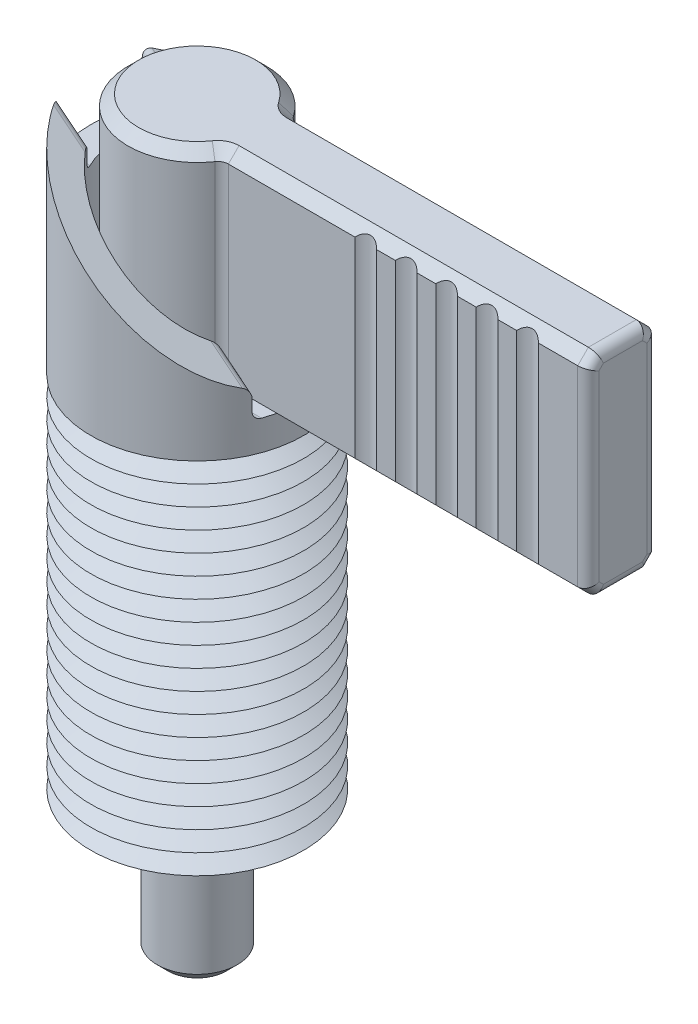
ISO-10303-21;
HEADER;
FILE_DESCRIPTION(('STEP AP214'),'2;1');
FILE_NAME('part.step','',(''),(''),'','','');
FILE_SCHEMA(('AUTOMOTIVE_DESIGN { 1 0 10303 214 1 1 1 1 }'));
ENDSEC;
DATA;
#1=APPLICATION_CONTEXT('core data for automotive mechanical design processes');
#2=APPLICATION_PROTOCOL_DEFINITION('international standard','automotive_design',2000,#1);
#3=PRODUCT_CONTEXT('',#1,'mechanical');
#4=PRODUCT('Part','Part','',(#3));
#5=PRODUCT_RELATED_PRODUCT_CATEGORY('part','',(#4));
#6=PRODUCT_DEFINITION_FORMATION('','',#4);
#7=PRODUCT_DEFINITION_CONTEXT('part definition',#1,'design');
#8=PRODUCT_DEFINITION('design','',#6,#7);
#9=PRODUCT_DEFINITION_SHAPE('','',#8);
#10=(LENGTH_UNIT() NAMED_UNIT(*) SI_UNIT(.MILLI.,.METRE.));
#11=(NAMED_UNIT(*) PLANE_ANGLE_UNIT() SI_UNIT($,.RADIAN.));
#12=(NAMED_UNIT(*) SI_UNIT($,.STERADIAN.) SOLID_ANGLE_UNIT());
#13=UNCERTAINTY_MEASURE_WITH_UNIT(LENGTH_MEASURE(1.E-05),#10,'distance_accuracy_value','');
#14=(GEOMETRIC_REPRESENTATION_CONTEXT(3) GLOBAL_UNCERTAINTY_ASSIGNED_CONTEXT((#13)) GLOBAL_UNIT_ASSIGNED_CONTEXT((#10,
#11,#12)) REPRESENTATION_CONTEXT('',''));
#15=CARTESIAN_POINT('',(0.,0.,0.));
#16=DIRECTION('',(0.,0.,1.));
#17=DIRECTION('',(1.,0.,0.));
#18=AXIS2_PLACEMENT_3D('',#15,#16,#17);
#19=CARTESIAN_POINT('',(4.50333209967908,2.01595551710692,2.6));
#20=DIRECTION('',(0.,0.,1.));
#21=DIRECTION('',(1.,0.,0.));
#22=AXIS2_PLACEMENT_3D('',#19,#20,#21);
#23=PLANE('',#22);
#24=DIRECTION('',(0.,1.,0.));
#25=VECTOR('',#24,1.);
#26=CARTESIAN_POINT('',(16.0792153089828,-9.99999999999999,2.6));
#27=LINE('',#26,#25);
#28=CARTESIAN_POINT('',(16.0792153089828,30.8008,2.6));
#29=VERTEX_POINT('',#28);
#30=CARTESIAN_POINT('',(16.0792153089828,45.1992,2.6));
#31=VERTEX_POINT('',#30);
#32=EDGE_CURVE('P0_E200',#29,#31,#27,.T.);
#33=ORIENTED_EDGE('',*,*,#32,.F.);
#34=DIRECTION('',(1.,0.,0.));
#35=VECTOR('',#34,1.);
#36=CARTESIAN_POINT('',(32.,30.8008,2.6));
#37=LINE('',#36,#35);
#38=CARTESIAN_POINT('',(17.4887846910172,30.8008,2.6));
#39=VERTEX_POINT('',#38);
#40=EDGE_CURVE('P0_E209',#29,#39,#37,.T.);
#41=ORIENTED_EDGE('',*,*,#40,.T.);
#42=DIRECTION('',(0.,1.,0.));
#43=VECTOR('',#42,1.);
#44=CARTESIAN_POINT('',(17.4887846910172,-9.99999999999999,2.6));
#45=LINE('',#44,#43);
#46=CARTESIAN_POINT('',(17.4887846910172,45.1992,2.6));
#47=VERTEX_POINT('',#46);
#48=EDGE_CURVE('P0_E210',#39,#47,#45,.T.);
#49=ORIENTED_EDGE('',*,*,#48,.T.);
#50=DIRECTION('',(-1.,0.,0.));
#51=VECTOR('',#50,1.);
#52=CARTESIAN_POINT('',(4.94410355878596,45.1992,2.6));
#53=LINE('',#52,#51);
#54=EDGE_CURVE('P0_E236',#47,#31,#53,.T.);
#55=ORIENTED_EDGE('',*,*,#54,.T.);
#56=EDGE_LOOP('',(#33,#41,#49,#55));
#57=FACE_BOUND('',#56,.T.);
#58=ADVANCED_FACE('P0_F16',(#57),#23,.T.);
#59=DIRECTION('',(0.,1.,0.));
#60=VECTOR('',#59,1.);
#61=CARTESIAN_POINT('',(19.1192153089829,-9.99999999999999,2.6));
#62=LINE('',#61,#60);
#63=CARTESIAN_POINT('',(19.1192153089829,30.8008,2.6));
#64=VERTEX_POINT('',#63);
#65=CARTESIAN_POINT('',(19.1192153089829,45.1992,2.6));
#66=VERTEX_POINT('',#65);
#67=EDGE_CURVE('P0_E299',#64,#66,#62,.T.);
#68=ORIENTED_EDGE('',*,*,#67,.F.);
#69=CARTESIAN_POINT('',(20.5287846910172,30.8008,2.6));
#70=VERTEX_POINT('',#69);
#71=EDGE_CURVE('P0_E221',#64,#70,#37,.T.);
#72=ORIENTED_EDGE('',*,*,#71,.T.);
#73=DIRECTION('',(0.,1.,0.));
#74=VECTOR('',#73,1.);
#75=CARTESIAN_POINT('',(20.5287846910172,-9.99999999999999,2.6));
#76=LINE('',#75,#74);
#77=CARTESIAN_POINT('',(20.5287846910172,45.1992,2.6));
#78=VERTEX_POINT('',#77);
#79=EDGE_CURVE('P0_E293',#70,#78,#76,.T.);
#80=ORIENTED_EDGE('',*,*,#79,.T.);
#81=EDGE_CURVE('P0_E239',#78,#66,#53,.T.);
#82=ORIENTED_EDGE('',*,*,#81,.T.);
#83=EDGE_LOOP('',(#68,#72,#80,#82));
#84=FACE_BOUND('',#83,.T.);
#85=ADVANCED_FACE('P0_F496',(#84),#23,.T.);
#86=DIRECTION('',(0.,1.,0.));
#87=VECTOR('',#86,1.);
#88=CARTESIAN_POINT('',(22.1592153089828,-9.99999999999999,2.6));
#89=LINE('',#88,#87);
#90=CARTESIAN_POINT('',(22.1592153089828,30.8008,2.6));
#91=VERTEX_POINT('',#90);
#92=CARTESIAN_POINT('',(22.1592153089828,45.1992,2.6));
#93=VERTEX_POINT('',#92);
#94=EDGE_CURVE('P0_E292',#91,#93,#89,.T.);
#95=ORIENTED_EDGE('',*,*,#94,.F.);
#96=CARTESIAN_POINT('',(23.5687846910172,30.8008,2.6));
#97=VERTEX_POINT('',#96);
#98=EDGE_CURVE('P0_E228',#91,#97,#37,.T.);
#99=ORIENTED_EDGE('',*,*,#98,.T.);
#100=DIRECTION('',(0.,1.,0.));
#101=VECTOR('',#100,1.);
#102=CARTESIAN_POINT('',(23.5687846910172,-9.99999999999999,2.6));
#103=LINE('',#102,#101);
#104=CARTESIAN_POINT('',(23.5687846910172,45.1992,2.6));
#105=VERTEX_POINT('',#104);
#106=EDGE_CURVE('P0_E286',#97,#105,#103,.T.);
#107=ORIENTED_EDGE('',*,*,#106,.T.);
#108=EDGE_CURVE('P0_E234',#105,#93,#53,.T.);
#109=ORIENTED_EDGE('',*,*,#108,.T.);
#110=EDGE_LOOP('',(#95,#99,#107,#109));
#111=FACE_BOUND('',#110,.T.);
#112=ADVANCED_FACE('P0_F324',(#111),#23,.T.);
#113=DIRECTION('',(0.,1.,0.));
#114=VECTOR('',#113,1.);
#115=CARTESIAN_POINT('',(25.1992153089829,-9.99999999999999,2.6));
#116=LINE('',#115,#114);
#117=CARTESIAN_POINT('',(25.1992153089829,30.8008,2.6));
#118=VERTEX_POINT('',#117);
#119=CARTESIAN_POINT('',(25.1992153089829,45.1992,2.6));
#120=VERTEX_POINT('',#119);
#121=EDGE_CURVE('P0_E285',#118,#120,#116,.T.);
#122=ORIENTED_EDGE('',*,*,#121,.F.);
#123=CARTESIAN_POINT('',(26.6087846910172,30.8008,2.6));
#124=VERTEX_POINT('',#123);
#125=EDGE_CURVE('P0_E223',#118,#124,#37,.T.);
#126=ORIENTED_EDGE('',*,*,#125,.T.);
#127=DIRECTION('',(0.,1.,0.));
#128=VECTOR('',#127,1.);
#129=CARTESIAN_POINT('',(26.6087846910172,-9.99999999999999,2.6));
#130=LINE('',#129,#128);
#131=CARTESIAN_POINT('',(26.6087846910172,45.1992,2.6));
#132=VERTEX_POINT('',#131);
#133=EDGE_CURVE('P0_E279',#124,#132,#130,.T.);
#134=ORIENTED_EDGE('',*,*,#133,.T.);
#135=EDGE_CURVE('P0_E229',#132,#120,#53,.T.);
#136=ORIENTED_EDGE('',*,*,#135,.T.);
#137=EDGE_LOOP('',(#122,#126,#134,#136));
#138=FACE_BOUND('',#137,.T.);
#139=ADVANCED_FACE('P0_F337',(#138),#23,.T.);
#140=CARTESIAN_POINT('',(28.2392153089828,30.8008,2.6));
#141=VERTEX_POINT('',#140);
#142=CARTESIAN_POINT('',(31.1992,30.8008,2.6));
#143=VERTEX_POINT('',#142);
#144=EDGE_CURVE('P0_E218',#141,#143,#37,.T.);
#145=ORIENTED_EDGE('',*,*,#144,.T.);
#146=DIRECTION('',(0.,1.,0.));
#147=VECTOR('',#146,1.);
#148=CARTESIAN_POINT('',(31.1992,2.01595551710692,2.6));
#149=LINE('',#148,#147);
#150=CARTESIAN_POINT('',(31.1992,45.1992,2.6));
#151=VERTEX_POINT('',#150);
#152=EDGE_CURVE('P0_E11',#143,#151,#149,.T.);
#153=ORIENTED_EDGE('',*,*,#152,.T.);
#154=CARTESIAN_POINT('',(28.2392153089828,45.1992,2.6));
#155=VERTEX_POINT('',#154);
#156=EDGE_CURVE('P0_E224',#151,#155,#53,.T.);
#157=ORIENTED_EDGE('',*,*,#156,.T.);
#158=DIRECTION('',(0.,1.,0.));
#159=VECTOR('',#158,1.);
#160=CARTESIAN_POINT('',(28.2392153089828,-9.99999999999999,2.6));
#161=LINE('',#160,#159);
#162=EDGE_CURVE('P0_E278',#141,#155,#161,.T.);
#163=ORIENTED_EDGE('',*,*,#162,.F.);
#164=EDGE_LOOP('',(#145,#153,#157,#163));
#165=FACE_BOUND('',#164,.T.);
#166=ADVANCED_FACE('P0_F506',(#165),#23,.T.);
#167=CARTESIAN_POINT('',(0.,-9.99999999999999,0.));
#168=DIRECTION('',(0.,1.,0.));
#169=DIRECTION('',(0.,0.,1.));
#170=AXIS2_PLACEMENT_3D('',#167,#168,#169);
#171=PLANE('',#170);
#172=CARTESIAN_POINT('',(0.,-9.99999999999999,0.));
#173=DIRECTION('',(0.,-1.,0.));
#174=DIRECTION('',(0.,0.,-1.));
#175=AXIS2_PLACEMENT_3D('',#172,#173,#174);
#176=CIRCLE('',#175,2.2);
#177=CARTESIAN_POINT('',(0.,-9.99999999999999,-2.2));
#178=VERTEX_POINT('',#177);
#179=EDGE_CURVE('P0_E259',#178,#178,#176,.T.);
#180=ORIENTED_EDGE('',*,*,#179,.T.);
#181=EDGE_LOOP('',(#180));
#182=FACE_BOUND('',#181,.T.);
#183=ADVANCED_FACE('P0_F516',(#182),#171,.F.);
#184=CARTESIAN_POINT('',(0.,-9.19999999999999,0.));
#185=DIRECTION('',(0.,1.,0.));
#186=DIRECTION('',(0.,0.,1.));
#187=AXIS2_PLACEMENT_3D('',#184,#185,#186);
#188=CONICAL_SURFACE('',#187,3.,0.785398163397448);
#189=ORIENTED_EDGE('',*,*,#179,.F.);
#190=EDGE_LOOP('',(#189));
#191=FACE_BOUND('',#190,.T.);
#192=CARTESIAN_POINT('',(0.,-9.19999999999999,0.));
#193=DIRECTION('',(0.,-1.,0.));
#194=DIRECTION('',(0.,0.,-1.));
#195=AXIS2_PLACEMENT_3D('',#192,#193,#194);
#196=CIRCLE('',#195,3.);
#197=CARTESIAN_POINT('',(0.,-9.19999999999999,-3.));
#198=VERTEX_POINT('',#197);
#199=EDGE_CURVE('P0_E262',#198,#198,#196,.T.);
#200=ORIENTED_EDGE('',*,*,#199,.T.);
#201=EDGE_LOOP('',(#200));
#202=FACE_BOUND('',#201,.T.);
#203=ADVANCED_FACE('P0_F521',(#191,#202),#188,.T.);
#204=CARTESIAN_POINT('',(0.,-9.99999999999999,0.));
#205=DIRECTION('',(0.,-1.,0.));
#206=DIRECTION('',(0.,0.,-1.));
#207=AXIS2_PLACEMENT_3D('',#204,#205,#206);
#208=CYLINDRICAL_SURFACE('',#207,3.);
#209=ORIENTED_EDGE('',*,*,#199,.F.);
#210=EDGE_LOOP('',(#209));
#211=FACE_BOUND('',#210,.T.);
#212=CARTESIAN_POINT('',(0.,7.50000000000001,0.));
#213=DIRECTION('',(0.,-1.,0.));
#214=DIRECTION('',(0.,0.,-1.));
#215=AXIS2_PLACEMENT_3D('',#212,#213,#214);
#216=CIRCLE('',#215,3.);
#217=CARTESIAN_POINT('',(0.,7.50000000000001,-3.));
#218=VERTEX_POINT('',#217);
#219=EDGE_CURVE('P0_E265',#218,#218,#216,.T.);
#220=ORIENTED_EDGE('',*,*,#219,.T.);
#221=EDGE_LOOP('',(#220));
#222=FACE_BOUND('',#221,.T.);
#223=ADVANCED_FACE('P0_F555',(#211,#222),#208,.T.);
#224=CARTESIAN_POINT('',(-3.,7.50000000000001,0.));
#225=DIRECTION('',(0.,-1.,0.));
#226=DIRECTION('',(0.,0.,-1.));
#227=AXIS2_PLACEMENT_3D('',#224,#225,#226);
#228=PLANE('',#227);
#229=ORIENTED_EDGE('',*,*,#219,.F.);
#230=EDGE_LOOP('',(#229));
#231=FACE_BOUND('',#230,.T.);
#232=CARTESIAN_POINT('',(0.,7.50000000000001,0.));
#233=DIRECTION('',(0.,-1.,0.));
#234=DIRECTION('',(0.,0.,-1.));
#235=AXIS2_PLACEMENT_3D('',#232,#233,#234);
#236=CIRCLE('',#235,2.25);
#237=CARTESIAN_POINT('',(0.,7.50000000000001,-2.25));
#238=VERTEX_POINT('',#237);
#239=EDGE_CURVE('P0_E268',#238,#238,#236,.T.);
#240=ORIENTED_EDGE('',*,*,#239,.T.);
#241=EDGE_LOOP('',(#240));
#242=FACE_BOUND('',#241,.T.);
#243=ADVANCED_FACE('P0_F563',(#231,#242),#228,.F.);
#244=CARTESIAN_POINT('',(0.,-9.99999999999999,0.));
#245=DIRECTION('',(0.,-1.,0.));
#246=DIRECTION('',(0.,0.,-1.));
#247=AXIS2_PLACEMENT_3D('',#244,#245,#246);
#248=CYLINDRICAL_SURFACE('',#247,2.25);
#249=ORIENTED_EDGE('',*,*,#239,.F.);
#250=EDGE_LOOP('',(#249));
#251=FACE_BOUND('',#250,.T.);
#252=CARTESIAN_POINT('',(0.,30.,0.));
#253=DIRECTION('',(0.,-1.,0.));
#254=DIRECTION('',(0.,0.,-1.));
#255=AXIS2_PLACEMENT_3D('',#252,#253,#254);
#256=CIRCLE('',#255,2.25);
#257=CARTESIAN_POINT('',(0.,30.,-2.25));
#258=VERTEX_POINT('',#257);
#259=EDGE_CURVE('P0_E271',#258,#258,#256,.T.);
#260=ORIENTED_EDGE('',*,*,#259,.T.);
#261=EDGE_LOOP('',(#260));
#262=FACE_BOUND('',#261,.T.);
#263=ADVANCED_FACE('P0_F571',(#251,#262),#248,.T.);
#264=CARTESIAN_POINT('',(-2.25,30.,0.));
#265=DIRECTION('',(0.,1.,0.));
#266=DIRECTION('',(0.,0.,1.));
#267=AXIS2_PLACEMENT_3D('',#264,#265,#266);
#268=PLANE('',#267);
#269=ORIENTED_EDGE('',*,*,#259,.F.);
#270=EDGE_LOOP('',(#269));
#271=FACE_BOUND('',#270,.T.);
#272=DIRECTION('',(1.,0.,0.));
#273=VECTOR('',#272,1.);
#274=CARTESIAN_POINT('',(32.,30.,-1.7992));
#275=LINE('',#274,#273);
#276=CARTESIAN_POINT('',(4.94410355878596,30.,-1.7992));
#277=VERTEX_POINT('',#276);
#278=CARTESIAN_POINT('',(31.1992,30.,-1.7992));
#279=VERTEX_POINT('',#278);
#280=EDGE_CURVE('P0_E247',#277,#279,#275,.T.);
#281=ORIENTED_EDGE('',*,*,#280,.T.);
#282=DIRECTION('',(0.,0.,1.));
#283=VECTOR('',#282,1.);
#284=CARTESIAN_POINT('',(31.1992,30.,1.79920000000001));
#285=LINE('',#284,#283);
#286=CARTESIAN_POINT('',(31.1992,30.,1.7992));
#287=VERTEX_POINT('',#286);
#288=EDGE_CURVE('P0_E40',#279,#287,#285,.T.);
#289=ORIENTED_EDGE('',*,*,#288,.T.);
#290=DIRECTION('',(-1.,0.,0.));
#291=VECTOR('',#290,1.);
#292=CARTESIAN_POINT('',(4.94410355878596,30.,1.7992));
#293=LINE('',#292,#291);
#294=CARTESIAN_POINT('',(4.94410355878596,30.,1.7992));
#295=VERTEX_POINT('',#294);
#296=EDGE_CURVE('P0_E237',#287,#295,#293,.T.);
#297=ORIENTED_EDGE('',*,*,#296,.T.);
#298=CARTESIAN_POINT('',(4.94410355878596,30.,3.4008));
#299=DIRECTION('',(0.,1.,0.));
#300=DIRECTION('',(0.,0.,1.));
#301=AXIS2_PLACEMENT_3D('',#298,#299,#300);
#302=CIRCLE('',#301,1.6016);
#303=CARTESIAN_POINT('',(3.62453345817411,30.,2.49313414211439));
#304=VERTEX_POINT('',#303);
#305=EDGE_CURVE('P0_E240',#295,#304,#302,.T.);
#306=ORIENTED_EDGE('',*,*,#305,.T.);
#307=CARTESIAN_POINT('',(0.,30.,0.));
#308=DIRECTION('',(0.,1.,0.));
#309=DIRECTION('',(0.,0.,1.));
#310=AXIS2_PLACEMENT_3D('',#307,#308,#309);
#311=CIRCLE('',#310,4.3992);
#312=CARTESIAN_POINT('',(3.62453345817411,30.,-2.49313414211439));
#313=VERTEX_POINT('',#312);
#314=EDGE_CURVE('P0_E241',#304,#313,#311,.F.);
#315=ORIENTED_EDGE('',*,*,#314,.T.);
#316=CARTESIAN_POINT('',(4.94410355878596,30.,-3.4008));
#317=DIRECTION('',(0.,1.,0.));
#318=DIRECTION('',(0.,0.,1.));
#319=AXIS2_PLACEMENT_3D('',#316,#317,#318);
#320=CIRCLE('',#319,1.6016);
#321=EDGE_CURVE('P0_E245',#313,#277,#320,.T.);
#322=ORIENTED_EDGE('',*,*,#321,.T.);
#323=EDGE_LOOP('',(#281,#289,#297,#306,#315,#322));
#324=FACE_BOUND('',#323,.T.);
#325=ADVANCED_FACE('P0_F422',(#271,#324),#268,.F.);
#326=CARTESIAN_POINT('',(0.,-9.99999999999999,0.));
#327=DIRECTION('',(0.,-1.,0.));
#328=DIRECTION('',(0.,0.,-1.));
#329=AXIS2_PLACEMENT_3D('',#326,#327,#328);
#330=CYLINDRICAL_SURFACE('',#329,5.2);
#331=DIRECTION('',(0.,-1.,0.));
#332=VECTOR('',#331,1.);
#333=CARTESIAN_POINT('',(4.28431850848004,-9.99999999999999,-2.94696707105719));
#334=LINE('',#333,#332);
#335=CARTESIAN_POINT('',(4.28431850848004,45.1992,-2.94696707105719));
#336=VERTEX_POINT('',#335);
#337=CARTESIAN_POINT('',(4.28431850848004,30.8008,-2.94696707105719));
#338=VERTEX_POINT('',#337);
#339=EDGE_CURVE('P0_E250',#336,#338,#334,.T.);
#340=ORIENTED_EDGE('',*,*,#339,.T.);
#341=CARTESIAN_POINT('',(0.,30.8008,0.));
#342=DIRECTION('',(0.,1.,0.));
#343=DIRECTION('',(0.,0.,1.));
#344=AXIS2_PLACEMENT_3D('',#341,#342,#343);
#345=CIRCLE('',#344,5.2);
#346=CARTESIAN_POINT('',(4.28431850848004,30.8008,2.94696707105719));
#347=VERTEX_POINT('',#346);
#348=EDGE_CURVE('P0_E436',#338,#347,#345,.T.);
#349=ORIENTED_EDGE('',*,*,#348,.T.);
#350=DIRECTION('',(0.,-1.,0.));
#351=VECTOR('',#350,1.);
#352=CARTESIAN_POINT('',(4.28431850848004,-9.99999999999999,2.94696707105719));
#353=LINE('',#352,#351);
#354=CARTESIAN_POINT('',(4.28431850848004,45.1992,2.94696707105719));
#355=VERTEX_POINT('',#354);
#356=EDGE_CURVE('P0_E253',#347,#355,#353,.F.);
#357=ORIENTED_EDGE('',*,*,#356,.T.);
#358=CARTESIAN_POINT('',(0.,45.1992,0.));
#359=DIRECTION('',(0.,-1.,0.));
#360=DIRECTION('',(0.,0.,-1.));
#361=AXIS2_PLACEMENT_3D('',#358,#359,#360);
#362=CIRCLE('',#361,5.2);
#363=EDGE_CURVE('P0_E476',#355,#336,#362,.T.);
#364=ORIENTED_EDGE('',*,*,#363,.T.);
#365=EDGE_LOOP('',(#340,#349,#357,#364));
#366=FACE_BOUND('',#365,.T.);
#367=ADVANCED_FACE('P0_F586',(#366),#330,.T.);
#368=CARTESIAN_POINT('',(-5.2,46.,0.));
#369=DIRECTION('',(0.,-1.,0.));
#370=DIRECTION('',(0.,0.,-1.));
#371=AXIS2_PLACEMENT_3D('',#368,#369,#370);
#372=PLANE('',#371);
#373=DIRECTION('',(1.,0.,0.));
#374=VECTOR('',#373,1.);
#375=CARTESIAN_POINT('',(32.,46.,1.7992));
#376=LINE('',#375,#374);
#377=CARTESIAN_POINT('',(4.94410355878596,46.,1.7992));
#378=VERTEX_POINT('',#377);
#379=CARTESIAN_POINT('',(31.1992,46.,1.7992));
#380=VERTEX_POINT('',#379);
#381=EDGE_CURVE('P0_E343',#378,#380,#376,.T.);
#382=ORIENTED_EDGE('',*,*,#381,.T.);
#383=DIRECTION('',(0.,0.,-1.));
#384=VECTOR('',#383,1.);
#385=CARTESIAN_POINT('',(31.1992,46.,-1.79919999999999));
#386=LINE('',#385,#384);
#387=CARTESIAN_POINT('',(31.1992,46.,-1.7992));
#388=VERTEX_POINT('',#387);
#389=EDGE_CURVE('P0_E375',#380,#388,#386,.T.);
#390=ORIENTED_EDGE('',*,*,#389,.T.);
#391=DIRECTION('',(-1.,0.,0.));
#392=VECTOR('',#391,1.);
#393=CARTESIAN_POINT('',(4.94410355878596,46.,-1.7992));
#394=LINE('',#393,#392);
#395=CARTESIAN_POINT('',(4.94410355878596,46.,-1.7992));
#396=VERTEX_POINT('',#395);
#397=EDGE_CURVE('P0_E465',#388,#396,#394,.T.);
#398=ORIENTED_EDGE('',*,*,#397,.T.);
#399=CARTESIAN_POINT('',(4.94410355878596,46.,-3.4008));
#400=DIRECTION('',(0.,-1.,0.));
#401=DIRECTION('',(0.,0.,-1.));
#402=AXIS2_PLACEMENT_3D('',#399,#400,#401);
#403=CIRCLE('',#402,1.6016);
#404=CARTESIAN_POINT('',(3.62453345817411,46.,-2.49313414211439));
#405=VERTEX_POINT('',#404);
#406=EDGE_CURVE('P0_E463',#396,#405,#403,.T.);
#407=ORIENTED_EDGE('',*,*,#406,.T.);
#408=CARTESIAN_POINT('',(0.,46.,0.));
#409=DIRECTION('',(0.,-1.,0.));
#410=DIRECTION('',(0.,0.,-1.));
#411=AXIS2_PLACEMENT_3D('',#408,#409,#410);
#412=CIRCLE('',#411,4.3992);
#413=CARTESIAN_POINT('',(3.62453345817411,46.,2.49313414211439));
#414=VERTEX_POINT('',#413);
#415=EDGE_CURVE('P0_E461',#405,#414,#412,.F.);
#416=ORIENTED_EDGE('',*,*,#415,.T.);
#417=CARTESIAN_POINT('',(4.94410355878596,46.,3.4008));
#418=DIRECTION('',(0.,-1.,0.));
#419=DIRECTION('',(0.,0.,-1.));
#420=AXIS2_PLACEMENT_3D('',#417,#418,#419);
#421=CIRCLE('',#420,1.6016);
#422=EDGE_CURVE('P0_E348',#414,#378,#421,.T.);
#423=ORIENTED_EDGE('',*,*,#422,.T.);
#424=EDGE_LOOP('',(#382,#390,#398,#407,#416,#423));
#425=FACE_BOUND('',#424,.T.);
#426=ADVANCED_FACE('P0_F594',(#425),#372,.F.);
#427=CARTESIAN_POINT('',(4.50333209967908,2.01595551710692,-2.6));
#428=DIRECTION('',(0.,0.,-1.));
#429=DIRECTION('',(-1.,0.,0.));
#430=AXIS2_PLACEMENT_3D('',#427,#428,#429);
#431=PLANE('',#430);
#432=DIRECTION('',(1.,0.,0.));
#433=VECTOR('',#432,1.);
#434=CARTESIAN_POINT('',(32.,45.1992,-2.6));
#435=LINE('',#434,#433);
#436=CARTESIAN_POINT('',(4.94410355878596,45.1992,-2.6));
#437=VERTEX_POINT('',#436);
#438=CARTESIAN_POINT('',(31.1992,45.1992,-2.6));
#439=VERTEX_POINT('',#438);
#440=EDGE_CURVE('P0_E468',#437,#439,#435,.T.);
#441=ORIENTED_EDGE('',*,*,#440,.T.);
#442=DIRECTION('',(0.,1.,0.));
#443=VECTOR('',#442,1.);
#444=CARTESIAN_POINT('',(31.1992,2.01595551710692,-2.6));
#445=LINE('',#444,#443);
#446=CARTESIAN_POINT('',(31.1992,30.8008,-2.6));
#447=VERTEX_POINT('',#446);
#448=EDGE_CURVE('P0_E379',#439,#447,#445,.F.);
#449=ORIENTED_EDGE('',*,*,#448,.T.);
#450=DIRECTION('',(-1.,0.,0.));
#451=VECTOR('',#450,1.);
#452=CARTESIAN_POINT('',(4.94410355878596,30.8008,-2.6));
#453=LINE('',#452,#451);
#454=CARTESIAN_POINT('',(4.94410355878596,30.8008,-2.6));
#455=VERTEX_POINT('',#454);
#456=EDGE_CURVE('P0_E421',#447,#455,#453,.T.);
#457=ORIENTED_EDGE('',*,*,#456,.T.);
#458=DIRECTION('',(0.,-1.,0.));
#459=VECTOR('',#458,1.);
#460=CARTESIAN_POINT('',(4.94410355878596,2.01595551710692,-2.6));
#461=LINE('',#460,#459);
#462=EDGE_CURVE('P0_E256',#455,#437,#461,.F.);
#463=ORIENTED_EDGE('',*,*,#462,.T.);
#464=EDGE_LOOP('',(#441,#449,#457,#463));
#465=FACE_BOUND('',#464,.T.);
#466=ADVANCED_FACE('P0_F513',(#465),#431,.T.);
#467=CARTESIAN_POINT('',(32.,2.01595551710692,2.6));
#468=DIRECTION('',(1.,0.,0.));
#469=DIRECTION('',(0.,0.,-1.));
#470=AXIS2_PLACEMENT_3D('',#467,#468,#469);
#471=PLANE('',#470);
#472=DIRECTION('',(0.,0.,-1.));
#473=VECTOR('',#472,1.);
#474=CARTESIAN_POINT('',(32.,45.1992,1.7992));
#475=LINE('',#474,#473);
#476=CARTESIAN_POINT('',(32.,45.1992,-1.46749777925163));
#477=VERTEX_POINT('',#476);
#478=CARTESIAN_POINT('',(32.,45.1992,1.46749777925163));
#479=VERTEX_POINT('',#478);
#480=EDGE_CURVE('P0_E367',#477,#479,#475,.F.);
#481=ORIENTED_EDGE('',*,*,#480,.T.);
#482=DIRECTION('',(0.,-0.707106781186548,0.707106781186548));
#483=VECTOR('',#482,1.);
#484=CARTESIAN_POINT('',(32.,23.0413266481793,23.6253711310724));
#485=LINE('',#484,#483);
#486=CARTESIAN_POINT('',(32.,44.8674977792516,1.7992));
#487=VERTEX_POINT('',#486);
#488=EDGE_CURVE('P0_E369',#479,#487,#485,.T.);
#489=ORIENTED_EDGE('',*,*,#488,.T.);
#490=DIRECTION('',(0.,1.,0.));
#491=VECTOR('',#490,1.);
#492=CARTESIAN_POINT('',(32.,2.01595551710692,1.7992));
#493=LINE('',#492,#491);
#494=CARTESIAN_POINT('',(32.,31.1325022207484,1.7992));
#495=VERTEX_POINT('',#494);
#496=EDGE_CURVE('P0_E309',#487,#495,#493,.F.);
#497=ORIENTED_EDGE('',*,*,#496,.T.);
#498=DIRECTION('',(0.,-0.707106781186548,-0.707106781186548));
#499=VECTOR('',#498,1.);
#500=CARTESIAN_POINT('',(32.,16.9746288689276,-12.3586733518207));
#501=LINE('',#500,#499);
#502=CARTESIAN_POINT('',(32.,30.8008,1.46749777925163));
#503=VERTEX_POINT('',#502);
#504=EDGE_CURVE('P0_E357',#495,#503,#501,.T.);
#505=ORIENTED_EDGE('',*,*,#504,.T.);
#506=DIRECTION('',(0.,0.,1.));
#507=VECTOR('',#506,1.);
#508=CARTESIAN_POINT('',(32.,30.8008,-1.7992));
#509=LINE('',#508,#507);
#510=CARTESIAN_POINT('',(32.,30.8008,-1.46749777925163));
#511=VERTEX_POINT('',#510);
#512=EDGE_CURVE('P0_E359',#503,#511,#509,.F.);
#513=ORIENTED_EDGE('',*,*,#512,.T.);
#514=DIRECTION('',(0.,0.707106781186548,-0.707106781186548));
#515=VECTOR('',#514,1.);
#516=CARTESIAN_POINT('',(32.,14.3746288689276,14.9586733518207));
#517=LINE('',#516,#515);
#518=CARTESIAN_POINT('',(32.,31.1325022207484,-1.7992));
#519=VERTEX_POINT('',#518);
#520=EDGE_CURVE('P0_E361',#511,#519,#517,.T.);
#521=ORIENTED_EDGE('',*,*,#520,.T.);
#522=DIRECTION('',(0.,1.,0.));
#523=VECTOR('',#522,1.);
#524=CARTESIAN_POINT('',(32.,2.01595551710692,-1.7992));
#525=LINE('',#524,#523);
#526=CARTESIAN_POINT('',(32.,44.8674977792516,-1.7992));
#527=VERTEX_POINT('',#526);
#528=EDGE_CURVE('P0_E363',#519,#527,#525,.T.);
#529=ORIENTED_EDGE('',*,*,#528,.T.);
#530=DIRECTION('',(0.,0.707106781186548,0.707106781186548));
#531=VECTOR('',#530,1.);
#532=CARTESIAN_POINT('',(32.,25.6413266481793,-21.0253711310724));
#533=LINE('',#532,#531);
#534=EDGE_CURVE('P0_E365',#527,#477,#533,.T.);
#535=ORIENTED_EDGE('',*,*,#534,.T.);
#536=EDGE_LOOP('',(#481,#489,#497,#505,#513,#521,#529,#535));
#537=FACE_BOUND('',#536,.T.);
#538=ADVANCED_FACE('P0_F505',(#537),#471,.T.);
#539=DIRECTION('',(0.,1.,0.));
#540=VECTOR('',#539,1.);
#541=CARTESIAN_POINT('',(14.4487846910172,-9.99999999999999,2.6));
#542=LINE('',#541,#540);
#543=CARTESIAN_POINT('',(14.4487846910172,30.8008,2.6));
#544=VERTEX_POINT('',#543);
#545=CARTESIAN_POINT('',(14.4487846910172,45.1992,2.6));
#546=VERTEX_POINT('',#545);
#547=EDGE_CURVE('P0_E190',#544,#546,#542,.T.);
#548=ORIENTED_EDGE('',*,*,#547,.T.);
#549=CARTESIAN_POINT('',(4.94410355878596,45.1992,2.6));
#550=VERTEX_POINT('',#549);
#551=EDGE_CURVE('P0_E230',#546,#550,#53,.T.);
#552=ORIENTED_EDGE('',*,*,#551,.T.);
#553=DIRECTION('',(0.,-1.,0.));
#554=VECTOR('',#553,1.);
#555=CARTESIAN_POINT('',(4.94410355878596,2.01595551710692,2.6));
#556=LINE('',#555,#554);
#557=CARTESIAN_POINT('',(4.94410355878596,30.8008,2.6));
#558=VERTEX_POINT('',#557);
#559=EDGE_CURVE('P0_E215',#550,#558,#556,.T.);
#560=ORIENTED_EDGE('',*,*,#559,.T.);
#561=EDGE_CURVE('P0_E206',#558,#544,#37,.T.);
#562=ORIENTED_EDGE('',*,*,#561,.T.);
#563=EDGE_LOOP('',(#548,#552,#560,#562));
#564=FACE_BOUND('',#563,.T.);
#565=ADVANCED_FACE('P0_F213',(#564),#23,.T.);
#566=CARTESIAN_POINT('',(4.94410355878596,-9.99999999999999,-3.4008));
#567=DIRECTION('',(0.,-1.,0.));
#568=DIRECTION('',(0.,0.,-1.));
#569=AXIS2_PLACEMENT_3D('',#566,#567,#568);
#570=CYLINDRICAL_SURFACE('',#569,0.8008);
#571=ORIENTED_EDGE('',*,*,#462,.F.);
#572=CARTESIAN_POINT('',(4.94410355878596,30.8008,-3.4008));
#573=DIRECTION('',(0.,1.,0.));
#574=DIRECTION('',(0.,0.,1.));
#575=AXIS2_PLACEMENT_3D('',#572,#573,#574);
#576=CIRCLE('',#575,0.8008);
#577=EDGE_CURVE('P0_E471',#455,#338,#576,.F.);
#578=ORIENTED_EDGE('',*,*,#577,.T.);
#579=ORIENTED_EDGE('',*,*,#339,.F.);
#580=CARTESIAN_POINT('',(4.94410355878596,45.1992,-3.4008));
#581=DIRECTION('',(0.,-1.,0.));
#582=DIRECTION('',(0.,0.,-1.));
#583=AXIS2_PLACEMENT_3D('',#580,#581,#582);
#584=CIRCLE('',#583,0.8008);
#585=EDGE_CURVE('P0_E473',#336,#437,#584,.F.);
#586=ORIENTED_EDGE('',*,*,#585,.T.);
#587=EDGE_LOOP('',(#571,#578,#579,#586));
#588=FACE_BOUND('',#587,.T.);
#589=ADVANCED_FACE('P0_F504',(#588),#570,.F.);
#590=CARTESIAN_POINT('',(4.94410355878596,-9.99999999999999,3.4008));
#591=DIRECTION('',(0.,-1.,0.));
#592=DIRECTION('',(0.,0.,-1.));
#593=AXIS2_PLACEMENT_3D('',#590,#591,#592);
#594=CYLINDRICAL_SURFACE('',#593,0.8008);
#595=ORIENTED_EDGE('',*,*,#356,.F.);
#596=CARTESIAN_POINT('',(4.94410355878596,30.8008,3.4008));
#597=DIRECTION('',(0.,1.,0.));
#598=DIRECTION('',(0.,0.,1.));
#599=AXIS2_PLACEMENT_3D('',#596,#597,#598);
#600=CIRCLE('',#599,0.8008);
#601=EDGE_CURVE('P0_E219',#347,#558,#600,.F.);
#602=ORIENTED_EDGE('',*,*,#601,.T.);
#603=ORIENTED_EDGE('',*,*,#559,.F.);
#604=CARTESIAN_POINT('',(4.94410355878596,45.1992,3.4008));
#605=DIRECTION('',(0.,-1.,0.));
#606=DIRECTION('',(0.,0.,-1.));
#607=AXIS2_PLACEMENT_3D('',#604,#605,#606);
#608=CIRCLE('',#607,0.8008);
#609=EDGE_CURVE('P0_E216',#550,#355,#608,.F.);
#610=ORIENTED_EDGE('',*,*,#609,.T.);
#611=EDGE_LOOP('',(#595,#602,#603,#610));
#612=FACE_BOUND('',#611,.T.);
#613=ADVANCED_FACE('P0_F481',(#612),#594,.F.);
#614=CARTESIAN_POINT('',(-2.25,30.,-1.7992));
#615=DIRECTION('',(0.,-0.707106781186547,-0.707106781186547));
#616=DIRECTION('',(0.,0.707106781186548,-0.707106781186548));
#617=AXIS2_PLACEMENT_3D('',#614,#615,#616);
#618=PLANE('',#617);
#619=ORIENTED_EDGE('',*,*,#456,.F.);
#620=DIRECTION('',(0.,0.707106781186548,-0.707106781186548));
#621=VECTOR('',#620,1.);
#622=CARTESIAN_POINT('',(31.1992,30.,-1.7992));
#623=LINE('',#622,#621);
#624=EDGE_CURVE('P0_E381',#447,#279,#623,.F.);
#625=ORIENTED_EDGE('',*,*,#624,.T.);
#626=ORIENTED_EDGE('',*,*,#280,.F.);
#627=DIRECTION('',(0.,-0.707106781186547,0.707106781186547));
#628=VECTOR('',#627,1.);
#629=CARTESIAN_POINT('',(4.94410355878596,30.8008,-2.6));
#630=LINE('',#629,#628);
#631=EDGE_CURVE('P0_E274',#455,#277,#630,.T.);
#632=ORIENTED_EDGE('',*,*,#631,.F.);
#633=EDGE_LOOP('',(#619,#625,#626,#632));
#634=FACE_BOUND('',#633,.T.);
#635=ADVANCED_FACE('P0_F418',(#634),#618,.T.);
#636=CARTESIAN_POINT('',(4.94410355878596,30.,-3.4008));
#637=DIRECTION('',(0.,-1.,0.));
#638=DIRECTION('',(0.,0.,-1.));
#639=AXIS2_PLACEMENT_3D('',#636,#637,#638);
#640=CONICAL_SURFACE('',#639,1.6016,0.785398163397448);
#641=ORIENTED_EDGE('',*,*,#631,.T.);
#642=ORIENTED_EDGE('',*,*,#321,.F.);
#643=DIRECTION('',(-0.582590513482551,-0.707106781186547,0.400734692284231));
#644=VECTOR('',#643,1.);
#645=CARTESIAN_POINT('',(4.28431850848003,30.8008,-2.94696707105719));
#646=LINE('',#645,#644);
#647=EDGE_CURVE('P0_E430',#338,#313,#646,.T.);
#648=ORIENTED_EDGE('',*,*,#647,.F.);
#649=ORIENTED_EDGE('',*,*,#577,.F.);
#650=EDGE_LOOP('',(#641,#642,#648,#649));
#651=FACE_BOUND('',#650,.T.);
#652=ADVANCED_FACE('P0_F428',(#651),#640,.F.);
#653=CARTESIAN_POINT('',(0.,30.,0.));
#654=DIRECTION('',(0.,1.,0.));
#655=DIRECTION('',(0.,0.,1.));
#656=AXIS2_PLACEMENT_3D('',#653,#654,#655);
#657=CONICAL_SURFACE('',#656,4.3992,0.785398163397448);
#658=ORIENTED_EDGE('',*,*,#647,.T.);
#659=ORIENTED_EDGE('',*,*,#314,.F.);
#660=DIRECTION('',(-0.582590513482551,-0.707106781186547,-0.400734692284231));
#661=VECTOR('',#660,1.);
#662=CARTESIAN_POINT('',(4.28431850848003,30.8008,2.94696707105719));
#663=LINE('',#662,#661);
#664=EDGE_CURVE('P0_E437',#347,#304,#663,.T.);
#665=ORIENTED_EDGE('',*,*,#664,.F.);
#666=ORIENTED_EDGE('',*,*,#348,.F.);
#667=EDGE_LOOP('',(#658,#659,#665,#666));
#668=FACE_BOUND('',#667,.T.);
#669=ADVANCED_FACE('P0_F433',(#668),#657,.T.);
#670=CARTESIAN_POINT('',(4.94410355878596,30.,3.4008));
#671=DIRECTION('',(0.,-1.,0.));
#672=DIRECTION('',(0.,0.,-1.));
#673=AXIS2_PLACEMENT_3D('',#670,#671,#672);
#674=CONICAL_SURFACE('',#673,1.6016,0.785398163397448);
#675=ORIENTED_EDGE('',*,*,#664,.T.);
#676=ORIENTED_EDGE('',*,*,#305,.F.);
#677=DIRECTION('',(0.,-0.707106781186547,-0.707106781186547));
#678=VECTOR('',#677,1.);
#679=CARTESIAN_POINT('',(4.94410355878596,30.8008,2.6));
#680=LINE('',#679,#678);
#681=EDGE_CURVE('P0_E440',#558,#295,#680,.T.);
#682=ORIENTED_EDGE('',*,*,#681,.F.);
#683=ORIENTED_EDGE('',*,*,#601,.F.);
#684=EDGE_LOOP('',(#675,#676,#682,#683));
#685=FACE_BOUND('',#684,.T.);
#686=ADVANCED_FACE('P0_F484',(#685),#674,.F.);
#687=CARTESIAN_POINT('',(-2.25,30.,1.7992));
#688=DIRECTION('',(0.,-0.707106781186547,0.707106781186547));
#689=DIRECTION('',(0.,-0.707106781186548,-0.707106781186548));
#690=AXIS2_PLACEMENT_3D('',#687,#688,#689);
#691=PLANE('',#690);
#692=ORIENTED_EDGE('',*,*,#296,.F.);
#693=DIRECTION('',(0.,-0.707106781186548,-0.707106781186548));
#694=VECTOR('',#693,1.);
#695=CARTESIAN_POINT('',(31.1992,30.,1.7992));
#696=LINE('',#695,#694);
#697=EDGE_CURVE('P0_E25',#287,#143,#696,.F.);
#698=ORIENTED_EDGE('',*,*,#697,.T.);
#699=ORIENTED_EDGE('',*,*,#144,.F.);
#700=CARTESIAN_POINT('',(27.424,31.5688,3.368));
#701=DIRECTION('',(0.,-0.707106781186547,0.707106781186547));
#702=DIRECTION('',(0.,0.707106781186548,0.707106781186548));
#703=AXIS2_PLACEMENT_3D('',#700,#701,#702);
#704=ELLIPSE('',#703,1.58391918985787,1.12);
#705=EDGE_CURVE('P0_E275',#124,#141,#704,.T.);
#706=ORIENTED_EDGE('',*,*,#705,.F.);
#707=ORIENTED_EDGE('',*,*,#125,.F.);
#708=CARTESIAN_POINT('',(24.384,31.5688,3.368));
#709=DIRECTION('',(0.,-0.707106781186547,0.707106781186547));
#710=DIRECTION('',(0.,0.707106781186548,0.707106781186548));
#711=AXIS2_PLACEMENT_3D('',#708,#709,#710);
#712=ELLIPSE('',#711,1.58391918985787,1.12);
#713=EDGE_CURVE('P0_E282',#97,#118,#712,.T.);
#714=ORIENTED_EDGE('',*,*,#713,.F.);
#715=ORIENTED_EDGE('',*,*,#98,.F.);
#716=CARTESIAN_POINT('',(21.344,31.5688,3.368));
#717=DIRECTION('',(0.,-0.707106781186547,0.707106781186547));
#718=DIRECTION('',(0.,0.707106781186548,0.707106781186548));
#719=AXIS2_PLACEMENT_3D('',#716,#717,#718);
#720=ELLIPSE('',#719,1.58391918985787,1.12);
#721=EDGE_CURVE('P0_E289',#70,#91,#720,.T.);
#722=ORIENTED_EDGE('',*,*,#721,.F.);
#723=ORIENTED_EDGE('',*,*,#71,.F.);
#724=CARTESIAN_POINT('',(18.304,31.5688,3.368));
#725=DIRECTION('',(0.,-0.707106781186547,0.707106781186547));
#726=DIRECTION('',(0.,0.707106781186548,0.707106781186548));
#727=AXIS2_PLACEMENT_3D('',#724,#725,#726);
#728=ELLIPSE('',#727,1.58391918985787,1.12);
#729=EDGE_CURVE('P0_E296',#39,#64,#728,.T.);
#730=ORIENTED_EDGE('',*,*,#729,.F.);
#731=ORIENTED_EDGE('',*,*,#40,.F.);
#732=CARTESIAN_POINT('',(15.264,31.5688,3.368));
#733=DIRECTION('',(0.,-0.707106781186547,0.707106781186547));
#734=DIRECTION('',(0.,0.707106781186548,0.707106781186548));
#735=AXIS2_PLACEMENT_3D('',#732,#733,#734);
#736=ELLIPSE('',#735,1.58391918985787,1.12);
#737=EDGE_CURVE('P0_E193',#544,#29,#736,.T.);
#738=ORIENTED_EDGE('',*,*,#737,.F.);
#739=ORIENTED_EDGE('',*,*,#561,.F.);
#740=ORIENTED_EDGE('',*,*,#681,.T.);
#741=EDGE_LOOP('',(#692,#698,#699,#706,#707,#714,#715,#722,#723,#730,#731,#738,#739,#740));
#742=FACE_BOUND('',#741,.T.);
#743=ADVANCED_FACE('P0_F204',(#742),#691,.T.);
#744=CARTESIAN_POINT('',(-5.2,46.,-1.7992));
#745=DIRECTION('',(0.,0.707106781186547,-0.707106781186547));
#746=DIRECTION('',(0.,0.707106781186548,0.707106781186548));
#747=AXIS2_PLACEMENT_3D('',#744,#745,#746);
#748=PLANE('',#747);
#749=ORIENTED_EDGE('',*,*,#397,.F.);
#750=DIRECTION('',(0.,0.707106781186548,0.707106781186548));
#751=VECTOR('',#750,1.);
#752=CARTESIAN_POINT('',(31.1992,46.,-1.7992));
#753=LINE('',#752,#751);
#754=EDGE_CURVE('P0_E377',#388,#439,#753,.F.);
#755=ORIENTED_EDGE('',*,*,#754,.T.);
#756=ORIENTED_EDGE('',*,*,#440,.F.);
#757=DIRECTION('',(0.,-0.707106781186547,-0.707106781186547));
#758=VECTOR('',#757,1.);
#759=CARTESIAN_POINT('',(4.94410355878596,46.,-1.7992));
#760=LINE('',#759,#758);
#761=EDGE_CURVE('P0_E351',#396,#437,#760,.T.);
#762=ORIENTED_EDGE('',*,*,#761,.F.);
#763=EDGE_LOOP('',(#749,#755,#756,#762));
#764=FACE_BOUND('',#763,.T.);
#765=ADVANCED_FACE('P0_F492',(#764),#748,.T.);
#766=CARTESIAN_POINT('',(4.94410355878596,46.,-3.4008));
#767=DIRECTION('',(0.,1.,0.));
#768=DIRECTION('',(0.,0.,1.));
#769=AXIS2_PLACEMENT_3D('',#766,#767,#768);
#770=CONICAL_SURFACE('',#769,1.6016,0.785398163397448);
#771=ORIENTED_EDGE('',*,*,#761,.T.);
#772=ORIENTED_EDGE('',*,*,#585,.F.);
#773=DIRECTION('',(0.582590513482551,-0.707106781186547,-0.400734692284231));
#774=VECTOR('',#773,1.);
#775=CARTESIAN_POINT('',(3.62453345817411,46.,-2.49313414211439));
#776=LINE('',#775,#774);
#777=EDGE_CURVE('P0_E447',#405,#336,#776,.T.);
#778=ORIENTED_EDGE('',*,*,#777,.F.);
#779=ORIENTED_EDGE('',*,*,#406,.F.);
#780=EDGE_LOOP('',(#771,#772,#778,#779));
#781=FACE_BOUND('',#780,.T.);
#782=ADVANCED_FACE('P0_F653',(#781),#770,.F.);
#783=CARTESIAN_POINT('',(0.,45.1992,0.));
#784=DIRECTION('',(0.,-1.,0.));
#785=DIRECTION('',(0.,0.,-1.));
#786=AXIS2_PLACEMENT_3D('',#783,#784,#785);
#787=CONICAL_SURFACE('',#786,5.2,0.785398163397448);
#788=ORIENTED_EDGE('',*,*,#777,.T.);
#789=ORIENTED_EDGE('',*,*,#363,.F.);
#790=DIRECTION('',(0.582590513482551,-0.707106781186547,0.400734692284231));
#791=VECTOR('',#790,1.);
#792=CARTESIAN_POINT('',(3.62453345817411,46.,2.49313414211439));
#793=LINE('',#792,#791);
#794=EDGE_CURVE('P0_E445',#414,#355,#793,.T.);
#795=ORIENTED_EDGE('',*,*,#794,.F.);
#796=ORIENTED_EDGE('',*,*,#415,.F.);
#797=EDGE_LOOP('',(#788,#789,#795,#796));
#798=FACE_BOUND('',#797,.T.);
#799=ADVANCED_FACE('P0_F661',(#798),#787,.T.);
#800=CARTESIAN_POINT('',(4.94410355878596,46.,3.4008));
#801=DIRECTION('',(0.,1.,0.));
#802=DIRECTION('',(0.,0.,1.));
#803=AXIS2_PLACEMENT_3D('',#800,#801,#802);
#804=CONICAL_SURFACE('',#803,1.6016,0.785398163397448);
#805=ORIENTED_EDGE('',*,*,#794,.T.);
#806=ORIENTED_EDGE('',*,*,#609,.F.);
#807=DIRECTION('',(0.,-0.707106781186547,0.707106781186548));
#808=VECTOR('',#807,1.);
#809=CARTESIAN_POINT('',(4.94410355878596,46.,1.7992));
#810=LINE('',#809,#808);
#811=EDGE_CURVE('P0_E277',#378,#550,#810,.T.);
#812=ORIENTED_EDGE('',*,*,#811,.F.);
#813=ORIENTED_EDGE('',*,*,#422,.F.);
#814=EDGE_LOOP('',(#805,#806,#812,#813));
#815=FACE_BOUND('',#814,.T.);
#816=ADVANCED_FACE('P0_F668',(#815),#804,.F.);
#817=CARTESIAN_POINT('',(-5.2,46.,1.7992));
#818=DIRECTION('',(0.,0.707106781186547,0.707106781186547));
#819=DIRECTION('',(0.,-0.707106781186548,0.707106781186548));
#820=AXIS2_PLACEMENT_3D('',#817,#818,#819);
#821=PLANE('',#820);
#822=ORIENTED_EDGE('',*,*,#156,.F.);
#823=DIRECTION('',(0.,-0.707106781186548,0.707106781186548));
#824=VECTOR('',#823,1.);
#825=CARTESIAN_POINT('',(31.1992,46.,1.7992));
#826=LINE('',#825,#824);
#827=EDGE_CURVE('P0_E372',#151,#380,#826,.F.);
#828=ORIENTED_EDGE('',*,*,#827,.T.);
#829=ORIENTED_EDGE('',*,*,#381,.F.);
#830=ORIENTED_EDGE('',*,*,#811,.T.);
#831=ORIENTED_EDGE('',*,*,#551,.F.);
#832=CARTESIAN_POINT('',(15.264,44.4312,3.368));
#833=DIRECTION('',(0.,0.707106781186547,0.707106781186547));
#834=DIRECTION('',(0.,0.707106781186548,-0.707106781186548));
#835=AXIS2_PLACEMENT_3D('',#832,#833,#834);
#836=ELLIPSE('',#835,1.58391918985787,1.12);
#837=EDGE_CURVE('P0_E196',#31,#546,#836,.T.);
#838=ORIENTED_EDGE('',*,*,#837,.F.);
#839=ORIENTED_EDGE('',*,*,#54,.F.);
#840=CARTESIAN_POINT('',(18.304,44.4312,3.368));
#841=DIRECTION('',(0.,0.707106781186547,0.707106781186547));
#842=DIRECTION('',(0.,0.707106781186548,-0.707106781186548));
#843=AXIS2_PLACEMENT_3D('',#840,#841,#842);
#844=ELLIPSE('',#843,1.58391918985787,1.12);
#845=EDGE_CURVE('P0_E310',#66,#47,#844,.T.);
#846=ORIENTED_EDGE('',*,*,#845,.F.);
#847=ORIENTED_EDGE('',*,*,#81,.F.);
#848=CARTESIAN_POINT('',(21.344,44.4312,3.368));
#849=DIRECTION('',(0.,0.707106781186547,0.707106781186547));
#850=DIRECTION('',(0.,0.707106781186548,-0.707106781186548));
#851=AXIS2_PLACEMENT_3D('',#848,#849,#850);
#852=ELLIPSE('',#851,1.58391918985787,1.12);
#853=EDGE_CURVE('P0_E345',#93,#78,#852,.T.);
#854=ORIENTED_EDGE('',*,*,#853,.F.);
#855=ORIENTED_EDGE('',*,*,#108,.F.);
#856=CARTESIAN_POINT('',(24.384,44.4312,3.368));
#857=DIRECTION('',(0.,0.707106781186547,0.707106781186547));
#858=DIRECTION('',(0.,0.707106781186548,-0.707106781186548));
#859=AXIS2_PLACEMENT_3D('',#856,#857,#858);
#860=ELLIPSE('',#859,1.58391918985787,1.12);
#861=EDGE_CURVE('P0_E332',#120,#105,#860,.T.);
#862=ORIENTED_EDGE('',*,*,#861,.F.);
#863=ORIENTED_EDGE('',*,*,#135,.F.);
#864=CARTESIAN_POINT('',(27.424,44.4312,3.368));
#865=DIRECTION('',(0.,0.707106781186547,0.707106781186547));
#866=DIRECTION('',(0.,0.707106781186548,-0.707106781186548));
#867=AXIS2_PLACEMENT_3D('',#864,#865,#866);
#868=ELLIPSE('',#867,1.58391918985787,1.12);
#869=EDGE_CURVE('P0_E342',#155,#132,#868,.T.);
#870=ORIENTED_EDGE('',*,*,#869,.F.);
#871=EDGE_LOOP('',(#822,#828,#829,#830,#831,#838,#839,#846,#847,#854,#855,#862,#863,#870));
#872=FACE_BOUND('',#871,.T.);
#873=ADVANCED_FACE('P0_F306',(#872),#821,.T.);
#874=CARTESIAN_POINT('',(27.424,-9.99999999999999,3.368));
#875=DIRECTION('',(0.,1.,0.));
#876=DIRECTION('',(0.,0.,1.));
#877=AXIS2_PLACEMENT_3D('',#874,#875,#876);
#878=CYLINDRICAL_SURFACE('',#877,1.12);
#879=ORIENTED_EDGE('',*,*,#705,.T.);
#880=ORIENTED_EDGE('',*,*,#162,.T.);
#881=ORIENTED_EDGE('',*,*,#869,.T.);
#882=ORIENTED_EDGE('',*,*,#133,.F.);
#883=EDGE_LOOP('',(#879,#880,#881,#882));
#884=FACE_BOUND('',#883,.T.);
#885=ADVANCED_FACE('P0_F340',(#884),#878,.F.);
#886=CARTESIAN_POINT('',(24.384,-9.99999999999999,3.368));
#887=DIRECTION('',(0.,1.,0.));
#888=DIRECTION('',(0.,0.,1.));
#889=AXIS2_PLACEMENT_3D('',#886,#887,#888);
#890=CYLINDRICAL_SURFACE('',#889,1.12);
#891=ORIENTED_EDGE('',*,*,#713,.T.);
#892=ORIENTED_EDGE('',*,*,#121,.T.);
#893=ORIENTED_EDGE('',*,*,#861,.T.);
#894=ORIENTED_EDGE('',*,*,#106,.F.);
#895=EDGE_LOOP('',(#891,#892,#893,#894));
#896=FACE_BOUND('',#895,.T.);
#897=ADVANCED_FACE('P0_F329',(#896),#890,.F.);
#898=CARTESIAN_POINT('',(21.344,-9.99999999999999,3.368));
#899=DIRECTION('',(0.,1.,0.));
#900=DIRECTION('',(0.,0.,1.));
#901=AXIS2_PLACEMENT_3D('',#898,#899,#900);
#902=CYLINDRICAL_SURFACE('',#901,1.12);
#903=ORIENTED_EDGE('',*,*,#721,.T.);
#904=ORIENTED_EDGE('',*,*,#94,.T.);
#905=ORIENTED_EDGE('',*,*,#853,.T.);
#906=ORIENTED_EDGE('',*,*,#79,.F.);
#907=EDGE_LOOP('',(#903,#904,#905,#906));
#908=FACE_BOUND('',#907,.T.);
#909=ADVANCED_FACE('P0_F694',(#908),#902,.F.);
#910=CARTESIAN_POINT('',(18.304,-9.99999999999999,3.368));
#911=DIRECTION('',(0.,1.,0.));
#912=DIRECTION('',(0.,0.,1.));
#913=AXIS2_PLACEMENT_3D('',#910,#911,#912);
#914=CYLINDRICAL_SURFACE('',#913,1.12);
#915=ORIENTED_EDGE('',*,*,#729,.T.);
#916=ORIENTED_EDGE('',*,*,#67,.T.);
#917=ORIENTED_EDGE('',*,*,#845,.T.);
#918=ORIENTED_EDGE('',*,*,#48,.F.);
#919=EDGE_LOOP('',(#915,#916,#917,#918));
#920=FACE_BOUND('',#919,.T.);
#921=ADVANCED_FACE('P0_F314',(#920),#914,.F.);
#922=CARTESIAN_POINT('',(15.264,-9.99999999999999,3.368));
#923=DIRECTION('',(0.,1.,0.));
#924=DIRECTION('',(0.,0.,1.));
#925=AXIS2_PLACEMENT_3D('',#922,#923,#924);
#926=CYLINDRICAL_SURFACE('',#925,1.12);
#927=ORIENTED_EDGE('',*,*,#737,.T.);
#928=ORIENTED_EDGE('',*,*,#32,.T.);
#929=ORIENTED_EDGE('',*,*,#837,.T.);
#930=ORIENTED_EDGE('',*,*,#547,.F.);
#931=EDGE_LOOP('',(#927,#928,#929,#930));
#932=FACE_BOUND('',#931,.T.);
#933=ADVANCED_FACE('P0_F192',(#932),#926,.F.);
#934=CARTESIAN_POINT('',(31.1992,14.3746288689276,14.9586733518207));
#935=DIRECTION('',(0.,0.707106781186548,-0.707106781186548));
#936=DIRECTION('',(0.,0.707106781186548,0.707106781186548));
#937=AXIS2_PLACEMENT_3D('',#934,#935,#936);
#938=CYLINDRICAL_SURFACE('',#937,0.8008);
#939=CARTESIAN_POINT('',(31.1992,30.8008,-1.46749777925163));
#940=DIRECTION('',(0.,0.38268343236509,-0.923879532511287));
#941=DIRECTION('',(0.,-0.923879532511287,-0.38268343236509));
#942=AXIS2_PLACEMENT_3D('',#939,#940,#941);
#943=ELLIPSE('',#942,0.866779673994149,0.8008);
#944=EDGE_CURVE('P0_E400',#279,#511,#943,.F.);
#945=ORIENTED_EDGE('',*,*,#944,.F.);
#946=ORIENTED_EDGE('',*,*,#624,.F.);
#947=CARTESIAN_POINT('',(31.1992,31.1325022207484,-1.7992));
#948=DIRECTION('',(0.,0.923879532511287,-0.38268343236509));
#949=DIRECTION('',(0.,-0.38268343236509,-0.923879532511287));
#950=AXIS2_PLACEMENT_3D('',#947,#948,#949);
#951=ELLIPSE('',#950,0.866779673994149,0.8008);
#952=EDGE_CURVE('P0_E20',#519,#447,#951,.T.);
#953=ORIENTED_EDGE('',*,*,#952,.F.);
#954=ORIENTED_EDGE('',*,*,#520,.F.);
#955=EDGE_LOOP('',(#945,#946,#953,#954));
#956=FACE_BOUND('',#955,.T.);
#957=ADVANCED_FACE('P0_F18',(#956),#938,.T.);
#958=CARTESIAN_POINT('',(31.1992,2.01595551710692,-1.7992));
#959=DIRECTION('',(0.,1.,0.));
#960=DIRECTION('',(0.,0.,1.));
#961=AXIS2_PLACEMENT_3D('',#958,#959,#960);
#962=CYLINDRICAL_SURFACE('',#961,0.8008);
#963=ORIENTED_EDGE('',*,*,#952,.T.);
#964=ORIENTED_EDGE('',*,*,#448,.F.);
#965=CARTESIAN_POINT('',(31.1992,44.8674977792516,-1.7992));
#966=DIRECTION('',(0.,0.923879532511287,0.38268343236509));
#967=DIRECTION('',(0.,0.38268343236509,-0.923879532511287));
#968=AXIS2_PLACEMENT_3D('',#965,#966,#967);
#969=ELLIPSE('',#968,0.866779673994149,0.8008);
#970=EDGE_CURVE('P0_E398',#527,#439,#969,.T.);
#971=ORIENTED_EDGE('',*,*,#970,.F.);
#972=ORIENTED_EDGE('',*,*,#528,.F.);
#973=EDGE_LOOP('',(#963,#964,#971,#972));
#974=FACE_BOUND('',#973,.T.);
#975=ADVANCED_FACE('P0_F410',(#974),#962,.T.);
#976=CARTESIAN_POINT('',(31.1992,30.8008,0.));
#977=DIRECTION('',(0.,0.,-1.));
#978=DIRECTION('',(-1.,0.,0.));
#979=AXIS2_PLACEMENT_3D('',#976,#977,#978);
#980=CYLINDRICAL_SURFACE('',#979,0.8008);
#981=ORIENTED_EDGE('',*,*,#944,.T.);
#982=ORIENTED_EDGE('',*,*,#512,.F.);
#983=CARTESIAN_POINT('',(31.1992,30.8008,1.46749777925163));
#984=DIRECTION('',(0.,-0.38268343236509,-0.923879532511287));
#985=DIRECTION('',(0.,-0.923879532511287,0.38268343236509));
#986=AXIS2_PLACEMENT_3D('',#983,#984,#985);
#987=ELLIPSE('',#986,0.866779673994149,0.8008);
#988=EDGE_CURVE('P0_E395',#287,#503,#987,.F.);
#989=ORIENTED_EDGE('',*,*,#988,.F.);
#990=ORIENTED_EDGE('',*,*,#288,.F.);
#991=EDGE_LOOP('',(#981,#982,#989,#990));
#992=FACE_BOUND('',#991,.T.);
#993=ADVANCED_FACE('P0_F725',(#992),#980,.T.);
#994=CARTESIAN_POINT('',(31.1992,25.6413266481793,-21.0253711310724));
#995=DIRECTION('',(0.,0.707106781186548,0.707106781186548));
#996=DIRECTION('',(0.,-0.707106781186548,0.707106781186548));
#997=AXIS2_PLACEMENT_3D('',#994,#995,#996);
#998=CYLINDRICAL_SURFACE('',#997,0.8008);
#999=ORIENTED_EDGE('',*,*,#970,.T.);
#1000=ORIENTED_EDGE('',*,*,#754,.F.);
#1001=CARTESIAN_POINT('',(31.1992,45.1992,-1.46749777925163));
#1002=DIRECTION('',(0.,0.38268343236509,0.923879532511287));
#1003=DIRECTION('',(0.,0.923879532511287,-0.38268343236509));
#1004=AXIS2_PLACEMENT_3D('',#1001,#1002,#1003);
#1005=ELLIPSE('',#1004,0.866779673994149,0.8008);
#1006=EDGE_CURVE('P0_E392',#477,#388,#1005,.T.);
#1007=ORIENTED_EDGE('',*,*,#1006,.F.);
#1008=ORIENTED_EDGE('',*,*,#534,.F.);
#1009=EDGE_LOOP('',(#999,#1000,#1007,#1008));
#1010=FACE_BOUND('',#1009,.T.);
#1011=ADVANCED_FACE('P0_F731',(#1010),#998,.T.);
#1012=CARTESIAN_POINT('',(31.1992,16.9746288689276,-12.3586733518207));
#1013=DIRECTION('',(0.,-0.707106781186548,-0.707106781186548));
#1014=DIRECTION('',(0.,0.707106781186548,-0.707106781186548));
#1015=AXIS2_PLACEMENT_3D('',#1012,#1013,#1014);
#1016=CYLINDRICAL_SURFACE('',#1015,0.8008);
#1017=ORIENTED_EDGE('',*,*,#988,.T.);
#1018=ORIENTED_EDGE('',*,*,#504,.F.);
#1019=CARTESIAN_POINT('',(31.1992,31.1325022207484,1.7992));
#1020=DIRECTION('',(0.,0.923879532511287,0.38268343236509));
#1021=DIRECTION('',(0.,0.38268343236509,-0.923879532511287));
#1022=AXIS2_PLACEMENT_3D('',#1019,#1020,#1021);
#1023=ELLIPSE('',#1022,0.866779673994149,0.8008);
#1024=EDGE_CURVE('P0_E389',#143,#495,#1023,.T.);
#1025=ORIENTED_EDGE('',*,*,#1024,.F.);
#1026=ORIENTED_EDGE('',*,*,#697,.F.);
#1027=EDGE_LOOP('',(#1017,#1018,#1025,#1026));
#1028=FACE_BOUND('',#1027,.T.);
#1029=ADVANCED_FACE('P0_F738',(#1028),#1016,.T.);
#1030=CARTESIAN_POINT('',(31.1992,45.1992,0.));
#1031=DIRECTION('',(0.,0.,1.));
#1032=DIRECTION('',(1.,0.,0.));
#1033=AXIS2_PLACEMENT_3D('',#1030,#1031,#1032);
#1034=CYLINDRICAL_SURFACE('',#1033,0.8008);
#1035=ORIENTED_EDGE('',*,*,#1006,.T.);
#1036=ORIENTED_EDGE('',*,*,#389,.F.);
#1037=CARTESIAN_POINT('',(31.1992,45.1992,1.46749777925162));
#1038=DIRECTION('',(0.,-0.38268343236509,0.923879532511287));
#1039=DIRECTION('',(0.,0.923879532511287,0.38268343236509));
#1040=AXIS2_PLACEMENT_3D('',#1037,#1038,#1039);
#1041=ELLIPSE('',#1040,0.866779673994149,0.8008);
#1042=EDGE_CURVE('P0_E387',#479,#380,#1041,.T.);
#1043=ORIENTED_EDGE('',*,*,#1042,.F.);
#1044=ORIENTED_EDGE('',*,*,#480,.F.);
#1045=EDGE_LOOP('',(#1035,#1036,#1043,#1044));
#1046=FACE_BOUND('',#1045,.T.);
#1047=ADVANCED_FACE('P0_F746',(#1046),#1034,.T.);
#1048=CARTESIAN_POINT('',(31.1992,2.01595551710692,1.7992));
#1049=DIRECTION('',(0.,1.,0.));
#1050=DIRECTION('',(0.,0.,1.));
#1051=AXIS2_PLACEMENT_3D('',#1048,#1049,#1050);
#1052=CYLINDRICAL_SURFACE('',#1051,0.8008);
#1053=ORIENTED_EDGE('',*,*,#1024,.T.);
#1054=ORIENTED_EDGE('',*,*,#496,.F.);
#1055=CARTESIAN_POINT('',(31.1992,44.8674977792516,1.7992));
#1056=DIRECTION('',(0.,0.923879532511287,-0.38268343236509));
#1057=DIRECTION('',(0.,0.38268343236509,0.923879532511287));
#1058=AXIS2_PLACEMENT_3D('',#1055,#1056,#1057);
#1059=ELLIPSE('',#1058,0.866779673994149,0.8008);
#1060=EDGE_CURVE('P0_E385',#151,#487,#1059,.T.);
#1061=ORIENTED_EDGE('',*,*,#1060,.F.);
#1062=ORIENTED_EDGE('',*,*,#152,.F.);
#1063=EDGE_LOOP('',(#1053,#1054,#1061,#1062));
#1064=FACE_BOUND('',#1063,.T.);
#1065=ADVANCED_FACE('P0_F754',(#1064),#1052,.T.);
#1066=CARTESIAN_POINT('',(31.1992,23.0413266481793,23.6253711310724));
#1067=DIRECTION('',(0.,-0.707106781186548,0.707106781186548));
#1068=DIRECTION('',(0.,-0.707106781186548,-0.707106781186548));
#1069=AXIS2_PLACEMENT_3D('',#1066,#1067,#1068);
#1070=CYLINDRICAL_SURFACE('',#1069,0.8008);
#1071=ORIENTED_EDGE('',*,*,#1042,.T.);
#1072=ORIENTED_EDGE('',*,*,#827,.F.);
#1073=ORIENTED_EDGE('',*,*,#1060,.T.);
#1074=ORIENTED_EDGE('',*,*,#488,.F.);
#1075=EDGE_LOOP('',(#1071,#1072,#1073,#1074));
#1076=FACE_BOUND('',#1075,.T.);
#1077=ADVANCED_FACE('P0_F762',(#1076),#1070,.T.);
#1078=CLOSED_SHELL('',(#58,#85,#112,#139,#166,#183,#203,#223,#243,#263,#325,#367,#426,#466,#538,
#565,#589,#613,#635,#652,#669,#686,#743,#765,#782,#799,#816,#873,#885,#897,#909,#921,#933,#957,
#975,#993,#1011,#1029,#1047,#1065,#1077));
#1079=MANIFOLD_SOLID_BREP('P0_B1',#1078);
#1080=CARTESIAN_POINT('',(8.,31.5,-27.5));
#1081=DIRECTION('',(-0.624999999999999,-0.780624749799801,0.));
#1082=DIRECTION('',(0.780624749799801,-0.624999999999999,0.));
#1083=AXIS2_PLACEMENT_3D('',#1080,#1081,#1082);
#1084=PLANE('',#1083);
#1085=CARTESIAN_POINT('',(0.,37.9051261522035,0.));
#1086=DIRECTION('',(-0.624999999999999,-0.780624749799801,0.));
#1087=DIRECTION('',(0.780624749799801,-0.624999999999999,0.));
#1088=AXIS2_PLACEMENT_3D('',#1085,#1086,#1087);
#1089=ELLIPSE('',#1088,7.68615138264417,6.);
#1090=CARTESIAN_POINT('',(-4.72334627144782,41.6868297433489,3.7));
#1091=VERTEX_POINT('',#1090);
#1092=CARTESIAN_POINT('',(4.72334627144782,34.1234225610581,3.7));
#1093=VERTEX_POINT('',#1092);
#1094=EDGE_CURVE('P1_E327',#1091,#1093,#1089,.F.);
#1095=ORIENTED_EDGE('',*,*,#1094,.F.);
#1096=DIRECTION('',(-0.780624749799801,0.624999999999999,0.));
#1097=VECTOR('',#1096,1.);
#1098=CARTESIAN_POINT('',(8.,31.5,3.7));
#1099=LINE('',#1098,#1097);
#1100=CARTESIAN_POINT('',(-7.09295425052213,43.5840344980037,3.7));
#1101=VERTEX_POINT('',#1100);
#1102=EDGE_CURVE('P1_E307',#1091,#1101,#1099,.T.);
#1103=ORIENTED_EDGE('',*,*,#1102,.T.);
#1104=CARTESIAN_POINT('',(0.,37.9051261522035,0.));
#1105=DIRECTION('',(-0.624999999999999,-0.780624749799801,0.));
#1106=DIRECTION('',(0.780624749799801,-0.624999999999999,0.));
#1107=AXIS2_PLACEMENT_3D('',#1104,#1105,#1106);
#1108=ELLIPSE('',#1107,10.2482018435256,8.);
#1109=CARTESIAN_POINT('',(7.09295425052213,32.2262178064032,3.7));
#1110=VERTEX_POINT('',#1109);
#1111=EDGE_CURVE('P1_E152',#1110,#1101,#1108,.T.);
#1112=ORIENTED_EDGE('',*,*,#1111,.F.);
#1113=DIRECTION('',(0.780624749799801,-0.624999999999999,0.));
#1114=VECTOR('',#1113,1.);
#1115=CARTESIAN_POINT('',(5.07543101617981,33.8415291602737,3.7));
#1116=LINE('',#1115,#1114);
#1117=EDGE_CURVE('P1_E310',#1110,#1093,#1116,.F.);
#1118=ORIENTED_EDGE('',*,*,#1117,.T.);
#1119=EDGE_LOOP('',(#1095,#1103,#1112,#1118));
#1120=FACE_BOUND('',#1119,.T.);
#1121=ADVANCED_FACE('P1_F15',(#1120),#1084,.F.);
#1122=CARTESIAN_POINT('',(0.,0.,0.));
#1123=DIRECTION('',(0.,-1.,0.));
#1124=DIRECTION('',(0.,0.,-1.));
#1125=AXIS2_PLACEMENT_3D('',#1122,#1123,#1124);
#1126=CYLINDRICAL_SURFACE('',#1125,8.);
#1127=CARTESIAN_POINT('',(0.,27.75,0.));
#1128=DIRECTION('',(0.,-1.,0.));
#1129=DIRECTION('',(0.,0.,-1.));
#1130=AXIS2_PLACEMENT_3D('',#1127,#1128,#1129);
#1131=CIRCLE('',#1130,8.);
#1132=CARTESIAN_POINT('',(0.,27.75,-8.));
#1133=VERTEX_POINT('',#1132);
#1134=EDGE_CURVE('P1_E475',#1133,#1133,#1131,.T.);
#1135=ORIENTED_EDGE('',*,*,#1134,.F.);
#1136=EDGE_LOOP('',(#1135));
#1137=FACE_BOUND('',#1136,.T.);
#1138=DIRECTION('',(0.,-1.,0.));
#1139=VECTOR('',#1138,1.);
#1140=CARTESIAN_POINT('',(-7.33212111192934,0.,-3.2));
#1141=LINE('',#1140,#1139);
#1142=CARTESIAN_POINT('',(-7.33212111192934,40.5,-3.2));
#1143=VERTEX_POINT('',#1142);
#1144=CARTESIAN_POINT('',(-7.33212111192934,43.1350086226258,-3.2));
#1145=VERTEX_POINT('',#1144);
#1146=EDGE_CURVE('P1_E137',#1143,#1145,#1141,.F.);
#1147=ORIENTED_EDGE('',*,*,#1146,.T.);
#1148=CARTESIAN_POINT('',(-7.33212111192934,43.1350086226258,-3.2));
#1149=CARTESIAN_POINT('',(-7.33210845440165,43.1690903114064,-3.20001123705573));
#1150=CARTESIAN_POINT('',(-7.33118996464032,43.203357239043,-3.20213135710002));
#1151=CARTESIAN_POINT('',(-7.3271681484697,43.2714647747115,-3.21133402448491));
#1152=CARTESIAN_POINT('',(-7.32403986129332,43.3052959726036,-3.21847326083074));
#1153=CARTESIAN_POINT('',(-7.3164585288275,43.3616157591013,-3.23565892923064));
#1154=CARTESIAN_POINT('',(-7.31263086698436,43.384604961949,-3.24431099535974));
#1155=CARTESIAN_POINT('',(-7.30351283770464,43.4287360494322,-3.26478596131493));
#1156=CARTESIAN_POINT('',(-7.29822864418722,43.4498852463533,-3.27659547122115));
#1157=CARTESIAN_POINT('',(-7.28710928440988,43.4861994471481,-3.30124035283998));
#1158=CARTESIAN_POINT('',(-7.28151286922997,43.5017742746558,-3.31357640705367));
#1159=CARTESIAN_POINT('',(-7.26923883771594,43.5304615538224,-3.34041673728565));
#1160=CARTESIAN_POINT('',(-7.26256116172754,43.5435738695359,-3.35492113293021));
#1161=CARTESIAN_POINT('',(-7.24819881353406,43.5668038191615,-3.3858388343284));
#1162=CARTESIAN_POINT('',(-7.24051004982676,43.5769087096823,-3.40225986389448));
#1163=CARTESIAN_POINT('',(-7.22436147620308,43.593655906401,-3.43641630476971));
#1164=CARTESIAN_POINT('',(-7.21590220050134,43.6003005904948,-3.45415080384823));
#1165=CARTESIAN_POINT('',(-7.19905909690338,43.6097353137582,-3.48911157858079));
#1166=CARTESIAN_POINT('',(-7.19070741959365,43.6127516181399,-3.50629364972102));
#1167=CARTESIAN_POINT('',(-7.17375902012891,43.6158749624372,-3.54084079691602));
#1168=CARTESIAN_POINT('',(-7.16516173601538,43.615974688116,-3.558206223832));
#1169=CARTESIAN_POINT('',(-7.1458270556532,43.6132455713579,-3.59690528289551));
#1170=CARTESIAN_POINT('',(-7.13507730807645,43.6096991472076,-3.61817770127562));
#1171=CARTESIAN_POINT('',(-7.11380653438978,43.5992216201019,-3.65982402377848));
#1172=CARTESIAN_POINT('',(-7.10328448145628,43.5923124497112,-3.68020282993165));
#1173=CARTESIAN_POINT('',(-7.09295425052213,43.5840344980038,-3.70000000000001));
#1174=B_SPLINE_CURVE_WITH_KNOTS('',3,(#1148,#1149,#1150,#1151,#1152,#1153,#1154,#1155,#1156,
#1157,#1158,#1159,#1160,#1161,#1162,#1163,#1164,#1165,#1166,#1167,#1168,#1169,#1170,#1171,#1172,
#1173),.UNSPECIFIED.,.F.,.F.,(4,2,2,2,2,2,2,2,2,2,2,2,4),(0.,0.102469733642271,
0.206115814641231,0.280432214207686,0.354438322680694,0.416105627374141,0.47777633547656,
0.539704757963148,0.60159056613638,0.659375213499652,0.717304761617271,0.789312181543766,
0.860856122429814),.UNSPECIFIED.);
#1175=CARTESIAN_POINT('',(-7.09295425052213,43.5840344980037,-3.7));
#1176=VERTEX_POINT('',#1175);
#1177=EDGE_CURVE('P1_E131',#1145,#1176,#1174,.T.);
#1178=ORIENTED_EDGE('',*,*,#1177,.T.);
#1179=CARTESIAN_POINT('',(7.09295425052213,32.2262178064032,-3.7));
#1180=VERTEX_POINT('',#1179);
#1181=EDGE_CURVE('P1_E134',#1176,#1180,#1108,.T.);
#1182=ORIENTED_EDGE('',*,*,#1181,.T.);
#1183=CARTESIAN_POINT('',(7.09295425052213,32.2262178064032,-3.7));
#1184=CARTESIAN_POINT('',(7.10223041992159,32.2187853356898,-3.6822178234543));
#1185=CARTESIAN_POINT('',(7.11125544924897,32.2103505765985,-3.66475323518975));
#1186=CARTESIAN_POINT('',(7.12877511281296,32.1917131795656,-3.63055550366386));
#1187=CARTESIAN_POINT('',(7.13727057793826,32.181513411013,-3.6138212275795));
#1188=CARTESIAN_POINT('',(7.16185253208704,32.1487281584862,-3.56499511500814));
#1189=CARTESIAN_POINT('',(7.17716049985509,32.1238499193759,-3.53403744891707));
#1190=CARTESIAN_POINT('',(7.20884312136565,32.0631782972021,-3.46903006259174));
#1191=CARTESIAN_POINT('',(7.22468429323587,32.0261883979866,-3.43584910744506));
#1192=CARTESIAN_POINT('',(7.25326416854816,31.9465928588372,-3.37509858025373));
#1193=CARTESIAN_POINT('',(7.2659904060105,31.903965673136,-3.34755162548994));
#1194=CARTESIAN_POINT('',(7.28837626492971,31.8140360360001,-3.29853074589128));
#1195=CARTESIAN_POINT('',(7.29800372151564,31.7666908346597,-3.27712075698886));
#1196=CARTESIAN_POINT('',(7.31387324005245,31.6689566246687,-3.24154871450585));
#1197=CARTESIAN_POINT('',(7.3201269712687,31.618578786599,-3.22736168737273));
#1198=CARTESIAN_POINT('',(7.32699983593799,31.5388519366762,-3.21171445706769));
#1199=CARTESIAN_POINT('',(7.3288880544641,31.5101546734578,-3.20740009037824));
#1200=CARTESIAN_POINT('',(7.33144593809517,31.4523924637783,-3.20154734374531));
#1201=CARTESIAN_POINT('',(7.33211406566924,31.4233270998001,-3.20001246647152));
#1202=CARTESIAN_POINT('',(7.33212111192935,31.3942184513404,-3.2));
#1203=B_SPLINE_CURVE_WITH_KNOTS('',3,(#1183,#1184,#1185,#1186,#1187,#1188,#1189,#1190,#1191,
#1192,#1193,#1194,#1195,#1196,#1197,#1198,#1199,#1200,#1201,#1202),.UNSPECIFIED.,.F.,.F.,(4,2,2,
2,2,2,2,2,2,4),(0.,0.06410069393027,0.128098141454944,0.255225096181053,0.410923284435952,
0.567234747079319,0.725119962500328,0.882455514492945,0.969555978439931,1.05676612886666),.UNSPECIFIED.);
#1204=CARTESIAN_POINT('',(7.33212111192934,31.3942184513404,-3.2));
#1205=VERTEX_POINT('',#1204);
#1206=EDGE_CURVE('P1_E251',#1180,#1205,#1203,.T.);
#1207=ORIENTED_EDGE('',*,*,#1206,.T.);
#1208=DIRECTION('',(0.,-1.,0.));
#1209=VECTOR('',#1208,1.);
#1210=CARTESIAN_POINT('',(7.33212111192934,0.,-3.2));
#1211=LINE('',#1210,#1209);
#1212=CARTESIAN_POINT('',(7.33212111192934,30.5,-3.2));
#1213=VERTEX_POINT('',#1212);
#1214=EDGE_CURVE('P1_E357',#1213,#1205,#1211,.F.);
#1215=ORIENTED_EDGE('',*,*,#1214,.F.);
#1216=CARTESIAN_POINT('',(7.33212111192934,30.5,-3.2));
#1217=CARTESIAN_POINT('',(7.33210380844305,30.4734747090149,-3.20003018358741));
#1218=CARTESIAN_POINT('',(7.33304137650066,30.4469723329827,-3.19789137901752));
#1219=CARTESIAN_POINT('',(7.33668997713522,30.394833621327,-3.18951669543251));
#1220=CARTESIAN_POINT('',(7.33939523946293,30.3691947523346,-3.18329414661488));
#1221=CARTESIAN_POINT('',(7.34644292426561,30.3194328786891,-3.1669938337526));
#1222=CARTESIAN_POINT('',(7.35078459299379,30.2953091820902,-3.15691784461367));
#1223=CARTESIAN_POINT('',(7.3608855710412,30.2491434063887,-3.13329367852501));
#1224=CARTESIAN_POINT('',(7.3666456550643,30.2271024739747,-3.1197436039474));
#1225=CARTESIAN_POINT('',(7.3795712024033,30.1848008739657,-3.08904763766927));
#1226=CARTESIAN_POINT('',(7.38678136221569,30.164638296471,-3.07178570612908));
#1227=CARTESIAN_POINT('',(7.40216649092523,30.1274590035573,-3.03452425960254));
#1228=CARTESIAN_POINT('',(7.41034176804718,30.1104432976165,-3.01452386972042));
#1229=CARTESIAN_POINT('',(7.42803698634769,30.0786591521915,-2.9706677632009));
#1230=CARTESIAN_POINT('',(7.43761205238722,30.0641681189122,-2.9466332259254));
#1231=CARTESIAN_POINT('',(7.45722516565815,30.0394445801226,-2.89663848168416));
#1232=CARTESIAN_POINT('',(7.46726329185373,30.029212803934,-2.87067794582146));
#1233=CARTESIAN_POINT('',(7.48625620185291,30.0141860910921,-2.82074258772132));
#1234=CARTESIAN_POINT('',(7.49519325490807,30.0088790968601,-2.796913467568));
#1235=CARTESIAN_POINT('',(7.51299547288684,30.0017852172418,-2.74873988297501));
#1236=CARTESIAN_POINT('',(7.52186070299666,29.99999467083,-2.72439598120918));
#1237=CARTESIAN_POINT('',(7.53060422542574,30.,-2.7));
#1238=B_SPLINE_CURVE_WITH_KNOTS('',3,(#1216,#1217,#1218,#1219,#1220,#1221,#1222,#1223,#1224,
#1225,#1226,#1227,#1228,#1229,#1230,#1231,#1232,#1233,#1234,#1235,#1236,#1237),.UNSPECIFIED.,
.F.,.F.,(4,2,2,2,2,2,2,2,2,2,4),(0.,0.0794375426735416,0.158617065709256,0.237760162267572,
0.316946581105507,0.399110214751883,0.481300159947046,0.569877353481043,0.658469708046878,
0.736222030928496,0.813893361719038),.UNSPECIFIED.);
#1239=CARTESIAN_POINT('',(7.53060422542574,30.,-2.7));
#1240=VERTEX_POINT('',#1239);
#1241=EDGE_CURVE('P1_E10',#1213,#1240,#1238,.T.);
#1242=ORIENTED_EDGE('',*,*,#1241,.T.);
#1243=CARTESIAN_POINT('',(0.,30.,0.));
#1244=DIRECTION('',(0.,1.,0.));
#1245=DIRECTION('',(0.,0.,1.));
#1246=AXIS2_PLACEMENT_3D('',#1243,#1244,#1245);
#1247=CIRCLE('',#1246,8.);
#1248=CARTESIAN_POINT('',(7.53060422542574,30.,2.7));
#1249=VERTEX_POINT('',#1248);
#1250=EDGE_CURVE('P1_E329',#1249,#1240,#1247,.T.);
#1251=ORIENTED_EDGE('',*,*,#1250,.F.);
#1252=CARTESIAN_POINT('',(7.53060422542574,30.,2.7));
#1253=CARTESIAN_POINT('',(7.51990138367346,29.9999858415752,2.7298727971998));
#1254=CARTESIAN_POINT('',(7.50900988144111,30.0026760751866,2.75967023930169));
#1255=CARTESIAN_POINT('',(7.48718853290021,30.0132926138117,2.81832519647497));
#1256=CARTESIAN_POINT('',(7.4762586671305,30.0212221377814,2.84718212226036));
#1257=CARTESIAN_POINT('',(7.45470756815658,30.0421499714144,2.90314371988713));
#1258=CARTESIAN_POINT('',(7.44408651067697,30.0551511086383,2.93024740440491));
#1259=CARTESIAN_POINT('',(7.42355469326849,30.0859391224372,2.98187954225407));
#1260=CARTESIAN_POINT('',(7.41364365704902,30.1037241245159,3.00640899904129));
#1261=CARTESIAN_POINT('',(7.39514287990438,30.1432921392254,3.05163041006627));
#1262=CARTESIAN_POINT('',(7.38653048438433,30.164987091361,3.07238989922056));
#1263=CARTESIAN_POINT('',(7.37081727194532,30.212096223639,3.109898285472));
#1264=CARTESIAN_POINT('',(7.36371624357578,30.2375098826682,3.12664774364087));
#1265=CARTESIAN_POINT('',(7.35186807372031,30.2894609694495,3.15440146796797));
#1266=CARTESIAN_POINT('',(7.34699240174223,30.3158001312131,3.16572220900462));
#1267=CARTESIAN_POINT('',(7.33920958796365,30.370271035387,3.18372431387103));
#1268=CARTESIAN_POINT('',(7.33629874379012,30.3983992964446,3.19041440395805));
#1269=CARTESIAN_POINT('',(7.3336835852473,30.4390120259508,3.1964179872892));
#1270=CARTESIAN_POINT('',(7.33309808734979,30.4511716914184,3.19776072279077));
#1271=CARTESIAN_POINT('',(7.33231712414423,30.475551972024,3.1995509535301));
#1272=CARTESIAN_POINT('',(7.33212111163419,30.4877724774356,3.19999970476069));
#1273=CARTESIAN_POINT('',(7.33212111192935,30.5,3.2));
#1274=B_SPLINE_CURVE_WITH_KNOTS('',3,(#1252,#1253,#1254,#1255,#1256,#1257,#1258,#1259,#1260,
#1261,#1262,#1263,#1264,#1265,#1266,#1267,#1268,#1269,#1270,#1271,#1272,#1273),.UNSPECIFIED.,
.F.,.F.,(4,2,2,2,2,2,2,2,2,2,4),(0.,0.0950740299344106,0.190206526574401,0.285392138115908,
0.380540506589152,0.473765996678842,0.566978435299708,0.653764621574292,0.740386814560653,
0.777097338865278,0.813756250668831),.UNSPECIFIED.);
#1275=CARTESIAN_POINT('',(7.33212111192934,30.5,3.2));
#1276=VERTEX_POINT('',#1275);
#1277=EDGE_CURVE('P1_E224',#1249,#1276,#1274,.T.);
#1278=ORIENTED_EDGE('',*,*,#1277,.T.);
#1279=DIRECTION('',(0.,-1.,0.));
#1280=VECTOR('',#1279,1.);
#1281=CARTESIAN_POINT('',(7.33212111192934,0.,3.2));
#1282=LINE('',#1281,#1280);
#1283=CARTESIAN_POINT('',(7.33212111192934,31.3942184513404,3.2));
#1284=VERTEX_POINT('',#1283);
#1285=EDGE_CURVE('P1_E351',#1284,#1276,#1282,.T.);
#1286=ORIENTED_EDGE('',*,*,#1285,.F.);
#1287=CARTESIAN_POINT('',(7.33212111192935,31.3942184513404,3.2));
#1288=CARTESIAN_POINT('',(7.33209330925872,31.4366938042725,3.200047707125));
#1289=CARTESIAN_POINT('',(7.33068579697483,31.4790489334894,3.20328970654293));
#1290=CARTESIAN_POINT('',(7.32537396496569,31.5626194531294,3.21542605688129));
#1291=CARTESIAN_POINT('',(7.32147989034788,31.6038387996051,3.22429721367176));
#1292=CARTESIAN_POINT('',(7.31081416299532,31.6897448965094,3.24841253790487));
#1293=CARTESIAN_POINT('',(7.30373899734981,31.7342039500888,3.26432488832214));
#1294=CARTESIAN_POINT('',(7.28686772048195,31.8202839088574,3.30181519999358));
#1295=CARTESIAN_POINT('',(7.27706265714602,31.8618949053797,3.32341178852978));
#1296=CARTESIAN_POINT('',(7.25308383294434,31.9473431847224,3.37545826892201));
#1297=CARTESIAN_POINT('',(7.23847093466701,31.9905450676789,3.40675757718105));
#1298=CARTESIAN_POINT('',(7.20572785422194,32.0700119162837,3.47547472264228));
#1299=CARTESIAN_POINT('',(7.1876127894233,32.1063054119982,3.51286615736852));
#1300=CARTESIAN_POINT('',(7.15641794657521,32.1560841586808,3.57579777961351));
#1301=CARTESIAN_POINT('',(7.14453289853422,32.1726579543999,3.59950024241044));
#1302=CARTESIAN_POINT('',(7.11960276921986,32.2022735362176,3.64856389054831));
#1303=CARTESIAN_POINT('',(7.10655404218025,32.2153036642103,3.67393021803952));
#1304=CARTESIAN_POINT('',(7.09295425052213,32.2262178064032,3.7));
#1305=B_SPLINE_CURVE_WITH_KNOTS('',3,(#1287,#1288,#1289,#1290,#1291,#1292,#1293,#1294,#1295,
#1296,#1297,#1298,#1299,#1300,#1301,#1302,#1303,#1304),.UNSPECIFIED.,.F.,.F.,(4,2,2,2,2,2,2,2,
4),(0.,0.12711350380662,0.25370662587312,0.396435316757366,0.539637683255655,0.704776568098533,
0.869217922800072,0.962787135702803,1.05666055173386),.UNSPECIFIED.);
#1306=EDGE_CURVE('P1_E245',#1284,#1110,#1305,.T.);
#1307=ORIENTED_EDGE('',*,*,#1306,.T.);
#1308=ORIENTED_EDGE('',*,*,#1111,.T.);
#1309=CARTESIAN_POINT('',(-7.09295425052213,43.5840344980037,3.7));
#1310=CARTESIAN_POINT('',(-7.10350946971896,43.5924904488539,3.67977163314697));
#1311=CARTESIAN_POINT('',(-7.11426203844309,43.599519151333,3.65894181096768));
#1312=CARTESIAN_POINT('',(-7.13605470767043,43.6101018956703,3.61625388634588));
#1313=CARTESIAN_POINT('',(-7.14709670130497,43.6136142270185,3.59438659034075));
#1314=CARTESIAN_POINT('',(-7.16918601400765,43.616323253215,3.55012523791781));
#1315=CARTESIAN_POINT('',(-7.18023273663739,43.6154869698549,3.5277284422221));
#1316=CARTESIAN_POINT('',(-7.20177995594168,43.6088330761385,3.48352757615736));
#1317=CARTESIAN_POINT('',(-7.21228311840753,43.6030428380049,3.4617209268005));
#1318=CARTESIAN_POINT('',(-7.2308560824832,43.5876233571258,3.42273553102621));
#1319=CARTESIAN_POINT('',(-7.23905702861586,43.5786801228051,3.40534660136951));
#1320=CARTESIAN_POINT('',(-7.25451380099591,43.5573890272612,3.37229344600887));
#1321=CARTESIAN_POINT('',(-7.26176866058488,43.5450377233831,3.35663098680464));
#1322=CARTESIAN_POINT('',(-7.27460429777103,43.5186550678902,3.32871588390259));
#1323=CARTESIAN_POINT('',(-7.28027426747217,43.5048500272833,3.3162877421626));
#1324=CARTESIAN_POINT('',(-7.29064535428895,43.4753801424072,3.29342491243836));
#1325=CARTESIAN_POINT('',(-7.29534676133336,43.4597158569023,3.28298962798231));
#1326=CARTESIAN_POINT('',(-7.30556334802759,43.4202200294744,3.26020865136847));
#1327=CARTESIAN_POINT('',(-7.31060974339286,43.3956918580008,3.24886036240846));
#1328=CARTESIAN_POINT('',(-7.3190094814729,43.344895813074,3.22989270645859));
#1329=CARTESIAN_POINT('',(-7.32235578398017,43.3186212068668,3.22228884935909));
#1330=CARTESIAN_POINT('',(-7.32744644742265,43.2661377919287,3.21069603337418));
#1331=CARTESIAN_POINT('',(-7.32924272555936,43.2399587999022,3.20658998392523));
#1332=CARTESIAN_POINT('',(-7.33157125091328,43.1875045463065,3.20125940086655));
#1333=CARTESIAN_POINT('',(-7.33211565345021,43.1612327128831,3.20000715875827));
#1334=CARTESIAN_POINT('',(-7.33212111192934,43.1350086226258,3.2));
#1335=B_SPLINE_CURVE_WITH_KNOTS('',3,(#1309,#1310,#1311,#1312,#1313,#1314,#1315,#1316,#1317,
#1318,#1319,#1320,#1321,#1322,#1323,#1324,#1325,#1326,#1327,#1328,#1329,#1330,#1331,#1332,#1333,
#1334),.UNSPECIFIED.,.F.,.F.,(4,2,2,2,2,2,2,2,2,2,2,2,4),(0.,0.0730882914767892,
0.147033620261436,0.221540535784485,0.295638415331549,0.358890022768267,0.422205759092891,
0.480236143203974,0.538249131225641,0.62027730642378,0.702642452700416,0.782127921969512,
0.86083829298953),.UNSPECIFIED.);
#1336=CARTESIAN_POINT('',(-7.33212111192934,43.1350086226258,3.2));
#1337=VERTEX_POINT('',#1336);
#1338=EDGE_CURVE('P1_E142',#1101,#1337,#1335,.T.);
#1339=ORIENTED_EDGE('',*,*,#1338,.T.);
#1340=DIRECTION('',(0.,-1.,0.));
#1341=VECTOR('',#1340,1.);
#1342=CARTESIAN_POINT('',(-7.33212111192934,0.,3.2));
#1343=LINE('',#1342,#1341);
#1344=CARTESIAN_POINT('',(-7.33212111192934,40.5,3.2));
#1345=VERTEX_POINT('',#1344);
#1346=EDGE_CURVE('P1_E362',#1337,#1345,#1343,.T.);
#1347=ORIENTED_EDGE('',*,*,#1346,.T.);
#1348=CARTESIAN_POINT('',(-7.33212111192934,40.5,3.2));
#1349=CARTESIAN_POINT('',(-7.33210380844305,40.4734747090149,3.20003018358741));
#1350=CARTESIAN_POINT('',(-7.33304137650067,40.4469723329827,3.19789137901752));
#1351=CARTESIAN_POINT('',(-7.33668997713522,40.394833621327,3.18951669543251));
#1352=CARTESIAN_POINT('',(-7.33939523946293,40.3691947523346,3.18329414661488));
#1353=CARTESIAN_POINT('',(-7.34644292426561,40.3194328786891,3.1669938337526));
#1354=CARTESIAN_POINT('',(-7.35078459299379,40.2953091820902,3.15691784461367));
#1355=CARTESIAN_POINT('',(-7.3608855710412,40.2491434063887,3.13329367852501));
#1356=CARTESIAN_POINT('',(-7.3666456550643,40.2271024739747,3.11974360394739));
#1357=CARTESIAN_POINT('',(-7.3795712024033,40.1848008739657,3.08904763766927));
#1358=CARTESIAN_POINT('',(-7.38678136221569,40.164638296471,3.07178570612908));
#1359=CARTESIAN_POINT('',(-7.40216649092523,40.1274590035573,3.03452425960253));
#1360=CARTESIAN_POINT('',(-7.41034176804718,40.1104432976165,3.01452386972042));
#1361=CARTESIAN_POINT('',(-7.4280369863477,40.0786591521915,2.9706677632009));
#1362=CARTESIAN_POINT('',(-7.43761205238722,40.0641681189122,2.9466332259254));
#1363=CARTESIAN_POINT('',(-7.45722516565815,40.0394445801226,2.89663848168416));
#1364=CARTESIAN_POINT('',(-7.46726329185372,40.029212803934,2.87067794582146));
#1365=CARTESIAN_POINT('',(-7.48625620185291,40.0141860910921,2.82074258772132));
#1366=CARTESIAN_POINT('',(-7.49519325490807,40.0088790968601,2.796913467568));
#1367=CARTESIAN_POINT('',(-7.51299547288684,40.0017852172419,2.74873988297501));
#1368=CARTESIAN_POINT('',(-7.52186070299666,39.99999467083,2.72439598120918));
#1369=CARTESIAN_POINT('',(-7.53060422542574,40.,2.7));
#1370=B_SPLINE_CURVE_WITH_KNOTS('',3,(#1348,#1349,#1350,#1351,#1352,#1353,#1354,#1355,#1356,
#1357,#1358,#1359,#1360,#1361,#1362,#1363,#1364,#1365,#1366,#1367,#1368,#1369),.UNSPECIFIED.,
.F.,.F.,(4,2,2,2,2,2,2,2,2,2,4),(0.,0.0794375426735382,0.158617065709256,0.23776016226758,
0.316946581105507,0.399110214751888,0.481300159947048,0.569877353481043,0.658469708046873,
0.736222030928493,0.813893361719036),.UNSPECIFIED.);
#1371=CARTESIAN_POINT('',(-7.53060422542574,40.,2.7));
#1372=VERTEX_POINT('',#1371);
#1373=EDGE_CURVE('P1_E225',#1345,#1372,#1370,.T.);
#1374=ORIENTED_EDGE('',*,*,#1373,.T.);
#1375=CARTESIAN_POINT('',(0.,40.,0.));
#1376=DIRECTION('',(0.,-1.,0.));
#1377=DIRECTION('',(0.,0.,-1.));
#1378=AXIS2_PLACEMENT_3D('',#1375,#1376,#1377);
#1379=CIRCLE('',#1378,8.);
#1380=CARTESIAN_POINT('',(-7.53060422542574,40.,-2.7));
#1381=VERTEX_POINT('',#1380);
#1382=EDGE_CURVE('P1_E319',#1372,#1381,#1379,.T.);
#1383=ORIENTED_EDGE('',*,*,#1382,.T.);
#1384=CARTESIAN_POINT('',(-7.53060422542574,40.,-2.7));
#1385=CARTESIAN_POINT('',(-7.51990138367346,39.9999858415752,-2.7298727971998));
#1386=CARTESIAN_POINT('',(-7.50900988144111,40.0026760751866,-2.75967023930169));
#1387=CARTESIAN_POINT('',(-7.48718853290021,40.0132926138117,-2.81832519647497));
#1388=CARTESIAN_POINT('',(-7.47625866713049,40.0212221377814,-2.84718212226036));
#1389=CARTESIAN_POINT('',(-7.45470756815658,40.0421499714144,-2.90314371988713));
#1390=CARTESIAN_POINT('',(-7.44408651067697,40.0551511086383,-2.93024740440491));
#1391=CARTESIAN_POINT('',(-7.42355469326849,40.0859391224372,-2.98187954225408));
#1392=CARTESIAN_POINT('',(-7.41364365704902,40.1037241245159,-3.00640899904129));
#1393=CARTESIAN_POINT('',(-7.39514287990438,40.1432921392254,-3.05163041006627));
#1394=CARTESIAN_POINT('',(-7.38653048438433,40.164987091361,-3.07238989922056));
#1395=CARTESIAN_POINT('',(-7.37081727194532,40.212096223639,-3.109898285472));
#1396=CARTESIAN_POINT('',(-7.36371624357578,40.2375098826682,-3.12664774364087));
#1397=CARTESIAN_POINT('',(-7.35186807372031,40.2894609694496,-3.15440146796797));
#1398=CARTESIAN_POINT('',(-7.34699240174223,40.3158001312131,-3.16572220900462));
#1399=CARTESIAN_POINT('',(-7.33920958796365,40.370271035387,-3.18372431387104));
#1400=CARTESIAN_POINT('',(-7.33629874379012,40.3983992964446,-3.19041440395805));
#1401=CARTESIAN_POINT('',(-7.3336835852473,40.4390120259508,-3.1964179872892));
#1402=CARTESIAN_POINT('',(-7.33309808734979,40.4511716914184,-3.19776072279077));
#1403=CARTESIAN_POINT('',(-7.33231712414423,40.475551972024,-3.1995509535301));
#1404=CARTESIAN_POINT('',(-7.33212111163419,40.4877724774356,-3.19999970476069));
#1405=CARTESIAN_POINT('',(-7.33212111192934,40.5,-3.2));
#1406=B_SPLINE_CURVE_WITH_KNOTS('',3,(#1384,#1385,#1386,#1387,#1388,#1389,#1390,#1391,#1392,
#1393,#1394,#1395,#1396,#1397,#1398,#1399,#1400,#1401,#1402,#1403,#1404,#1405),.UNSPECIFIED.,
.F.,.F.,(4,2,2,2,2,2,2,2,2,2,4),(0.,0.0950740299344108,0.190206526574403,0.285392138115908,
0.380540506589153,0.473765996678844,0.566978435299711,0.653764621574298,0.740386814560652,
0.777097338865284,0.813756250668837),.UNSPECIFIED.);
#1407=EDGE_CURVE('P1_E274',#1381,#1143,#1406,.T.);
#1408=ORIENTED_EDGE('',*,*,#1407,.T.);
#1409=EDGE_LOOP('',(#1147,#1178,#1182,#1207,#1215,#1242,#1251,#1278,#1286,#1307,#1308,#1339,
#1347,#1374,#1383,#1408));
#1410=FACE_BOUND('',#1409,.T.);
#1411=ADVANCED_FACE('P1_F133',(#1137,#1410),#1126,.T.);
#1412=CARTESIAN_POINT('',(0.,0.,0.));
#1413=DIRECTION('',(0.,-1.,0.));
#1414=DIRECTION('',(0.,0.,-1.));
#1415=AXIS2_PLACEMENT_3D('',#1412,#1413,#1414);
#1416=CYLINDRICAL_SURFACE('',#1415,6.);
#1417=CARTESIAN_POINT('',(4.72334627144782,34.1234225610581,-3.7));
#1418=VERTEX_POINT('',#1417);
#1419=CARTESIAN_POINT('',(-4.72334627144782,41.6868297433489,-3.7));
#1420=VERTEX_POINT('',#1419);
#1421=EDGE_CURVE('P1_E153',#1418,#1420,#1089,.F.);
#1422=ORIENTED_EDGE('',*,*,#1421,.T.);
#1423=CARTESIAN_POINT('',(-4.72334627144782,41.6868297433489,-3.7));
#1424=CARTESIAN_POINT('',(-4.74138295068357,41.7012251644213,-3.6769836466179));
#1425=CARTESIAN_POINT('',(-4.7598905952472,41.7140414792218,-3.65300219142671));
#1426=CARTESIAN_POINT('',(-4.79774206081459,41.735117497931,-3.60314400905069));
#1427=CARTESIAN_POINT('',(-4.81709422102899,41.7433066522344,-3.57724441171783));
#1428=CARTESIAN_POINT('',(-4.84927596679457,41.751502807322,-3.53341042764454));
#1429=CARTESIAN_POINT('',(-4.86205672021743,41.7533563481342,-3.51580454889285));
#1430=CARTESIAN_POINT('',(-4.88739728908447,41.7536773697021,-3.48049065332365));
#1431=CARTESIAN_POINT('',(-4.89995787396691,41.7521611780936,-3.46278354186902));
#1432=CARTESIAN_POINT('',(-4.92264809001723,41.7457891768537,-3.43043215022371));
#1433=CARTESIAN_POINT('',(-4.93285443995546,41.7414829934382,-3.41573573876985));
#1434=CARTESIAN_POINT('',(-4.9525964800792,41.7299236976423,-3.38704752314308));
#1435=CARTESIAN_POINT('',(-4.96213212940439,41.7226704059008,-3.37305576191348));
#1436=CARTESIAN_POINT('',(-4.98025292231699,41.7052651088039,-3.34624327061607));
#1437=CARTESIAN_POINT('',(-4.98883562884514,41.6951058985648,-3.33342555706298));
#1438=CARTESIAN_POINT('',(-5.00479257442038,41.6722388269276,-3.30941986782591));
#1439=CARTESIAN_POINT('',(-5.01216659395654,41.6595305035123,-3.29823218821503));
#1440=CARTESIAN_POINT('',(-5.02535022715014,41.6325922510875,-3.27810845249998));
#1441=CARTESIAN_POINT('',(-5.03120731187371,41.6184352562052,-3.2691048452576));
#1442=CARTESIAN_POINT('',(-5.04171058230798,41.5887282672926,-3.25288297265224));
#1443=CARTESIAN_POINT('',(-5.04635620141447,41.5731776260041,-3.24566554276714));
#1444=CARTESIAN_POINT('',(-5.05657612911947,41.5329694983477,-3.22973207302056));
#1445=CARTESIAN_POINT('',(-5.06142674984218,41.5076927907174,-3.22211205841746));
#1446=CARTESIAN_POINT('',(-5.06889633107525,41.4560268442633,-3.21034892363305));
#1447=CARTESIAN_POINT('',(-5.07150971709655,41.4296349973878,-3.20621448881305));
#1448=CARTESIAN_POINT('',(-5.07470995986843,41.3781910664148,-3.20114284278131));
#1449=CARTESIAN_POINT('',(-5.07541987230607,41.3531664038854,-3.20001153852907));
#1450=CARTESIAN_POINT('',(-5.07543101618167,41.3282105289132,-3.19999999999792));
#1451=B_SPLINE_CURVE_WITH_KNOTS('',3,(#1423,#1424,#1425,#1426,#1427,#1428,#1429,#1430,#1431,
#1432,#1433,#1434,#1435,#1436,#1437,#1438,#1439,#1440,#1441,#1442,#1443,#1444,#1445,#1446,#1447,
#1448,#1449,#1450),.UNSPECIFIED.,.F.,.F.,(4,2,2,2,2,2,2,2,2,2,2,2,2,4),(0.,0.0981208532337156,
0.197699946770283,0.26298662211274,0.327957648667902,0.382933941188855,0.437913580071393,
0.493030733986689,0.548157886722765,0.601262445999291,0.6543917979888,0.734463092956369,
0.814733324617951,0.889672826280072),.UNSPECIFIED.);
#1452=CARTESIAN_POINT('',(-5.07543101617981,41.3282105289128,-3.2));
#1453=VERTEX_POINT('',#1452);
#1454=EDGE_CURVE('P1_E156',#1420,#1453,#1451,.T.);
#1455=ORIENTED_EDGE('',*,*,#1454,.T.);
#1456=DIRECTION('',(0.,-1.,0.));
#1457=VECTOR('',#1456,1.);
#1458=CARTESIAN_POINT('',(-5.07543101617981,0.,-3.2));
#1459=LINE('',#1458,#1457);
#1460=CARTESIAN_POINT('',(-5.07543101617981,40.5,-3.2));
#1461=VERTEX_POINT('',#1460);
#1462=EDGE_CURVE('P1_E368',#1453,#1461,#1459,.T.);
#1463=ORIENTED_EDGE('',*,*,#1462,.T.);
#1464=CARTESIAN_POINT('',(-5.07543101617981,40.5,-3.2));
#1465=CARTESIAN_POINT('',(-5.07540420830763,40.474795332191,-3.20003386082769));
#1466=CARTESIAN_POINT('',(-5.07663107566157,40.449627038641,-3.19809670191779));
#1467=CARTESIAN_POINT('',(-5.08137245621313,40.4001948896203,-3.19056231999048));
#1468=CARTESIAN_POINT('',(-5.08487505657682,40.3759270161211,-3.18498415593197));
#1469=CARTESIAN_POINT('',(-5.09394635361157,40.3288817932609,-3.17045404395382));
#1470=CARTESIAN_POINT('',(-5.09951234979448,40.3061025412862,-3.16150650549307));
#1471=CARTESIAN_POINT('',(-5.11239048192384,40.2624659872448,-3.14063920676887));
#1472=CARTESIAN_POINT('',(-5.11970457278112,40.2416108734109,-3.12871611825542));
#1473=CARTESIAN_POINT('',(-5.13625830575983,40.2009014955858,-3.10147058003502));
#1474=CARTESIAN_POINT('',(-5.14559219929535,40.1812003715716,-3.08597756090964));
#1475=CARTESIAN_POINT('',(-5.16545895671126,40.1446391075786,-3.05260729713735));
#1476=CARTESIAN_POINT('',(-5.17599218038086,40.1277798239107,-3.03472933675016));
#1477=CARTESIAN_POINT('',(-5.19951442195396,40.0948089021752,-2.99427326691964));
#1478=CARTESIAN_POINT('',(-5.21263735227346,40.07916677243,-2.97139011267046));
#1479=CARTESIAN_POINT('',(-5.23955615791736,40.051970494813,-2.9236629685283));
#1480=CARTESIAN_POINT('',(-5.25335254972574,40.040419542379,-2.89881746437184));
#1481=CARTESIAN_POINT('',(-5.28239662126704,40.0207503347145,-2.84557057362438));
#1482=CARTESIAN_POINT('',(-5.29766896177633,40.0130013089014,-2.81704573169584));
#1483=CARTESIAN_POINT('',(-5.32810458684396,40.0026271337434,-2.75905832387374));
#1484=CARTESIAN_POINT('',(-5.34326795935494,39.9999972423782,-2.72959665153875));
#1485=CARTESIAN_POINT('',(-5.35817132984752,40.,-2.7));
#1486=B_SPLINE_CURVE_WITH_KNOTS('',3,(#1464,#1465,#1466,#1467,#1468,#1469,#1470,#1471,#1472,
#1473,#1474,#1475,#1476,#1477,#1478,#1479,#1480,#1481,#1482,#1483,#1484,#1485),.UNSPECIFIED.,
.F.,.F.,(4,2,2,2,2,2,2,2,2,2,4),(0.,0.0754525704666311,0.150513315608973,0.225476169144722,
0.300523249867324,0.380447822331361,0.460396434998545,0.552031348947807,0.643737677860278,
0.743136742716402,0.842443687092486),.UNSPECIFIED.);
#1487=CARTESIAN_POINT('',(-5.35817132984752,40.,-2.7));
#1488=VERTEX_POINT('',#1487);
#1489=EDGE_CURVE('P1_E204',#1461,#1488,#1486,.T.);
#1490=ORIENTED_EDGE('',*,*,#1489,.T.);
#1491=CARTESIAN_POINT('',(0.,40.,0.));
#1492=DIRECTION('',(0.,-1.,0.));
#1493=DIRECTION('',(0.,0.,-1.));
#1494=AXIS2_PLACEMENT_3D('',#1491,#1492,#1493);
#1495=CIRCLE('',#1494,6.);
#1496=CARTESIAN_POINT('',(-5.35817132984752,40.,2.7));
#1497=VERTEX_POINT('',#1496);
#1498=EDGE_CURVE('P1_E161',#1488,#1497,#1495,.F.);
#1499=ORIENTED_EDGE('',*,*,#1498,.T.);
#1500=CARTESIAN_POINT('',(-5.35817132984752,40.,2.7));
#1501=CARTESIAN_POINT('',(-5.34226456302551,39.9999982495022,2.7315934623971));
#1502=CARTESIAN_POINT('',(-5.3260615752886,40.0029937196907,2.76302768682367));
#1503=CARTESIAN_POINT('',(-5.29354781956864,40.0148056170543,2.82480697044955));
#1504=CARTESIAN_POINT('',(-5.27723690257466,40.0236334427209,2.85514977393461));
#1505=CARTESIAN_POINT('',(-5.24504964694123,40.0469414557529,2.91386104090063));
#1506=CARTESIAN_POINT('',(-5.22917354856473,40.0614247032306,2.94222842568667));
#1507=CARTESIAN_POINT('',(-5.19849342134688,40.0958410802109,2.99610143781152));
#1508=CARTESIAN_POINT('',(-5.18368892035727,40.1157717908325,3.0216083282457));
#1509=CARTESIAN_POINT('',(-5.15646543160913,40.1598786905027,3.06782588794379));
#1510=CARTESIAN_POINT('',(-5.14397353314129,40.1838473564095,3.08869030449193));
#1511=CARTESIAN_POINT('',(-5.12145251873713,40.2361040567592,3.1258915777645));
#1512=CARTESIAN_POINT('',(-5.11142133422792,40.2643884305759,3.14223223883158));
#1513=CARTESIAN_POINT('',(-5.09582937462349,40.3202732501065,3.16744582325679));
#1514=CARTESIAN_POINT('',(-5.08984300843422,40.3474306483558,3.17703759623));
#1515=CARTESIAN_POINT('',(-5.0808336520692,40.4034165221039,3.1914266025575));
#1516=CARTESIAN_POINT('',(-5.07780083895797,40.4322391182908,3.1962397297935));
#1517=CARTESIAN_POINT('',(-5.07606184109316,40.4677174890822,3.19899921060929));
#1518=CARTESIAN_POINT('',(-5.07582530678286,40.4741700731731,3.19937451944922));
#1519=CARTESIAN_POINT('',(-5.07551020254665,40.48708077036,3.19987445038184));
#1520=CARTESIAN_POINT('',(-5.07543143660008,40.4935388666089,3.19999938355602));
#1521=CARTESIAN_POINT('',(-5.07543101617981,40.5,3.2));
#1522=B_SPLINE_CURVE_WITH_KNOTS('',3,(#1500,#1501,#1502,#1503,#1504,#1505,#1506,#1507,#1508,
#1509,#1510,#1511,#1512,#1513,#1514,#1515,#1516,#1517,#1518,#1519,#1520,#1521),.UNSPECIFIED.,
.F.,.F.,(4,2,2,2,2,2,2,2,2,2,4),(0.,0.105979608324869,0.212166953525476,0.318411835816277,
0.424609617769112,0.526454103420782,0.628212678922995,0.715945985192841,0.803386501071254,
0.822786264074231,0.842161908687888),.UNSPECIFIED.);
#1523=CARTESIAN_POINT('',(-5.07543101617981,40.5,3.2));
#1524=VERTEX_POINT('',#1523);
#1525=EDGE_CURVE('P1_E212',#1497,#1524,#1522,.T.);
#1526=ORIENTED_EDGE('',*,*,#1525,.T.);
#1527=DIRECTION('',(0.,-1.,0.));
#1528=VECTOR('',#1527,1.);
#1529=CARTESIAN_POINT('',(-5.07543101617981,0.,3.2));
#1530=LINE('',#1529,#1528);
#1531=CARTESIAN_POINT('',(-5.07543101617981,41.3282105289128,3.2));
#1532=VERTEX_POINT('',#1531);
#1533=EDGE_CURVE('P1_E365',#1524,#1532,#1530,.F.);
#1534=ORIENTED_EDGE('',*,*,#1533,.T.);
#1535=CARTESIAN_POINT('',(-5.07543101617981,41.3282105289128,3.2));
#1536=CARTESIAN_POINT('',(-5.07541766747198,41.3571774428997,3.20000934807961));
#1537=CARTESIAN_POINT('',(-5.07445949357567,41.3863010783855,3.20153933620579));
#1538=CARTESIAN_POINT('',(-5.07020124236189,41.4442881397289,3.20828586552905));
#1539=CARTESIAN_POINT('',(-5.06687248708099,41.4731439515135,3.21354754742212));
#1540=CARTESIAN_POINT('',(-5.05862419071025,41.5220079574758,3.22650879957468));
#1541=CARTESIAN_POINT('',(-5.05433844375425,41.5423747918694,3.2332263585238));
#1542=CARTESIAN_POINT('',(-5.0440415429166,41.5815173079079,3.24926711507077));
#1543=CARTESIAN_POINT('',(-5.03803810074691,41.6002996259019,3.25857866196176));
#1544=CARTESIAN_POINT('',(-5.02530594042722,41.6326988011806,3.27817216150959));
#1545=CARTESIAN_POINT('',(-5.0188490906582,41.646660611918,3.28805728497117));
#1546=CARTESIAN_POINT('',(-5.00466316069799,41.6724120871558,3.30960913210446));
#1547=CARTESIAN_POINT('',(-4.99693411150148,41.6842018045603,3.32127581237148));
#1548=CARTESIAN_POINT('',(-4.98033440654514,41.7051637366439,3.34611595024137));
#1549=CARTESIAN_POINT('',(-4.97146137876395,41.7143303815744,3.35929253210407));
#1550=CARTESIAN_POINT('',(-4.95284285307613,41.7297607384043,3.38668297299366));
#1551=CARTESIAN_POINT('',(-4.94309718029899,41.7360238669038,3.40089703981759));
#1552=CARTESIAN_POINT('',(-4.92331343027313,41.7455293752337,3.42947204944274));
#1553=CARTESIAN_POINT('',(-4.91329084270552,41.7488503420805,3.44381811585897));
#1554=CARTESIAN_POINT('',(-4.89295420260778,41.752973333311,3.47265194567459));
#1555=CARTESIAN_POINT('',(-4.88264003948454,41.753774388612,3.48713976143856));
#1556=CARTESIAN_POINT('',(-4.85592636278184,41.7529751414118,3.5243099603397));
#1557=CARTESIAN_POINT('',(-4.83944825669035,41.749723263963,3.54689899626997));
#1558=CARTESIAN_POINT('',(-4.80667559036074,41.7388905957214,3.59118861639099));
#1559=CARTESIAN_POINT('',(-4.79038183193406,41.7312953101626,3.61288596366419));
#1560=CARTESIAN_POINT('',(-4.76565161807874,41.7170368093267,3.64537646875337));
#1561=CARTESIAN_POINT('',(-4.75705329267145,41.7115560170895,3.65658838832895));
#1562=CARTESIAN_POINT('',(-4.74006047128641,41.6997785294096,3.67858919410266));
#1563=CARTESIAN_POINT('',(-4.73166497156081,41.6934877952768,3.68938048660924));
#1564=CARTESIAN_POINT('',(-4.72334627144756,41.6868297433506,3.70000000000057));
#1565=B_SPLINE_CURVE_WITH_KNOTS('',3,(#1535,#1536,#1537,#1538,#1539,#1540,#1541,#1542,#1543,
#1544,#1545,#1546,#1547,#1548,#1549,#1550,#1551,#1552,#1553,#1554,#1555,#1556,#1557,#1558,#1559,
#1560,#1561,#1562,#1563,#1564),.UNSPECIFIED.,.F.,.F.,(4,2,2,2,2,2,2,2,2,2,2,2,2,2,4),(0.,
0.0870990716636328,0.175270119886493,0.240645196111,0.305731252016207,0.360351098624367,
0.414969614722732,0.469703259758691,0.52444789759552,0.577681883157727,0.630936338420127,
0.714907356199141,0.799160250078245,0.844601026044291,0.889724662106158),.UNSPECIFIED.);
#1566=EDGE_CURVE('P1_E190',#1532,#1091,#1565,.T.);
#1567=ORIENTED_EDGE('',*,*,#1566,.T.);
#1568=ORIENTED_EDGE('',*,*,#1094,.T.);
#1569=CARTESIAN_POINT('',(4.72334627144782,34.1234225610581,3.7));
#1570=CARTESIAN_POINT('',(4.73959808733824,34.1103972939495,3.67925321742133));
#1571=CARTESIAN_POINT('',(4.75532517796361,34.0961658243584,3.65889471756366));
#1572=CARTESIAN_POINT('',(4.78571791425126,34.06556075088,3.6190511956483));
#1573=CARTESIAN_POINT('',(4.8003845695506,34.0491892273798,3.59956534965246));
#1574=CARTESIAN_POINT('',(4.84273397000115,33.9973347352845,3.54262046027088));
#1575=CARTESIAN_POINT('',(4.86886645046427,33.9590282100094,3.50654501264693));
#1576=CARTESIAN_POINT('',(4.91752538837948,33.8752513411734,3.43798780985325));
#1577=CARTESIAN_POINT('',(4.93993804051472,33.8296181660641,3.40562650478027));
#1578=CARTESIAN_POINT('',(4.98021720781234,33.7328906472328,3.34644872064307));
#1579=CARTESIAN_POINT('',(4.99807522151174,33.6817863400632,3.31964262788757));
#1580=CARTESIAN_POINT('',(5.0267569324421,33.5823307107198,3.27601916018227));
#1581=CARTESIAN_POINT('',(5.03820387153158,33.5345345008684,3.25834300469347));
#1582=CARTESIAN_POINT('',(5.05690623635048,33.4364147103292,3.22924144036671));
#1583=CARTESIAN_POINT('',(5.06417924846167,33.3861027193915,3.21778981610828));
#1584=CARTESIAN_POINT('',(5.07104867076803,33.3129127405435,3.20694236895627));
#1585=CARTESIAN_POINT('',(5.07265922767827,33.2906695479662,3.20439295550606));
#1586=CARTESIAN_POINT('',(5.07484895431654,33.245966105,3.20092340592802));
#1587=CARTESIAN_POINT('',(5.07542615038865,33.2235055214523,3.20000638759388));
#1588=CARTESIAN_POINT('',(5.07543101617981,33.2010165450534,3.2));
#1589=B_SPLINE_CURVE_WITH_KNOTS('',3,(#1569,#1570,#1571,#1572,#1573,#1574,#1575,#1576,#1577,
#1578,#1579,#1580,#1581,#1582,#1583,#1584,#1585,#1586,#1587,#1588),.UNSPECIFIED.,.F.,.F.,(4,2,2,
2,2,2,2,2,2,4),(0.,0.088111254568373,0.176137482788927,0.351645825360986,0.531801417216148,
0.712290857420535,0.868489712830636,1.02402551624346,1.09129317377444,1.15868917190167),.UNSPECIFIED.);
#1590=CARTESIAN_POINT('',(5.07543101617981,33.2010165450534,3.2));
#1591=VERTEX_POINT('',#1590);
#1592=EDGE_CURVE('P1_E159',#1093,#1591,#1589,.T.);
#1593=ORIENTED_EDGE('',*,*,#1592,.T.);
#1594=DIRECTION('',(0.,-1.,0.));
#1595=VECTOR('',#1594,1.);
#1596=CARTESIAN_POINT('',(5.07543101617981,0.,3.2));
#1597=LINE('',#1596,#1595);
#1598=CARTESIAN_POINT('',(5.07543101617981,30.5,3.2));
#1599=VERTEX_POINT('',#1598);
#1600=EDGE_CURVE('P1_E354',#1599,#1591,#1597,.F.);
#1601=ORIENTED_EDGE('',*,*,#1600,.F.);
#1602=CARTESIAN_POINT('',(5.07543101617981,30.5,3.2));
#1603=CARTESIAN_POINT('',(5.07540420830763,30.474795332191,3.20003386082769));
#1604=CARTESIAN_POINT('',(5.07663107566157,30.4496270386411,3.19809670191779));
#1605=CARTESIAN_POINT('',(5.08137245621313,30.4001948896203,3.19056231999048));
#1606=CARTESIAN_POINT('',(5.08487505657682,30.3759270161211,3.18498415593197));
#1607=CARTESIAN_POINT('',(5.09394635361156,30.3288817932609,3.17045404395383));
#1608=CARTESIAN_POINT('',(5.09951234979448,30.3061025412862,3.16150650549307));
#1609=CARTESIAN_POINT('',(5.11239048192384,30.2624659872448,3.14063920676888));
#1610=CARTESIAN_POINT('',(5.11970457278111,30.2416108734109,3.12871611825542));
#1611=CARTESIAN_POINT('',(5.13625830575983,30.2009014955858,3.10147058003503));
#1612=CARTESIAN_POINT('',(5.14559219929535,30.1812003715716,3.08597756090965));
#1613=CARTESIAN_POINT('',(5.16545895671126,30.1446391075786,3.05260729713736));
#1614=CARTESIAN_POINT('',(5.17599218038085,30.1277798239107,3.03472933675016));
#1615=CARTESIAN_POINT('',(5.19951442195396,30.0948089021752,2.99427326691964));
#1616=CARTESIAN_POINT('',(5.21263735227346,30.07916677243,2.97139011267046));
#1617=CARTESIAN_POINT('',(5.23955615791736,30.051970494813,2.9236629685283));
#1618=CARTESIAN_POINT('',(5.25335254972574,30.040419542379,2.89881746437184));
#1619=CARTESIAN_POINT('',(5.28239662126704,30.0207503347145,2.84557057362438));
#1620=CARTESIAN_POINT('',(5.29766896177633,30.0130013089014,2.81704573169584));
#1621=CARTESIAN_POINT('',(5.32810458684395,30.0026271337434,2.75905832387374));
#1622=CARTESIAN_POINT('',(5.34326795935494,29.9999972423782,2.72959665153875));
#1623=CARTESIAN_POINT('',(5.35817132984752,30.,2.7));
#1624=B_SPLINE_CURVE_WITH_KNOTS('',3,(#1602,#1603,#1604,#1605,#1606,#1607,#1608,#1609,#1610,
#1611,#1612,#1613,#1614,#1615,#1616,#1617,#1618,#1619,#1620,#1621,#1622,#1623),.UNSPECIFIED.,
.F.,.F.,(4,2,2,2,2,2,2,2,2,2,4),(0.,0.0754525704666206,0.15051331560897,0.225476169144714,
0.300523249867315,0.38044782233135,0.460396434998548,0.552031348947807,0.643737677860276,
0.743136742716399,0.842443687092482),.UNSPECIFIED.);
#1625=CARTESIAN_POINT('',(5.35817132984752,30.,2.7));
#1626=VERTEX_POINT('',#1625);
#1627=EDGE_CURVE('P1_E219',#1599,#1626,#1624,.T.);
#1628=ORIENTED_EDGE('',*,*,#1627,.T.);
#1629=CARTESIAN_POINT('',(0.,30.,0.));
#1630=DIRECTION('',(0.,-1.,0.));
#1631=DIRECTION('',(0.,0.,-1.));
#1632=AXIS2_PLACEMENT_3D('',#1629,#1630,#1631);
#1633=CIRCLE('',#1632,6.);
#1634=CARTESIAN_POINT('',(5.35817132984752,30.,-2.7));
#1635=VERTEX_POINT('',#1634);
#1636=EDGE_CURVE('P1_E35',#1626,#1635,#1633,.T.);
#1637=ORIENTED_EDGE('',*,*,#1636,.T.);
#1638=CARTESIAN_POINT('',(5.35817132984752,30.,-2.7));
#1639=CARTESIAN_POINT('',(5.34226456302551,29.9999982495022,-2.73159346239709));
#1640=CARTESIAN_POINT('',(5.3260615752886,30.0029937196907,-2.76302768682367));
#1641=CARTESIAN_POINT('',(5.29354781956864,30.0148056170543,-2.82480697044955));
#1642=CARTESIAN_POINT('',(5.27723690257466,30.0236334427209,-2.85514977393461));
#1643=CARTESIAN_POINT('',(5.24504964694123,30.0469414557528,-2.91386104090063));
#1644=CARTESIAN_POINT('',(5.22917354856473,30.0614247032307,-2.94222842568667));
#1645=CARTESIAN_POINT('',(5.19849342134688,30.0958410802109,-2.99610143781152));
#1646=CARTESIAN_POINT('',(5.18368892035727,30.1157717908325,-3.0216083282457));
#1647=CARTESIAN_POINT('',(5.15646543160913,30.1598786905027,-3.06782588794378));
#1648=CARTESIAN_POINT('',(5.14397353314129,30.1838473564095,-3.08869030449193));
#1649=CARTESIAN_POINT('',(5.12145251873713,30.2361040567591,-3.1258915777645));
#1650=CARTESIAN_POINT('',(5.11142133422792,30.2643884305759,-3.14223223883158));
#1651=CARTESIAN_POINT('',(5.09582937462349,30.3202732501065,-3.16744582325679));
#1652=CARTESIAN_POINT('',(5.08984300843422,30.3474306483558,-3.17703759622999));
#1653=CARTESIAN_POINT('',(5.0808336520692,30.4034165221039,-3.19142660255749));
#1654=CARTESIAN_POINT('',(5.07780083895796,30.4322391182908,-3.1962397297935));
#1655=CARTESIAN_POINT('',(5.07606184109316,30.4677174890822,-3.19899921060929));
#1656=CARTESIAN_POINT('',(5.07582530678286,30.4741700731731,-3.19937451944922));
#1657=CARTESIAN_POINT('',(5.07551020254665,30.48708077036,-3.19987445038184));
#1658=CARTESIAN_POINT('',(5.07543143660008,30.4935388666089,-3.19999938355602));
#1659=CARTESIAN_POINT('',(5.07543101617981,30.5,-3.2));
#1660=B_SPLINE_CURVE_WITH_KNOTS('',3,(#1638,#1639,#1640,#1641,#1642,#1643,#1644,#1645,#1646,
#1647,#1648,#1649,#1650,#1651,#1652,#1653,#1654,#1655,#1656,#1657,#1658,#1659),.UNSPECIFIED.,
.F.,.F.,(4,2,2,2,2,2,2,2,2,2,4),(0.,0.10597960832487,0.212166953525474,0.31841183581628,
0.424609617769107,0.526454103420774,0.628212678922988,0.715945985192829,0.80338650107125,
0.822786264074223,0.842161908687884),.UNSPECIFIED.);
#1661=CARTESIAN_POINT('',(5.07543101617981,30.5,-3.2));
#1662=VERTEX_POINT('',#1661);
#1663=EDGE_CURVE('P1_E28',#1635,#1662,#1660,.T.);
#1664=ORIENTED_EDGE('',*,*,#1663,.T.);
#1665=DIRECTION('',(0.,-1.,0.));
#1666=VECTOR('',#1665,1.);
#1667=CARTESIAN_POINT('',(5.07543101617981,0.,-3.2));
#1668=LINE('',#1667,#1666);
#1669=CARTESIAN_POINT('',(5.07543101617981,33.2010165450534,-3.2));
#1670=VERTEX_POINT('',#1669);
#1671=EDGE_CURVE('P1_E359',#1670,#1662,#1668,.T.);
#1672=ORIENTED_EDGE('',*,*,#1671,.F.);
#1673=CARTESIAN_POINT('',(5.07543101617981,33.2010165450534,-3.2));
#1674=CARTESIAN_POINT('',(5.07542700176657,33.2222915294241,-3.20000516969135));
#1675=CARTESIAN_POINT('',(5.07490986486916,33.2435459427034,-3.20082669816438));
#1676=CARTESIAN_POINT('',(5.07294291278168,33.2858740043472,-3.20394371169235));
#1677=CARTESIAN_POINT('',(5.07149446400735,33.30694787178,-3.20623703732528));
#1678=CARTESIAN_POINT('',(5.06591099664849,33.3695436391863,-3.21505744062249));
#1679=CARTESIAN_POINT('',(5.06053564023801,33.4106852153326,-3.22352868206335));
#1680=CARTESIAN_POINT('',(5.04388330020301,33.5095445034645,-3.24955025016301));
#1681=CARTESIAN_POINT('',(5.03103784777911,33.5663661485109,-3.26947244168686));
#1682=CARTESIAN_POINT('',(5.00012502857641,33.6756566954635,-3.31655605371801));
#1683=CARTESIAN_POINT('',(4.98203344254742,33.7281039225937,-3.34375100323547));
#1684=CARTESIAN_POINT('',(4.94069050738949,33.8282139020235,-3.40454876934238));
#1685=CARTESIAN_POINT('',(4.91735943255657,33.8757841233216,-3.43824932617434));
#1686=CARTESIAN_POINT('',(4.86594361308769,33.9638019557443,-3.51063415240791));
#1687=CARTESIAN_POINT('',(4.83787747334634,34.0042762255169,-3.5492987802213));
#1688=CARTESIAN_POINT('',(4.7943306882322,34.0559840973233,-3.60761368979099));
#1689=CARTESIAN_POINT('',(4.78075458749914,34.0707699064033,-3.62559218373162));
#1690=CARTESIAN_POINT('',(4.75271543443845,34.0985179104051,-3.66227096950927));
#1691=CARTESIAN_POINT('',(4.73825186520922,34.1114790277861,-3.68097167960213));
#1692=CARTESIAN_POINT('',(4.72334627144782,34.1234225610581,-3.7));
#1693=B_SPLINE_CURVE_WITH_KNOTS('',3,(#1673,#1674,#1675,#1676,#1677,#1678,#1679,#1680,#1681,
#1682,#1683,#1684,#1685,#1686,#1687,#1688,#1689,#1690,#1691,#1692),.UNSPECIFIED.,.F.,.F.,(4,2,2,
2,2,2,2,2,2,4),(0.,0.063771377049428,0.127449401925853,0.254076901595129,0.437836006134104,
0.62245733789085,0.81010530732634,0.99703245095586,1.07780149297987,1.15861803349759),.UNSPECIFIED.);
#1694=EDGE_CURVE('P1_E157',#1670,#1418,#1693,.T.);
#1695=ORIENTED_EDGE('',*,*,#1694,.T.);
#1696=EDGE_LOOP('',(#1422,#1455,#1463,#1490,#1499,#1526,#1534,#1567,#1568,#1593,#1601,#1628,
#1637,#1664,#1672,#1695));
#1697=FACE_BOUND('',#1696,.T.);
#1698=ADVANCED_FACE('P1_F177',(#1697),#1416,.F.);
#1699=ORIENTED_EDGE('',*,*,#1181,.F.);
#1700=DIRECTION('',(0.780624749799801,-0.624999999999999,0.));
#1701=VECTOR('',#1700,1.);
#1702=CARTESIAN_POINT('',(8.,31.5,-3.7));
#1703=LINE('',#1702,#1701);
#1704=EDGE_CURVE('P1_E148',#1176,#1420,#1703,.T.);
#1705=ORIENTED_EDGE('',*,*,#1704,.T.);
#1706=ORIENTED_EDGE('',*,*,#1421,.F.);
#1707=DIRECTION('',(-0.780624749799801,0.624999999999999,0.));
#1708=VECTOR('',#1707,1.);
#1709=CARTESIAN_POINT('',(7.33212111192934,32.0347310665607,-3.7));
#1710=LINE('',#1709,#1708);
#1711=EDGE_CURVE('P1_E151',#1418,#1180,#1710,.F.);
#1712=ORIENTED_EDGE('',*,*,#1711,.T.);
#1713=EDGE_LOOP('',(#1699,#1705,#1706,#1712));
#1714=FACE_BOUND('',#1713,.T.);
#1715=ADVANCED_FACE('P1_F146',(#1714),#1084,.F.);
#1716=CARTESIAN_POINT('',(-3.,0.,0.));
#1717=DIRECTION('',(0.,1.,0.));
#1718=DIRECTION('',(0.,0.,1.));
#1719=AXIS2_PLACEMENT_3D('',#1716,#1717,#1718);
#1720=PLANE('',#1719);
#1721=CARTESIAN_POINT('',(0.,0.,0.));
#1722=DIRECTION('',(0.,-1.,0.));
#1723=DIRECTION('',(0.,0.,-1.));
#1724=AXIS2_PLACEMENT_3D('',#1721,#1722,#1723);
#1725=CIRCLE('',#1724,6.70096189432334);
#1726=CARTESIAN_POINT('',(0.,0.,-6.70096189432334));
#1727=VERTEX_POINT('',#1726);
#1728=EDGE_CURVE('P1_E370',#1727,#1727,#1725,.T.);
#1729=ORIENTED_EDGE('',*,*,#1728,.T.);
#1730=EDGE_LOOP('',(#1729));
#1731=FACE_BOUND('',#1730,.T.);
#1732=CARTESIAN_POINT('',(0.,0.,0.));
#1733=DIRECTION('',(0.,-1.,0.));
#1734=DIRECTION('',(0.,0.,-1.));
#1735=AXIS2_PLACEMENT_3D('',#1732,#1733,#1734);
#1736=CIRCLE('',#1735,3.);
#1737=CARTESIAN_POINT('',(0.,0.,-3.));
#1738=VERTEX_POINT('',#1737);
#1739=EDGE_CURVE('P1_E345',#1738,#1738,#1736,.T.);
#1740=ORIENTED_EDGE('',*,*,#1739,.F.);
#1741=EDGE_LOOP('',(#1740));
#1742=FACE_BOUND('',#1741,.T.);
#1743=ADVANCED_FACE('P1_F509',(#1731,#1742),#1720,.F.);
#1744=CARTESIAN_POINT('',(-6.,30.,0.));
#1745=DIRECTION('',(0.,-1.,0.));
#1746=DIRECTION('',(0.,0.,-1.));
#1747=AXIS2_PLACEMENT_3D('',#1744,#1745,#1746);
#1748=PLANE('',#1747);
#1749=ORIENTED_EDGE('',*,*,#1636,.F.);
#1750=DIRECTION('',(-1.,0.,0.));
#1751=VECTOR('',#1750,1.);
#1752=CARTESIAN_POINT('',(-6.,30.,2.7));
#1753=LINE('',#1752,#1751);
#1754=EDGE_CURVE('P1_E291',#1626,#1249,#1753,.F.);
#1755=ORIENTED_EDGE('',*,*,#1754,.T.);
#1756=ORIENTED_EDGE('',*,*,#1250,.T.);
#1757=DIRECTION('',(-1.,0.,0.));
#1758=VECTOR('',#1757,1.);
#1759=CARTESIAN_POINT('',(-6.,30.,-2.7));
#1760=LINE('',#1759,#1758);
#1761=EDGE_CURVE('P1_E295',#1240,#1635,#1760,.T.);
#1762=ORIENTED_EDGE('',*,*,#1761,.T.);
#1763=EDGE_LOOP('',(#1749,#1755,#1756,#1762));
#1764=FACE_BOUND('',#1763,.T.);
#1765=CARTESIAN_POINT('',(0.,30.,0.));
#1766=DIRECTION('',(0.,-1.,0.));
#1767=DIRECTION('',(0.,0.,-1.));
#1768=AXIS2_PLACEMENT_3D('',#1765,#1766,#1767);
#1769=CIRCLE('',#1768,2.25);
#1770=CARTESIAN_POINT('',(0.,30.,-2.25));
#1771=VERTEX_POINT('',#1770);
#1772=EDGE_CURVE('P1_E324',#1771,#1771,#1769,.T.);
#1773=ORIENTED_EDGE('',*,*,#1772,.T.);
#1774=EDGE_LOOP('',(#1773));
#1775=FACE_BOUND('',#1774,.T.);
#1776=ADVANCED_FACE('P1_F181',(#1764,#1775),#1748,.F.);
#1777=CARTESIAN_POINT('',(0.,0.,0.));
#1778=DIRECTION('',(0.,-1.,0.));
#1779=DIRECTION('',(0.,0.,-1.));
#1780=AXIS2_PLACEMENT_3D('',#1777,#1778,#1779);
#1781=CYLINDRICAL_SURFACE('',#1780,2.25);
#1782=ORIENTED_EDGE('',*,*,#1772,.F.);
#1783=EDGE_LOOP('',(#1782));
#1784=FACE_BOUND('',#1783,.T.);
#1785=CARTESIAN_POINT('',(0.,27.6,0.));
#1786=DIRECTION('',(0.,-1.,0.));
#1787=DIRECTION('',(0.,0.,-1.));
#1788=AXIS2_PLACEMENT_3D('',#1785,#1786,#1787);
#1789=CIRCLE('',#1788,2.25);
#1790=CARTESIAN_POINT('',(0.,27.6,-2.25));
#1791=VERTEX_POINT('',#1790);
#1792=EDGE_CURVE('P1_E333',#1791,#1791,#1789,.T.);
#1793=ORIENTED_EDGE('',*,*,#1792,.T.);
#1794=EDGE_LOOP('',(#1793));
#1795=FACE_BOUND('',#1794,.T.);
#1796=ADVANCED_FACE('P1_F519',(#1784,#1795),#1781,.F.);
#1797=CARTESIAN_POINT('',(-2.25,27.6,0.));
#1798=DIRECTION('',(0.,1.,0.));
#1799=DIRECTION('',(0.,0.,1.));
#1800=AXIS2_PLACEMENT_3D('',#1797,#1798,#1799);
#1801=PLANE('',#1800);
#1802=ORIENTED_EDGE('',*,*,#1792,.F.);
#1803=EDGE_LOOP('',(#1802));
#1804=FACE_BOUND('',#1803,.T.);
#1805=CARTESIAN_POINT('',(0.,27.6,0.));
#1806=DIRECTION('',(0.,-1.,0.));
#1807=DIRECTION('',(0.,0.,-1.));
#1808=AXIS2_PLACEMENT_3D('',#1805,#1806,#1807);
#1809=CIRCLE('',#1808,6.);
#1810=CARTESIAN_POINT('',(0.,27.6,-6.));
#1811=VERTEX_POINT('',#1810);
#1812=EDGE_CURVE('P1_E336',#1811,#1811,#1809,.T.);
#1813=ORIENTED_EDGE('',*,*,#1812,.T.);
#1814=EDGE_LOOP('',(#1813));
#1815=FACE_BOUND('',#1814,.T.);
#1816=ADVANCED_FACE('P1_F543',(#1804,#1815),#1801,.F.);
#1817=CARTESIAN_POINT('',(0.,0.,0.));
#1818=DIRECTION('',(0.,-1.,0.));
#1819=DIRECTION('',(0.,0.,-1.));
#1820=AXIS2_PLACEMENT_3D('',#1817,#1818,#1819);
#1821=CYLINDRICAL_SURFACE('',#1820,6.);
#1822=ORIENTED_EDGE('',*,*,#1812,.F.);
#1823=EDGE_LOOP('',(#1822));
#1824=FACE_BOUND('',#1823,.T.);
#1825=CARTESIAN_POINT('',(0.,10.5,0.));
#1826=DIRECTION('',(0.,-1.,0.));
#1827=DIRECTION('',(0.,0.,-1.));
#1828=AXIS2_PLACEMENT_3D('',#1825,#1826,#1827);
#1829=CIRCLE('',#1828,6.);
#1830=CARTESIAN_POINT('',(0.,10.5,-6.));
#1831=VERTEX_POINT('',#1830);
#1832=EDGE_CURVE('P1_E339',#1831,#1831,#1829,.T.);
#1833=ORIENTED_EDGE('',*,*,#1832,.T.);
#1834=EDGE_LOOP('',(#1833));
#1835=FACE_BOUND('',#1834,.T.);
#1836=ADVANCED_FACE('P1_F536',(#1824,#1835),#1821,.F.);
#1837=CARTESIAN_POINT('',(0.,7.5,0.));
#1838=DIRECTION('',(0.,1.,0.));
#1839=DIRECTION('',(0.,0.,1.));
#1840=AXIS2_PLACEMENT_3D('',#1837,#1838,#1839);
#1841=CONICAL_SURFACE('',#1840,3.,0.78539816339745);
#1842=ORIENTED_EDGE('',*,*,#1832,.F.);
#1843=EDGE_LOOP('',(#1842));
#1844=FACE_BOUND('',#1843,.T.);
#1845=CARTESIAN_POINT('',(0.,7.5,0.));
#1846=DIRECTION('',(0.,-1.,0.));
#1847=DIRECTION('',(0.,0.,-1.));
#1848=AXIS2_PLACEMENT_3D('',#1845,#1846,#1847);
#1849=CIRCLE('',#1848,3.);
#1850=CARTESIAN_POINT('',(0.,7.5,-3.));
#1851=VERTEX_POINT('',#1850);
#1852=EDGE_CURVE('P1_E342',#1851,#1851,#1849,.T.);
#1853=ORIENTED_EDGE('',*,*,#1852,.T.);
#1854=EDGE_LOOP('',(#1853));
#1855=FACE_BOUND('',#1854,.T.);
#1856=ADVANCED_FACE('P1_F527',(#1844,#1855),#1841,.F.);
#1857=CARTESIAN_POINT('',(0.,0.,0.));
#1858=DIRECTION('',(0.,-1.,0.));
#1859=DIRECTION('',(0.,0.,-1.));
#1860=AXIS2_PLACEMENT_3D('',#1857,#1858,#1859);
#1861=CYLINDRICAL_SURFACE('',#1860,3.);
#1862=ORIENTED_EDGE('',*,*,#1852,.F.);
#1863=EDGE_LOOP('',(#1862));
#1864=FACE_BOUND('',#1863,.T.);
#1865=ORIENTED_EDGE('',*,*,#1739,.T.);
#1866=EDGE_LOOP('',(#1865));
#1867=FACE_BOUND('',#1866,.T.);
#1868=ADVANCED_FACE('P1_F524',(#1864,#1867),#1861,.F.);
#1869=CARTESIAN_POINT('',(8.,30.,3.2));
#1870=DIRECTION('',(0.,0.,-1.));
#1871=DIRECTION('',(0.,1.,0.));
#1872=AXIS2_PLACEMENT_3D('',#1869,#1870,#1871);
#1873=PLANE('',#1872);
#1874=ORIENTED_EDGE('',*,*,#1600,.T.);
#1875=DIRECTION('',(0.780624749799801,-0.624999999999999,0.));
#1876=VECTOR('',#1875,1.);
#1877=CARTESIAN_POINT('',(7.01962111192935,31.6444186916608,3.2));
#1878=LINE('',#1877,#1876);
#1879=EDGE_CURVE('P1_E297',#1591,#1284,#1878,.T.);
#1880=ORIENTED_EDGE('',*,*,#1879,.T.);
#1881=ORIENTED_EDGE('',*,*,#1285,.T.);
#1882=DIRECTION('',(-1.,0.,0.));
#1883=VECTOR('',#1882,1.);
#1884=CARTESIAN_POINT('',(8.,30.5,3.2));
#1885=LINE('',#1884,#1883);
#1886=EDGE_CURVE('P1_E300',#1276,#1599,#1885,.T.);
#1887=ORIENTED_EDGE('',*,*,#1886,.T.);
#1888=EDGE_LOOP('',(#1874,#1880,#1881,#1887));
#1889=FACE_BOUND('',#1888,.T.);
#1890=ADVANCED_FACE('P1_F526',(#1889),#1873,.T.);
#1891=CARTESIAN_POINT('',(8.,30.,-3.2));
#1892=DIRECTION('',(0.,0.,1.));
#1893=DIRECTION('',(0.,-1.,0.));
#1894=AXIS2_PLACEMENT_3D('',#1891,#1892,#1893);
#1895=PLANE('',#1894);
#1896=ORIENTED_EDGE('',*,*,#1214,.T.);
#1897=DIRECTION('',(-0.780624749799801,0.624999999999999,0.));
#1898=VECTOR('',#1897,1.);
#1899=CARTESIAN_POINT('',(4.76293101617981,33.4512167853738,-3.2));
#1900=LINE('',#1899,#1898);
#1901=EDGE_CURVE('P1_E280',#1205,#1670,#1900,.T.);
#1902=ORIENTED_EDGE('',*,*,#1901,.T.);
#1903=ORIENTED_EDGE('',*,*,#1671,.T.);
#1904=DIRECTION('',(-1.,0.,0.));
#1905=VECTOR('',#1904,1.);
#1906=CARTESIAN_POINT('',(8.,30.5,-3.2));
#1907=LINE('',#1906,#1905);
#1908=EDGE_CURVE('P1_E285',#1662,#1213,#1907,.F.);
#1909=ORIENTED_EDGE('',*,*,#1908,.T.);
#1910=EDGE_LOOP('',(#1896,#1902,#1903,#1909));
#1911=FACE_BOUND('',#1910,.T.);
#1912=ADVANCED_FACE('P1_F534',(#1911),#1895,.T.);
#1913=CARTESIAN_POINT('',(-8.,40.,3.2));
#1914=DIRECTION('',(0.,-1.,0.));
#1915=DIRECTION('',(0.,0.,-1.));
#1916=AXIS2_PLACEMENT_3D('',#1913,#1914,#1915);
#1917=PLANE('',#1916);
#1918=ORIENTED_EDGE('',*,*,#1498,.F.);
#1919=DIRECTION('',(1.,0.,0.));
#1920=VECTOR('',#1919,1.);
#1921=CARTESIAN_POINT('',(-7.33212111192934,40.,-2.7));
#1922=LINE('',#1921,#1920);
#1923=EDGE_CURVE('P1_E312',#1488,#1381,#1922,.F.);
#1924=ORIENTED_EDGE('',*,*,#1923,.T.);
#1925=ORIENTED_EDGE('',*,*,#1382,.F.);
#1926=DIRECTION('',(1.,0.,0.));
#1927=VECTOR('',#1926,1.);
#1928=CARTESIAN_POINT('',(-5.07543101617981,40.,2.7));
#1929=LINE('',#1928,#1927);
#1930=EDGE_CURVE('P1_E141',#1372,#1497,#1929,.T.);
#1931=ORIENTED_EDGE('',*,*,#1930,.T.);
#1932=EDGE_LOOP('',(#1918,#1924,#1925,#1931));
#1933=FACE_BOUND('',#1932,.T.);
#1934=ADVANCED_FACE('P1_F317',(#1933),#1917,.F.);
#1935=CARTESIAN_POINT('',(-8.,40.,3.2));
#1936=DIRECTION('',(0.,0.,1.));
#1937=DIRECTION('',(0.,-1.,0.));
#1938=AXIS2_PLACEMENT_3D('',#1935,#1936,#1937);
#1939=PLANE('',#1938);
#1940=ORIENTED_EDGE('',*,*,#1346,.F.);
#1941=DIRECTION('',(-0.780624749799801,0.624999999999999,0.));
#1942=VECTOR('',#1941,1.);
#1943=CARTESIAN_POINT('',(-6.20956898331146,42.2362476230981,3.2));
#1944=LINE('',#1943,#1942);
#1945=EDGE_CURVE('P1_E303',#1337,#1532,#1944,.F.);
#1946=ORIENTED_EDGE('',*,*,#1945,.T.);
#1947=ORIENTED_EDGE('',*,*,#1533,.F.);
#1948=DIRECTION('',(1.,0.,0.));
#1949=VECTOR('',#1948,1.);
#1950=CARTESIAN_POINT('',(-7.33212111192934,40.5,3.2));
#1951=LINE('',#1950,#1949);
#1952=EDGE_CURVE('P1_E305',#1524,#1345,#1951,.F.);
#1953=ORIENTED_EDGE('',*,*,#1952,.T.);
#1954=EDGE_LOOP('',(#1940,#1946,#1947,#1953));
#1955=FACE_BOUND('',#1954,.T.);
#1956=ADVANCED_FACE('P1_F924',(#1955),#1939,.F.);
#1957=CARTESIAN_POINT('',(-8.,40.,-3.2));
#1958=DIRECTION('',(0.,0.,-1.));
#1959=DIRECTION('',(0.,1.,0.));
#1960=AXIS2_PLACEMENT_3D('',#1957,#1958,#1959);
#1961=PLANE('',#1960);
#1962=ORIENTED_EDGE('',*,*,#1462,.F.);
#1963=DIRECTION('',(0.780624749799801,-0.624999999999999,0.));
#1964=VECTOR('',#1963,1.);
#1965=CARTESIAN_POINT('',(-6.20956898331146,42.2362476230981,-3.2));
#1966=LINE('',#1965,#1964);
#1967=EDGE_CURVE('P1_E959',#1453,#1145,#1966,.F.);
#1968=ORIENTED_EDGE('',*,*,#1967,.T.);
#1969=ORIENTED_EDGE('',*,*,#1146,.F.);
#1970=DIRECTION('',(1.,0.,0.));
#1971=VECTOR('',#1970,1.);
#1972=CARTESIAN_POINT('',(-5.07543101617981,40.5,-3.2));
#1973=LINE('',#1972,#1971);
#1974=EDGE_CURVE('P1_E957',#1143,#1461,#1973,.T.);
#1975=ORIENTED_EDGE('',*,*,#1974,.T.);
#1976=EDGE_LOOP('',(#1962,#1968,#1969,#1975));
#1977=FACE_BOUND('',#1976,.T.);
#1978=ADVANCED_FACE('P1_F921',(#1977),#1961,.F.);
#1979=CARTESIAN_POINT('',(7.6875,31.1096876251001,-3.7));
#1980=DIRECTION('',(0.780624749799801,-0.624999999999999,0.));
#1981=DIRECTION('',(0.624999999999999,0.780624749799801,0.));
#1982=AXIS2_PLACEMENT_3D('',#1979,#1980,#1981);
#1983=CYLINDRICAL_SURFACE('',#1982,0.5);
#1984=ORIENTED_EDGE('',*,*,#1177,.F.);
#1985=ORIENTED_EDGE('',*,*,#1967,.F.);
#1986=ORIENTED_EDGE('',*,*,#1454,.F.);
#1987=ORIENTED_EDGE('',*,*,#1704,.F.);
#1988=EDGE_LOOP('',(#1984,#1985,#1986,#1987));
#1989=FACE_BOUND('',#1988,.T.);
#1990=ADVANCED_FACE('P1_F155',(#1989),#1983,.T.);
#1991=CARTESIAN_POINT('',(-8.,40.5,-2.7));
#1992=DIRECTION('',(-1.,0.,0.));
#1993=DIRECTION('',(0.,0.,1.));
#1994=AXIS2_PLACEMENT_3D('',#1991,#1992,#1993);
#1995=CYLINDRICAL_SURFACE('',#1994,0.5);
#1996=ORIENTED_EDGE('',*,*,#1407,.F.);
#1997=ORIENTED_EDGE('',*,*,#1923,.F.);
#1998=ORIENTED_EDGE('',*,*,#1489,.F.);
#1999=ORIENTED_EDGE('',*,*,#1974,.F.);
#2000=EDGE_LOOP('',(#1996,#1997,#1998,#1999));
#2001=FACE_BOUND('',#2000,.T.);
#2002=ADVANCED_FACE('P1_F266',(#2001),#1995,.F.);
#2003=CARTESIAN_POINT('',(7.6875,31.1096876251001,3.7));
#2004=DIRECTION('',(-0.780624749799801,0.624999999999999,0.));
#2005=DIRECTION('',(-0.624999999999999,-0.780624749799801,0.));
#2006=AXIS2_PLACEMENT_3D('',#2003,#2004,#2005);
#2007=CYLINDRICAL_SURFACE('',#2006,0.5);
#2008=ORIENTED_EDGE('',*,*,#1566,.F.);
#2009=ORIENTED_EDGE('',*,*,#1945,.F.);
#2010=ORIENTED_EDGE('',*,*,#1338,.F.);
#2011=ORIENTED_EDGE('',*,*,#1102,.F.);
#2012=EDGE_LOOP('',(#2008,#2009,#2010,#2011));
#2013=FACE_BOUND('',#2012,.T.);
#2014=ADVANCED_FACE('P1_F263',(#2013),#2007,.T.);
#2015=CARTESIAN_POINT('',(-8.,40.5,2.7));
#2016=DIRECTION('',(-1.,0.,0.));
#2017=DIRECTION('',(0.,0.,1.));
#2018=AXIS2_PLACEMENT_3D('',#2015,#2016,#2017);
#2019=CYLINDRICAL_SURFACE('',#2018,0.5);
#2020=ORIENTED_EDGE('',*,*,#1373,.F.);
#2021=ORIENTED_EDGE('',*,*,#1952,.F.);
#2022=ORIENTED_EDGE('',*,*,#1525,.F.);
#2023=ORIENTED_EDGE('',*,*,#1930,.F.);
#2024=EDGE_LOOP('',(#2020,#2021,#2022,#2023));
#2025=FACE_BOUND('',#2024,.T.);
#2026=ADVANCED_FACE('P1_F240',(#2025),#2019,.F.);
#2027=CARTESIAN_POINT('',(8.41933570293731,30.5237501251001,3.7));
#2028=DIRECTION('',(-0.780624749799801,0.624999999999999,0.));
#2029=DIRECTION('',(-0.624999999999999,-0.780624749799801,0.));
#2030=AXIS2_PLACEMENT_3D('',#2027,#2028,#2029);
#2031=CYLINDRICAL_SURFACE('',#2030,0.5);
#2032=ORIENTED_EDGE('',*,*,#1592,.F.);
#2033=ORIENTED_EDGE('',*,*,#1117,.F.);
#2034=ORIENTED_EDGE('',*,*,#1306,.F.);
#2035=ORIENTED_EDGE('',*,*,#1879,.F.);
#2036=EDGE_LOOP('',(#2032,#2033,#2034,#2035));
#2037=FACE_BOUND('',#2036,.T.);
#2038=ADVANCED_FACE('P1_F235',(#2037),#2031,.T.);
#2039=CARTESIAN_POINT('',(8.,30.5,2.7));
#2040=DIRECTION('',(-1.,0.,0.));
#2041=DIRECTION('',(0.,0.,1.));
#2042=AXIS2_PLACEMENT_3D('',#2039,#2040,#2041);
#2043=CYLINDRICAL_SURFACE('',#2042,0.5);
#2044=ORIENTED_EDGE('',*,*,#1277,.F.);
#2045=ORIENTED_EDGE('',*,*,#1754,.F.);
#2046=ORIENTED_EDGE('',*,*,#1627,.F.);
#2047=ORIENTED_EDGE('',*,*,#1886,.F.);
#2048=EDGE_LOOP('',(#2044,#2045,#2046,#2047));
#2049=FACE_BOUND('',#2048,.T.);
#2050=ADVANCED_FACE('P1_F232',(#2049),#2043,.F.);
#2051=CARTESIAN_POINT('',(8.41933570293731,30.5237501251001,-3.7));
#2052=DIRECTION('',(0.780624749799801,-0.624999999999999,0.));
#2053=DIRECTION('',(0.624999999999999,0.780624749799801,0.));
#2054=AXIS2_PLACEMENT_3D('',#2051,#2052,#2053);
#2055=CYLINDRICAL_SURFACE('',#2054,0.5);
#2056=ORIENTED_EDGE('',*,*,#1206,.F.);
#2057=ORIENTED_EDGE('',*,*,#1711,.F.);
#2058=ORIENTED_EDGE('',*,*,#1694,.F.);
#2059=ORIENTED_EDGE('',*,*,#1901,.F.);
#2060=EDGE_LOOP('',(#2056,#2057,#2058,#2059));
#2061=FACE_BOUND('',#2060,.T.);
#2062=ADVANCED_FACE('P1_F174',(#2061),#2055,.T.);
#2063=CARTESIAN_POINT('',(-6.,30.5,-2.7));
#2064=DIRECTION('',(-1.,0.,0.));
#2065=DIRECTION('',(0.,0.,1.));
#2066=AXIS2_PLACEMENT_3D('',#2063,#2064,#2065);
#2067=CYLINDRICAL_SURFACE('',#2066,0.5);
#2068=ORIENTED_EDGE('',*,*,#1241,.F.);
#2069=ORIENTED_EDGE('',*,*,#1908,.F.);
#2070=ORIENTED_EDGE('',*,*,#1663,.F.);
#2071=ORIENTED_EDGE('',*,*,#1761,.F.);
#2072=EDGE_LOOP('',(#2068,#2069,#2070,#2071));
#2073=FACE_BOUND('',#2072,.T.);
#2074=ADVANCED_FACE('P1_F17',(#2073),#2067,.F.);
#2075=CARTESIAN_POINT('',(0.,0.749999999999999,0.));
#2076=DIRECTION('',(0.,1.,0.));
#2077=DIRECTION('',(0.,0.,1.));
#2078=AXIS2_PLACEMENT_3D('',#2075,#2076,#2077);
#2079=CONICAL_SURFACE('',#2078,8.,1.0471975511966);
#2080=ORIENTED_EDGE('',*,*,#1728,.F.);
#2081=EDGE_LOOP('',(#2080));
#2082=FACE_BOUND('',#2081,.T.);
#2083=CARTESIAN_POINT('',(0.,0.749999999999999,0.));
#2084=DIRECTION('',(0.,-1.,0.));
#2085=DIRECTION('',(0.,0.,-1.));
#2086=AXIS2_PLACEMENT_3D('',#2083,#2084,#2085);
#2087=CIRCLE('',#2086,8.);
#2088=CARTESIAN_POINT('',(0.,0.749999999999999,-8.));
#2089=VERTEX_POINT('',#2088);
#2090=EDGE_CURVE('P1_E373',#2089,#2089,#2087,.T.);
#2091=ORIENTED_EDGE('',*,*,#2090,.T.);
#2092=EDGE_LOOP('',(#2091));
#2093=FACE_BOUND('',#2092,.T.);
#2094=ADVANCED_FACE('P1_F634',(#2082,#2093),#2079,.T.);
#2095=CARTESIAN_POINT('',(0.,2.25,0.));
#2096=DIRECTION('',(0.,1.,0.));
#2097=DIRECTION('',(0.,0.,1.));
#2098=AXIS2_PLACEMENT_3D('',#2095,#2096,#2097);
#2099=CONICAL_SURFACE('',#2098,8.,1.0471975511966);
#2100=CARTESIAN_POINT('',(0.,1.5,0.));
#2101=DIRECTION('',(0.,-1.,0.));
#2102=DIRECTION('',(0.,0.,-1.));
#2103=AXIS2_PLACEMENT_3D('',#2100,#2101,#2102);
#2104=CIRCLE('',#2103,6.70096189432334);
#2105=CARTESIAN_POINT('',(0.,1.5,-6.70096189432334));
#2106=VERTEX_POINT('',#2105);
#2107=EDGE_CURVE('P1_E376',#2106,#2106,#2104,.T.);
#2108=ORIENTED_EDGE('',*,*,#2107,.F.);
#2109=EDGE_LOOP('',(#2108));
#2110=FACE_BOUND('',#2109,.T.);
#2111=CARTESIAN_POINT('',(0.,2.25,0.));
#2112=DIRECTION('',(0.,-1.,0.));
#2113=DIRECTION('',(0.,0.,-1.));
#2114=AXIS2_PLACEMENT_3D('',#2111,#2112,#2113);
#2115=CIRCLE('',#2114,8.);
#2116=CARTESIAN_POINT('',(0.,2.25,-8.));
#2117=VERTEX_POINT('',#2116);
#2118=EDGE_CURVE('P1_E379',#2117,#2117,#2115,.T.);
#2119=ORIENTED_EDGE('',*,*,#2118,.T.);
#2120=EDGE_LOOP('',(#2119));
#2121=FACE_BOUND('',#2120,.T.);
#2122=ADVANCED_FACE('P1_F641',(#2110,#2121),#2099,.T.);
#2123=CARTESIAN_POINT('',(0.,1.5,0.));
#2124=DIRECTION('',(0.,-1.,0.));
#2125=DIRECTION('',(0.,0.,-1.));
#2126=AXIS2_PLACEMENT_3D('',#2123,#2124,#2125);
#2127=CONICAL_SURFACE('',#2126,6.70096189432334,1.0471975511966);
#2128=ORIENTED_EDGE('',*,*,#2090,.F.);
#2129=EDGE_LOOP('',(#2128));
#2130=FACE_BOUND('',#2129,.T.);
#2131=ORIENTED_EDGE('',*,*,#2107,.T.);
#2132=EDGE_LOOP('',(#2131));
#2133=FACE_BOUND('',#2132,.T.);
#2134=ADVANCED_FACE('P1_F649',(#2130,#2133),#2127,.T.);
#2135=CARTESIAN_POINT('',(0.,3.75,0.));
#2136=DIRECTION('',(0.,1.,0.));
#2137=DIRECTION('',(0.,0.,1.));
#2138=AXIS2_PLACEMENT_3D('',#2135,#2136,#2137);
#2139=CONICAL_SURFACE('',#2138,8.,1.0471975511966);
#2140=CARTESIAN_POINT('',(0.,3.,0.));
#2141=DIRECTION('',(0.,-1.,0.));
#2142=DIRECTION('',(0.,0.,-1.));
#2143=AXIS2_PLACEMENT_3D('',#2140,#2141,#2142);
#2144=CIRCLE('',#2143,6.70096189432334);
#2145=CARTESIAN_POINT('',(0.,3.,-6.70096189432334));
#2146=VERTEX_POINT('',#2145);
#2147=EDGE_CURVE('P1_E382',#2146,#2146,#2144,.T.);
#2148=ORIENTED_EDGE('',*,*,#2147,.F.);
#2149=EDGE_LOOP('',(#2148));
#2150=FACE_BOUND('',#2149,.T.);
#2151=CARTESIAN_POINT('',(0.,3.75,0.));
#2152=DIRECTION('',(0.,-1.,0.));
#2153=DIRECTION('',(0.,0.,-1.));
#2154=AXIS2_PLACEMENT_3D('',#2151,#2152,#2153);
#2155=CIRCLE('',#2154,8.);
#2156=CARTESIAN_POINT('',(0.,3.75,-8.));
#2157=VERTEX_POINT('',#2156);
#2158=EDGE_CURVE('P1_E385',#2157,#2157,#2155,.T.);
#2159=ORIENTED_EDGE('',*,*,#2158,.T.);
#2160=EDGE_LOOP('',(#2159));
#2161=FACE_BOUND('',#2160,.T.);
#2162=ADVANCED_FACE('P1_F657',(#2150,#2161),#2139,.T.);
#2163=CARTESIAN_POINT('',(0.,3.,0.));
#2164=DIRECTION('',(0.,-1.,0.));
#2165=DIRECTION('',(0.,0.,-1.));
#2166=AXIS2_PLACEMENT_3D('',#2163,#2164,#2165);
#2167=CONICAL_SURFACE('',#2166,6.70096189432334,1.0471975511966);
#2168=ORIENTED_EDGE('',*,*,#2118,.F.);
#2169=EDGE_LOOP('',(#2168));
#2170=FACE_BOUND('',#2169,.T.);
#2171=ORIENTED_EDGE('',*,*,#2147,.T.);
#2172=EDGE_LOOP('',(#2171));
#2173=FACE_BOUND('',#2172,.T.);
#2174=ADVANCED_FACE('P1_F665',(#2170,#2173),#2167,.T.);
#2175=CARTESIAN_POINT('',(0.,5.25,0.));
#2176=DIRECTION('',(0.,1.,0.));
#2177=DIRECTION('',(0.,0.,1.));
#2178=AXIS2_PLACEMENT_3D('',#2175,#2176,#2177);
#2179=CONICAL_SURFACE('',#2178,8.,1.0471975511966);
#2180=CARTESIAN_POINT('',(0.,4.5,0.));
#2181=DIRECTION('',(0.,-1.,0.));
#2182=DIRECTION('',(0.,0.,-1.));
#2183=AXIS2_PLACEMENT_3D('',#2180,#2181,#2182);
#2184=CIRCLE('',#2183,6.70096189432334);
#2185=CARTESIAN_POINT('',(0.,4.5,-6.70096189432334));
#2186=VERTEX_POINT('',#2185);
#2187=EDGE_CURVE('P1_E388',#2186,#2186,#2184,.T.);
#2188=ORIENTED_EDGE('',*,*,#2187,.F.);
#2189=EDGE_LOOP('',(#2188));
#2190=FACE_BOUND('',#2189,.T.);
#2191=CARTESIAN_POINT('',(0.,5.25,0.));
#2192=DIRECTION('',(0.,-1.,0.));
#2193=DIRECTION('',(0.,0.,-1.));
#2194=AXIS2_PLACEMENT_3D('',#2191,#2192,#2193);
#2195=CIRCLE('',#2194,8.);
#2196=CARTESIAN_POINT('',(0.,5.25,-8.));
#2197=VERTEX_POINT('',#2196);
#2198=EDGE_CURVE('P1_E391',#2197,#2197,#2195,.T.);
#2199=ORIENTED_EDGE('',*,*,#2198,.T.);
#2200=EDGE_LOOP('',(#2199));
#2201=FACE_BOUND('',#2200,.T.);
#2202=ADVANCED_FACE('P1_F673',(#2190,#2201),#2179,.T.);
#2203=CARTESIAN_POINT('',(0.,4.5,0.));
#2204=DIRECTION('',(0.,-1.,0.));
#2205=DIRECTION('',(0.,0.,-1.));
#2206=AXIS2_PLACEMENT_3D('',#2203,#2204,#2205);
#2207=CONICAL_SURFACE('',#2206,6.70096189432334,1.0471975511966);
#2208=ORIENTED_EDGE('',*,*,#2158,.F.);
#2209=EDGE_LOOP('',(#2208));
#2210=FACE_BOUND('',#2209,.T.);
#2211=ORIENTED_EDGE('',*,*,#2187,.T.);
#2212=EDGE_LOOP('',(#2211));
#2213=FACE_BOUND('',#2212,.T.);
#2214=ADVANCED_FACE('P1_F681',(#2210,#2213),#2207,.T.);
#2215=CARTESIAN_POINT('',(0.,6.75,0.));
#2216=DIRECTION('',(0.,1.,0.));
#2217=DIRECTION('',(0.,0.,1.));
#2218=AXIS2_PLACEMENT_3D('',#2215,#2216,#2217);
#2219=CONICAL_SURFACE('',#2218,8.,1.0471975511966);
#2220=CARTESIAN_POINT('',(0.,6.,0.));
#2221=DIRECTION('',(0.,-1.,0.));
#2222=DIRECTION('',(0.,0.,-1.));
#2223=AXIS2_PLACEMENT_3D('',#2220,#2221,#2222);
#2224=CIRCLE('',#2223,6.70096189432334);
#2225=CARTESIAN_POINT('',(0.,6.,-6.70096189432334));
#2226=VERTEX_POINT('',#2225);
#2227=EDGE_CURVE('P1_E394',#2226,#2226,#2224,.T.);
#2228=ORIENTED_EDGE('',*,*,#2227,.F.);
#2229=EDGE_LOOP('',(#2228));
#2230=FACE_BOUND('',#2229,.T.);
#2231=CARTESIAN_POINT('',(0.,6.75,0.));
#2232=DIRECTION('',(0.,-1.,0.));
#2233=DIRECTION('',(0.,0.,-1.));
#2234=AXIS2_PLACEMENT_3D('',#2231,#2232,#2233);
#2235=CIRCLE('',#2234,8.);
#2236=CARTESIAN_POINT('',(0.,6.75,-8.));
#2237=VERTEX_POINT('',#2236);
#2238=EDGE_CURVE('P1_E397',#2237,#2237,#2235,.T.);
#2239=ORIENTED_EDGE('',*,*,#2238,.T.);
#2240=EDGE_LOOP('',(#2239));
#2241=FACE_BOUND('',#2240,.T.);
#2242=ADVANCED_FACE('P1_F689',(#2230,#2241),#2219,.T.);
#2243=CARTESIAN_POINT('',(0.,6.,0.));
#2244=DIRECTION('',(0.,-1.,0.));
#2245=DIRECTION('',(0.,0.,-1.));
#2246=AXIS2_PLACEMENT_3D('',#2243,#2244,#2245);
#2247=CONICAL_SURFACE('',#2246,6.70096189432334,1.0471975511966);
#2248=ORIENTED_EDGE('',*,*,#2198,.F.);
#2249=EDGE_LOOP('',(#2248));
#2250=FACE_BOUND('',#2249,.T.);
#2251=ORIENTED_EDGE('',*,*,#2227,.T.);
#2252=EDGE_LOOP('',(#2251));
#2253=FACE_BOUND('',#2252,.T.);
#2254=ADVANCED_FACE('P1_F697',(#2250,#2253),#2247,.T.);
#2255=CARTESIAN_POINT('',(0.,8.25,0.));
#2256=DIRECTION('',(0.,1.,0.));
#2257=DIRECTION('',(0.,0.,1.));
#2258=AXIS2_PLACEMENT_3D('',#2255,#2256,#2257);
#2259=CONICAL_SURFACE('',#2258,8.,1.0471975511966);
#2260=CARTESIAN_POINT('',(0.,7.5,0.));
#2261=DIRECTION('',(0.,-1.,0.));
#2262=DIRECTION('',(0.,0.,-1.));
#2263=AXIS2_PLACEMENT_3D('',#2260,#2261,#2262);
#2264=CIRCLE('',#2263,6.70096189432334);
#2265=CARTESIAN_POINT('',(0.,7.5,-6.70096189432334));
#2266=VERTEX_POINT('',#2265);
#2267=EDGE_CURVE('P1_E400',#2266,#2266,#2264,.T.);
#2268=ORIENTED_EDGE('',*,*,#2267,.F.);
#2269=EDGE_LOOP('',(#2268));
#2270=FACE_BOUND('',#2269,.T.);
#2271=CARTESIAN_POINT('',(0.,8.25,0.));
#2272=DIRECTION('',(0.,-1.,0.));
#2273=DIRECTION('',(0.,0.,-1.));
#2274=AXIS2_PLACEMENT_3D('',#2271,#2272,#2273);
#2275=CIRCLE('',#2274,8.);
#2276=CARTESIAN_POINT('',(0.,8.25,-8.));
#2277=VERTEX_POINT('',#2276);
#2278=EDGE_CURVE('P1_E403',#2277,#2277,#2275,.T.);
#2279=ORIENTED_EDGE('',*,*,#2278,.T.);
#2280=EDGE_LOOP('',(#2279));
#2281=FACE_BOUND('',#2280,.T.);
#2282=ADVANCED_FACE('P1_F705',(#2270,#2281),#2259,.T.);
#2283=CARTESIAN_POINT('',(0.,7.5,0.));
#2284=DIRECTION('',(0.,-1.,0.));
#2285=DIRECTION('',(0.,0.,-1.));
#2286=AXIS2_PLACEMENT_3D('',#2283,#2284,#2285);
#2287=CONICAL_SURFACE('',#2286,6.70096189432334,1.0471975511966);
#2288=ORIENTED_EDGE('',*,*,#2238,.F.);
#2289=EDGE_LOOP('',(#2288));
#2290=FACE_BOUND('',#2289,.T.);
#2291=ORIENTED_EDGE('',*,*,#2267,.T.);
#2292=EDGE_LOOP('',(#2291));
#2293=FACE_BOUND('',#2292,.T.);
#2294=ADVANCED_FACE('P1_F713',(#2290,#2293),#2287,.T.);
#2295=CARTESIAN_POINT('',(0.,9.75,0.));
#2296=DIRECTION('',(0.,1.,0.));
#2297=DIRECTION('',(0.,0.,1.));
#2298=AXIS2_PLACEMENT_3D('',#2295,#2296,#2297);
#2299=CONICAL_SURFACE('',#2298,8.,1.0471975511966);
#2300=CARTESIAN_POINT('',(0.,9.,0.));
#2301=DIRECTION('',(0.,-1.,0.));
#2302=DIRECTION('',(0.,0.,-1.));
#2303=AXIS2_PLACEMENT_3D('',#2300,#2301,#2302);
#2304=CIRCLE('',#2303,6.70096189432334);
#2305=CARTESIAN_POINT('',(0.,9.,-6.70096189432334));
#2306=VERTEX_POINT('',#2305);
#2307=EDGE_CURVE('P1_E406',#2306,#2306,#2304,.T.);
#2308=ORIENTED_EDGE('',*,*,#2307,.F.);
#2309=EDGE_LOOP('',(#2308));
#2310=FACE_BOUND('',#2309,.T.);
#2311=CARTESIAN_POINT('',(0.,9.75,0.));
#2312=DIRECTION('',(0.,-1.,0.));
#2313=DIRECTION('',(0.,0.,-1.));
#2314=AXIS2_PLACEMENT_3D('',#2311,#2312,#2313);
#2315=CIRCLE('',#2314,8.);
#2316=CARTESIAN_POINT('',(0.,9.75,-8.));
#2317=VERTEX_POINT('',#2316);
#2318=EDGE_CURVE('P1_E409',#2317,#2317,#2315,.T.);
#2319=ORIENTED_EDGE('',*,*,#2318,.T.);
#2320=EDGE_LOOP('',(#2319));
#2321=FACE_BOUND('',#2320,.T.);
#2322=ADVANCED_FACE('P1_F721',(#2310,#2321),#2299,.T.);
#2323=CARTESIAN_POINT('',(0.,9.,0.));
#2324=DIRECTION('',(0.,-1.,0.));
#2325=DIRECTION('',(0.,0.,-1.));
#2326=AXIS2_PLACEMENT_3D('',#2323,#2324,#2325);
#2327=CONICAL_SURFACE('',#2326,6.70096189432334,1.0471975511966);
#2328=ORIENTED_EDGE('',*,*,#2278,.F.);
#2329=EDGE_LOOP('',(#2328));
#2330=FACE_BOUND('',#2329,.T.);
#2331=ORIENTED_EDGE('',*,*,#2307,.T.);
#2332=EDGE_LOOP('',(#2331));
#2333=FACE_BOUND('',#2332,.T.);
#2334=ADVANCED_FACE('P1_F729',(#2330,#2333),#2327,.T.);
#2335=CARTESIAN_POINT('',(0.,11.25,0.));
#2336=DIRECTION('',(0.,1.,0.));
#2337=DIRECTION('',(0.,0.,1.));
#2338=AXIS2_PLACEMENT_3D('',#2335,#2336,#2337);
#2339=CONICAL_SURFACE('',#2338,8.,1.0471975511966);
#2340=CARTESIAN_POINT('',(0.,10.5,0.));
#2341=DIRECTION('',(0.,-1.,0.));
#2342=DIRECTION('',(0.,0.,-1.));
#2343=AXIS2_PLACEMENT_3D('',#2340,#2341,#2342);
#2344=CIRCLE('',#2343,6.70096189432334);
#2345=CARTESIAN_POINT('',(0.,10.5,-6.70096189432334));
#2346=VERTEX_POINT('',#2345);
#2347=EDGE_CURVE('P1_E412',#2346,#2346,#2344,.T.);
#2348=ORIENTED_EDGE('',*,*,#2347,.F.);
#2349=EDGE_LOOP('',(#2348));
#2350=FACE_BOUND('',#2349,.T.);
#2351=CARTESIAN_POINT('',(0.,11.25,0.));
#2352=DIRECTION('',(0.,-1.,0.));
#2353=DIRECTION('',(0.,0.,-1.));
#2354=AXIS2_PLACEMENT_3D('',#2351,#2352,#2353);
#2355=CIRCLE('',#2354,8.);
#2356=CARTESIAN_POINT('',(0.,11.25,-8.));
#2357=VERTEX_POINT('',#2356);
#2358=EDGE_CURVE('P1_E415',#2357,#2357,#2355,.T.);
#2359=ORIENTED_EDGE('',*,*,#2358,.T.);
#2360=EDGE_LOOP('',(#2359));
#2361=FACE_BOUND('',#2360,.T.);
#2362=ADVANCED_FACE('P1_F737',(#2350,#2361),#2339,.T.);
#2363=CARTESIAN_POINT('',(0.,10.5,0.));
#2364=DIRECTION('',(0.,-1.,0.));
#2365=DIRECTION('',(0.,0.,-1.));
#2366=AXIS2_PLACEMENT_3D('',#2363,#2364,#2365);
#2367=CONICAL_SURFACE('',#2366,6.70096189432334,1.0471975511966);
#2368=ORIENTED_EDGE('',*,*,#2318,.F.);
#2369=EDGE_LOOP('',(#2368));
#2370=FACE_BOUND('',#2369,.T.);
#2371=ORIENTED_EDGE('',*,*,#2347,.T.);
#2372=EDGE_LOOP('',(#2371));
#2373=FACE_BOUND('',#2372,.T.);
#2374=ADVANCED_FACE('P1_F745',(#2370,#2373),#2367,.T.);
#2375=CARTESIAN_POINT('',(0.,12.75,0.));
#2376=DIRECTION('',(0.,1.,0.));
#2377=DIRECTION('',(0.,0.,1.));
#2378=AXIS2_PLACEMENT_3D('',#2375,#2376,#2377);
#2379=CONICAL_SURFACE('',#2378,8.,1.0471975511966);
#2380=CARTESIAN_POINT('',(0.,12.,0.));
#2381=DIRECTION('',(0.,-1.,0.));
#2382=DIRECTION('',(0.,0.,-1.));
#2383=AXIS2_PLACEMENT_3D('',#2380,#2381,#2382);
#2384=CIRCLE('',#2383,6.70096189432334);
#2385=CARTESIAN_POINT('',(0.,12.,-6.70096189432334));
#2386=VERTEX_POINT('',#2385);
#2387=EDGE_CURVE('P1_E418',#2386,#2386,#2384,.T.);
#2388=ORIENTED_EDGE('',*,*,#2387,.F.);
#2389=EDGE_LOOP('',(#2388));
#2390=FACE_BOUND('',#2389,.T.);
#2391=CARTESIAN_POINT('',(0.,12.75,0.));
#2392=DIRECTION('',(0.,-1.,0.));
#2393=DIRECTION('',(0.,0.,-1.));
#2394=AXIS2_PLACEMENT_3D('',#2391,#2392,#2393);
#2395=CIRCLE('',#2394,8.);
#2396=CARTESIAN_POINT('',(0.,12.75,-8.));
#2397=VERTEX_POINT('',#2396);
#2398=EDGE_CURVE('P1_E421',#2397,#2397,#2395,.T.);
#2399=ORIENTED_EDGE('',*,*,#2398,.T.);
#2400=EDGE_LOOP('',(#2399));
#2401=FACE_BOUND('',#2400,.T.);
#2402=ADVANCED_FACE('P1_F753',(#2390,#2401),#2379,.T.);
#2403=CARTESIAN_POINT('',(0.,12.,0.));
#2404=DIRECTION('',(0.,-1.,0.));
#2405=DIRECTION('',(0.,0.,-1.));
#2406=AXIS2_PLACEMENT_3D('',#2403,#2404,#2405);
#2407=CONICAL_SURFACE('',#2406,6.70096189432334,1.0471975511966);
#2408=ORIENTED_EDGE('',*,*,#2358,.F.);
#2409=EDGE_LOOP('',(#2408));
#2410=FACE_BOUND('',#2409,.T.);
#2411=ORIENTED_EDGE('',*,*,#2387,.T.);
#2412=EDGE_LOOP('',(#2411));
#2413=FACE_BOUND('',#2412,.T.);
#2414=ADVANCED_FACE('P1_F761',(#2410,#2413),#2407,.T.);
#2415=CARTESIAN_POINT('',(0.,14.25,0.));
#2416=DIRECTION('',(0.,1.,0.));
#2417=DIRECTION('',(0.,0.,1.));
#2418=AXIS2_PLACEMENT_3D('',#2415,#2416,#2417);
#2419=CONICAL_SURFACE('',#2418,8.,1.0471975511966);
#2420=CARTESIAN_POINT('',(0.,13.5,0.));
#2421=DIRECTION('',(0.,-1.,0.));
#2422=DIRECTION('',(0.,0.,-1.));
#2423=AXIS2_PLACEMENT_3D('',#2420,#2421,#2422);
#2424=CIRCLE('',#2423,6.70096189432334);
#2425=CARTESIAN_POINT('',(0.,13.5,-6.70096189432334));
#2426=VERTEX_POINT('',#2425);
#2427=EDGE_CURVE('P1_E424',#2426,#2426,#2424,.T.);
#2428=ORIENTED_EDGE('',*,*,#2427,.F.);
#2429=EDGE_LOOP('',(#2428));
#2430=FACE_BOUND('',#2429,.T.);
#2431=CARTESIAN_POINT('',(0.,14.25,0.));
#2432=DIRECTION('',(0.,-1.,0.));
#2433=DIRECTION('',(0.,0.,-1.));
#2434=AXIS2_PLACEMENT_3D('',#2431,#2432,#2433);
#2435=CIRCLE('',#2434,8.);
#2436=CARTESIAN_POINT('',(0.,14.25,-8.));
#2437=VERTEX_POINT('',#2436);
#2438=EDGE_CURVE('P1_E427',#2437,#2437,#2435,.T.);
#2439=ORIENTED_EDGE('',*,*,#2438,.T.);
#2440=EDGE_LOOP('',(#2439));
#2441=FACE_BOUND('',#2440,.T.);
#2442=ADVANCED_FACE('P1_F769',(#2430,#2441),#2419,.T.);
#2443=CARTESIAN_POINT('',(0.,13.5,0.));
#2444=DIRECTION('',(0.,-1.,0.));
#2445=DIRECTION('',(0.,0.,-1.));
#2446=AXIS2_PLACEMENT_3D('',#2443,#2444,#2445);
#2447=CONICAL_SURFACE('',#2446,6.70096189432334,1.0471975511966);
#2448=ORIENTED_EDGE('',*,*,#2398,.F.);
#2449=EDGE_LOOP('',(#2448));
#2450=FACE_BOUND('',#2449,.T.);
#2451=ORIENTED_EDGE('',*,*,#2427,.T.);
#2452=EDGE_LOOP('',(#2451));
#2453=FACE_BOUND('',#2452,.T.);
#2454=ADVANCED_FACE('P1_F777',(#2450,#2453),#2447,.T.);
#2455=CARTESIAN_POINT('',(0.,15.75,0.));
#2456=DIRECTION('',(0.,1.,0.));
#2457=DIRECTION('',(0.,0.,1.));
#2458=AXIS2_PLACEMENT_3D('',#2455,#2456,#2457);
#2459=CONICAL_SURFACE('',#2458,8.,1.0471975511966);
#2460=CARTESIAN_POINT('',(0.,15.,0.));
#2461=DIRECTION('',(0.,-1.,0.));
#2462=DIRECTION('',(0.,0.,-1.));
#2463=AXIS2_PLACEMENT_3D('',#2460,#2461,#2462);
#2464=CIRCLE('',#2463,6.70096189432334);
#2465=CARTESIAN_POINT('',(0.,15.,-6.70096189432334));
#2466=VERTEX_POINT('',#2465);
#2467=EDGE_CURVE('P1_E430',#2466,#2466,#2464,.T.);
#2468=ORIENTED_EDGE('',*,*,#2467,.F.);
#2469=EDGE_LOOP('',(#2468));
#2470=FACE_BOUND('',#2469,.T.);
#2471=CARTESIAN_POINT('',(0.,15.75,0.));
#2472=DIRECTION('',(0.,-1.,0.));
#2473=DIRECTION('',(0.,0.,-1.));
#2474=AXIS2_PLACEMENT_3D('',#2471,#2472,#2473);
#2475=CIRCLE('',#2474,8.);
#2476=CARTESIAN_POINT('',(0.,15.75,-8.));
#2477=VERTEX_POINT('',#2476);
#2478=EDGE_CURVE('P1_E433',#2477,#2477,#2475,.T.);
#2479=ORIENTED_EDGE('',*,*,#2478,.T.);
#2480=EDGE_LOOP('',(#2479));
#2481=FACE_BOUND('',#2480,.T.);
#2482=ADVANCED_FACE('P1_F785',(#2470,#2481),#2459,.T.);
#2483=CARTESIAN_POINT('',(0.,15.,0.));
#2484=DIRECTION('',(0.,-1.,0.));
#2485=DIRECTION('',(0.,0.,-1.));
#2486=AXIS2_PLACEMENT_3D('',#2483,#2484,#2485);
#2487=CONICAL_SURFACE('',#2486,6.70096189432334,1.0471975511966);
#2488=ORIENTED_EDGE('',*,*,#2438,.F.);
#2489=EDGE_LOOP('',(#2488));
#2490=FACE_BOUND('',#2489,.T.);
#2491=ORIENTED_EDGE('',*,*,#2467,.T.);
#2492=EDGE_LOOP('',(#2491));
#2493=FACE_BOUND('',#2492,.T.);
#2494=ADVANCED_FACE('P1_F793',(#2490,#2493),#2487,.T.);
#2495=CARTESIAN_POINT('',(0.,17.25,0.));
#2496=DIRECTION('',(0.,1.,0.));
#2497=DIRECTION('',(0.,0.,1.));
#2498=AXIS2_PLACEMENT_3D('',#2495,#2496,#2497);
#2499=CONICAL_SURFACE('',#2498,8.,1.0471975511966);
#2500=CARTESIAN_POINT('',(0.,16.5,0.));
#2501=DIRECTION('',(0.,-1.,0.));
#2502=DIRECTION('',(0.,0.,-1.));
#2503=AXIS2_PLACEMENT_3D('',#2500,#2501,#2502);
#2504=CIRCLE('',#2503,6.70096189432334);
#2505=CARTESIAN_POINT('',(0.,16.5,-6.70096189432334));
#2506=VERTEX_POINT('',#2505);
#2507=EDGE_CURVE('P1_E436',#2506,#2506,#2504,.T.);
#2508=ORIENTED_EDGE('',*,*,#2507,.F.);
#2509=EDGE_LOOP('',(#2508));
#2510=FACE_BOUND('',#2509,.T.);
#2511=CARTESIAN_POINT('',(0.,17.25,0.));
#2512=DIRECTION('',(0.,-1.,0.));
#2513=DIRECTION('',(0.,0.,-1.));
#2514=AXIS2_PLACEMENT_3D('',#2511,#2512,#2513);
#2515=CIRCLE('',#2514,8.);
#2516=CARTESIAN_POINT('',(0.,17.25,-8.));
#2517=VERTEX_POINT('',#2516);
#2518=EDGE_CURVE('P1_E439',#2517,#2517,#2515,.T.);
#2519=ORIENTED_EDGE('',*,*,#2518,.T.);
#2520=EDGE_LOOP('',(#2519));
#2521=FACE_BOUND('',#2520,.T.);
#2522=ADVANCED_FACE('P1_F801',(#2510,#2521),#2499,.T.);
#2523=CARTESIAN_POINT('',(0.,16.5,0.));
#2524=DIRECTION('',(0.,-1.,0.));
#2525=DIRECTION('',(0.,0.,-1.));
#2526=AXIS2_PLACEMENT_3D('',#2523,#2524,#2525);
#2527=CONICAL_SURFACE('',#2526,6.70096189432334,1.0471975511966);
#2528=ORIENTED_EDGE('',*,*,#2478,.F.);
#2529=EDGE_LOOP('',(#2528));
#2530=FACE_BOUND('',#2529,.T.);
#2531=ORIENTED_EDGE('',*,*,#2507,.T.);
#2532=EDGE_LOOP('',(#2531));
#2533=FACE_BOUND('',#2532,.T.);
#2534=ADVANCED_FACE('P1_F809',(#2530,#2533),#2527,.T.);
#2535=CARTESIAN_POINT('',(0.,18.75,0.));
#2536=DIRECTION('',(0.,1.,0.));
#2537=DIRECTION('',(0.,0.,1.));
#2538=AXIS2_PLACEMENT_3D('',#2535,#2536,#2537);
#2539=CONICAL_SURFACE('',#2538,8.,1.0471975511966);
#2540=CARTESIAN_POINT('',(0.,18.,0.));
#2541=DIRECTION('',(0.,-1.,0.));
#2542=DIRECTION('',(0.,0.,-1.));
#2543=AXIS2_PLACEMENT_3D('',#2540,#2541,#2542);
#2544=CIRCLE('',#2543,6.70096189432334);
#2545=CARTESIAN_POINT('',(0.,18.,-6.70096189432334));
#2546=VERTEX_POINT('',#2545);
#2547=EDGE_CURVE('P1_E442',#2546,#2546,#2544,.T.);
#2548=ORIENTED_EDGE('',*,*,#2547,.F.);
#2549=EDGE_LOOP('',(#2548));
#2550=FACE_BOUND('',#2549,.T.);
#2551=CARTESIAN_POINT('',(0.,18.75,0.));
#2552=DIRECTION('',(0.,-1.,0.));
#2553=DIRECTION('',(0.,0.,-1.));
#2554=AXIS2_PLACEMENT_3D('',#2551,#2552,#2553);
#2555=CIRCLE('',#2554,8.);
#2556=CARTESIAN_POINT('',(0.,18.75,-8.));
#2557=VERTEX_POINT('',#2556);
#2558=EDGE_CURVE('P1_E445',#2557,#2557,#2555,.T.);
#2559=ORIENTED_EDGE('',*,*,#2558,.T.);
#2560=EDGE_LOOP('',(#2559));
#2561=FACE_BOUND('',#2560,.T.);
#2562=ADVANCED_FACE('P1_F817',(#2550,#2561),#2539,.T.);
#2563=CARTESIAN_POINT('',(0.,18.,0.));
#2564=DIRECTION('',(0.,-1.,0.));
#2565=DIRECTION('',(0.,0.,-1.));
#2566=AXIS2_PLACEMENT_3D('',#2563,#2564,#2565);
#2567=CONICAL_SURFACE('',#2566,6.70096189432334,1.0471975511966);
#2568=ORIENTED_EDGE('',*,*,#2518,.F.);
#2569=EDGE_LOOP('',(#2568));
#2570=FACE_BOUND('',#2569,.T.);
#2571=ORIENTED_EDGE('',*,*,#2547,.T.);
#2572=EDGE_LOOP('',(#2571));
#2573=FACE_BOUND('',#2572,.T.);
#2574=ADVANCED_FACE('P1_F825',(#2570,#2573),#2567,.T.);
#2575=CARTESIAN_POINT('',(0.,20.25,0.));
#2576=DIRECTION('',(0.,1.,0.));
#2577=DIRECTION('',(0.,0.,1.));
#2578=AXIS2_PLACEMENT_3D('',#2575,#2576,#2577);
#2579=CONICAL_SURFACE('',#2578,8.,1.0471975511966);
#2580=CARTESIAN_POINT('',(0.,19.5,0.));
#2581=DIRECTION('',(0.,-1.,0.));
#2582=DIRECTION('',(0.,0.,-1.));
#2583=AXIS2_PLACEMENT_3D('',#2580,#2581,#2582);
#2584=CIRCLE('',#2583,6.70096189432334);
#2585=CARTESIAN_POINT('',(0.,19.5,-6.70096189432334));
#2586=VERTEX_POINT('',#2585);
#2587=EDGE_CURVE('P1_E448',#2586,#2586,#2584,.T.);
#2588=ORIENTED_EDGE('',*,*,#2587,.F.);
#2589=EDGE_LOOP('',(#2588));
#2590=FACE_BOUND('',#2589,.T.);
#2591=CARTESIAN_POINT('',(0.,20.25,0.));
#2592=DIRECTION('',(0.,-1.,0.));
#2593=DIRECTION('',(0.,0.,-1.));
#2594=AXIS2_PLACEMENT_3D('',#2591,#2592,#2593);
#2595=CIRCLE('',#2594,8.);
#2596=CARTESIAN_POINT('',(0.,20.25,-8.));
#2597=VERTEX_POINT('',#2596);
#2598=EDGE_CURVE('P1_E451',#2597,#2597,#2595,.T.);
#2599=ORIENTED_EDGE('',*,*,#2598,.T.);
#2600=EDGE_LOOP('',(#2599));
#2601=FACE_BOUND('',#2600,.T.);
#2602=ADVANCED_FACE('P1_F833',(#2590,#2601),#2579,.T.);
#2603=CARTESIAN_POINT('',(0.,19.5,0.));
#2604=DIRECTION('',(0.,-1.,0.));
#2605=DIRECTION('',(0.,0.,-1.));
#2606=AXIS2_PLACEMENT_3D('',#2603,#2604,#2605);
#2607=CONICAL_SURFACE('',#2606,6.70096189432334,1.0471975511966);
#2608=ORIENTED_EDGE('',*,*,#2558,.F.);
#2609=EDGE_LOOP('',(#2608));
#2610=FACE_BOUND('',#2609,.T.);
#2611=ORIENTED_EDGE('',*,*,#2587,.T.);
#2612=EDGE_LOOP('',(#2611));
#2613=FACE_BOUND('',#2612,.T.);
#2614=ADVANCED_FACE('P1_F841',(#2610,#2613),#2607,.T.);
#2615=CARTESIAN_POINT('',(0.,21.75,0.));
#2616=DIRECTION('',(0.,1.,0.));
#2617=DIRECTION('',(0.,0.,1.));
#2618=AXIS2_PLACEMENT_3D('',#2615,#2616,#2617);
#2619=CONICAL_SURFACE('',#2618,8.,1.0471975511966);
#2620=CARTESIAN_POINT('',(0.,21.,0.));
#2621=DIRECTION('',(0.,-1.,0.));
#2622=DIRECTION('',(0.,0.,-1.));
#2623=AXIS2_PLACEMENT_3D('',#2620,#2621,#2622);
#2624=CIRCLE('',#2623,6.70096189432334);
#2625=CARTESIAN_POINT('',(0.,21.,-6.70096189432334));
#2626=VERTEX_POINT('',#2625);
#2627=EDGE_CURVE('P1_E454',#2626,#2626,#2624,.T.);
#2628=ORIENTED_EDGE('',*,*,#2627,.F.);
#2629=EDGE_LOOP('',(#2628));
#2630=FACE_BOUND('',#2629,.T.);
#2631=CARTESIAN_POINT('',(0.,21.75,0.));
#2632=DIRECTION('',(0.,-1.,0.));
#2633=DIRECTION('',(0.,0.,-1.));
#2634=AXIS2_PLACEMENT_3D('',#2631,#2632,#2633);
#2635=CIRCLE('',#2634,8.);
#2636=CARTESIAN_POINT('',(0.,21.75,-8.));
#2637=VERTEX_POINT('',#2636);
#2638=EDGE_CURVE('P1_E457',#2637,#2637,#2635,.T.);
#2639=ORIENTED_EDGE('',*,*,#2638,.T.);
#2640=EDGE_LOOP('',(#2639));
#2641=FACE_BOUND('',#2640,.T.);
#2642=ADVANCED_FACE('P1_F849',(#2630,#2641),#2619,.T.);
#2643=CARTESIAN_POINT('',(0.,21.,0.));
#2644=DIRECTION('',(0.,-1.,0.));
#2645=DIRECTION('',(0.,0.,-1.));
#2646=AXIS2_PLACEMENT_3D('',#2643,#2644,#2645);
#2647=CONICAL_SURFACE('',#2646,6.70096189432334,1.0471975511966);
#2648=ORIENTED_EDGE('',*,*,#2598,.F.);
#2649=EDGE_LOOP('',(#2648));
#2650=FACE_BOUND('',#2649,.T.);
#2651=ORIENTED_EDGE('',*,*,#2627,.T.);
#2652=EDGE_LOOP('',(#2651));
#2653=FACE_BOUND('',#2652,.T.);
#2654=ADVANCED_FACE('P1_F857',(#2650,#2653),#2647,.T.);
#2655=CARTESIAN_POINT('',(0.,23.25,0.));
#2656=DIRECTION('',(0.,1.,0.));
#2657=DIRECTION('',(0.,0.,1.));
#2658=AXIS2_PLACEMENT_3D('',#2655,#2656,#2657);
#2659=CONICAL_SURFACE('',#2658,8.,1.0471975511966);
#2660=CARTESIAN_POINT('',(0.,22.5,0.));
#2661=DIRECTION('',(0.,-1.,0.));
#2662=DIRECTION('',(0.,0.,-1.));
#2663=AXIS2_PLACEMENT_3D('',#2660,#2661,#2662);
#2664=CIRCLE('',#2663,6.70096189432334);
#2665=CARTESIAN_POINT('',(0.,22.5,-6.70096189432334));
#2666=VERTEX_POINT('',#2665);
#2667=EDGE_CURVE('P1_E460',#2666,#2666,#2664,.T.);
#2668=ORIENTED_EDGE('',*,*,#2667,.F.);
#2669=EDGE_LOOP('',(#2668));
#2670=FACE_BOUND('',#2669,.T.);
#2671=CARTESIAN_POINT('',(0.,23.25,0.));
#2672=DIRECTION('',(0.,-1.,0.));
#2673=DIRECTION('',(0.,0.,-1.));
#2674=AXIS2_PLACEMENT_3D('',#2671,#2672,#2673);
#2675=CIRCLE('',#2674,8.);
#2676=CARTESIAN_POINT('',(0.,23.25,-8.));
#2677=VERTEX_POINT('',#2676);
#2678=EDGE_CURVE('P1_E463',#2677,#2677,#2675,.T.);
#2679=ORIENTED_EDGE('',*,*,#2678,.T.);
#2680=EDGE_LOOP('',(#2679));
#2681=FACE_BOUND('',#2680,.T.);
#2682=ADVANCED_FACE('P1_F865',(#2670,#2681),#2659,.T.);
#2683=CARTESIAN_POINT('',(0.,22.5,0.));
#2684=DIRECTION('',(0.,-1.,0.));
#2685=DIRECTION('',(0.,0.,-1.));
#2686=AXIS2_PLACEMENT_3D('',#2683,#2684,#2685);
#2687=CONICAL_SURFACE('',#2686,6.70096189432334,1.0471975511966);
#2688=ORIENTED_EDGE('',*,*,#2638,.F.);
#2689=EDGE_LOOP('',(#2688));
#2690=FACE_BOUND('',#2689,.T.);
#2691=ORIENTED_EDGE('',*,*,#2667,.T.);
#2692=EDGE_LOOP('',(#2691));
#2693=FACE_BOUND('',#2692,.T.);
#2694=ADVANCED_FACE('P1_F873',(#2690,#2693),#2687,.T.);
#2695=CARTESIAN_POINT('',(0.,24.75,0.));
#2696=DIRECTION('',(0.,1.,0.));
#2697=DIRECTION('',(0.,0.,1.));
#2698=AXIS2_PLACEMENT_3D('',#2695,#2696,#2697);
#2699=CONICAL_SURFACE('',#2698,8.,1.0471975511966);
#2700=CARTESIAN_POINT('',(0.,24.,0.));
#2701=DIRECTION('',(0.,-1.,0.));
#2702=DIRECTION('',(0.,0.,-1.));
#2703=AXIS2_PLACEMENT_3D('',#2700,#2701,#2702);
#2704=CIRCLE('',#2703,6.70096189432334);
#2705=CARTESIAN_POINT('',(0.,24.,-6.70096189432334));
#2706=VERTEX_POINT('',#2705);
#2707=EDGE_CURVE('P1_E466',#2706,#2706,#2704,.T.);
#2708=ORIENTED_EDGE('',*,*,#2707,.F.);
#2709=EDGE_LOOP('',(#2708));
#2710=FACE_BOUND('',#2709,.T.);
#2711=CARTESIAN_POINT('',(0.,24.75,0.));
#2712=DIRECTION('',(0.,-1.,0.));
#2713=DIRECTION('',(0.,0.,-1.));
#2714=AXIS2_PLACEMENT_3D('',#2711,#2712,#2713);
#2715=CIRCLE('',#2714,8.);
#2716=CARTESIAN_POINT('',(0.,24.75,-8.));
#2717=VERTEX_POINT('',#2716);
#2718=EDGE_CURVE('P1_E469',#2717,#2717,#2715,.T.);
#2719=ORIENTED_EDGE('',*,*,#2718,.T.);
#2720=EDGE_LOOP('',(#2719));
#2721=FACE_BOUND('',#2720,.T.);
#2722=ADVANCED_FACE('P1_F881',(#2710,#2721),#2699,.T.);
#2723=CARTESIAN_POINT('',(0.,24.,0.));
#2724=DIRECTION('',(0.,-1.,0.));
#2725=DIRECTION('',(0.,0.,-1.));
#2726=AXIS2_PLACEMENT_3D('',#2723,#2724,#2725);
#2727=CONICAL_SURFACE('',#2726,6.70096189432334,1.0471975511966);
#2728=ORIENTED_EDGE('',*,*,#2678,.F.);
#2729=EDGE_LOOP('',(#2728));
#2730=FACE_BOUND('',#2729,.T.);
#2731=ORIENTED_EDGE('',*,*,#2707,.T.);
#2732=EDGE_LOOP('',(#2731));
#2733=FACE_BOUND('',#2732,.T.);
#2734=ADVANCED_FACE('P1_F889',(#2730,#2733),#2727,.T.);
#2735=CARTESIAN_POINT('',(0.,26.25,0.));
#2736=DIRECTION('',(0.,1.,0.));
#2737=DIRECTION('',(0.,0.,1.));
#2738=AXIS2_PLACEMENT_3D('',#2735,#2736,#2737);
#2739=CONICAL_SURFACE('',#2738,8.,1.0471975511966);
#2740=CARTESIAN_POINT('',(0.,25.5,0.));
#2741=DIRECTION('',(0.,-1.,0.));
#2742=DIRECTION('',(0.,0.,-1.));
#2743=AXIS2_PLACEMENT_3D('',#2740,#2741,#2742);
#2744=CIRCLE('',#2743,6.70096189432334);
#2745=CARTESIAN_POINT('',(0.,25.5,-6.70096189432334));
#2746=VERTEX_POINT('',#2745);
#2747=EDGE_CURVE('P1_E472',#2746,#2746,#2744,.T.);
#2748=ORIENTED_EDGE('',*,*,#2747,.F.);
#2749=EDGE_LOOP('',(#2748));
#2750=FACE_BOUND('',#2749,.T.);
#2751=CARTESIAN_POINT('',(0.,26.25,0.));
#2752=DIRECTION('',(0.,-1.,0.));
#2753=DIRECTION('',(0.,0.,-1.));
#2754=AXIS2_PLACEMENT_3D('',#2751,#2752,#2753);
#2755=CIRCLE('',#2754,8.);
#2756=CARTESIAN_POINT('',(0.,26.25,-8.));
#2757=VERTEX_POINT('',#2756);
#2758=EDGE_CURVE('P1_E478',#2757,#2757,#2755,.T.);
#2759=ORIENTED_EDGE('',*,*,#2758,.T.);
#2760=EDGE_LOOP('',(#2759));
#2761=FACE_BOUND('',#2760,.T.);
#2762=ADVANCED_FACE('P1_F897',(#2750,#2761),#2739,.T.);
#2763=CARTESIAN_POINT('',(0.,25.5,0.));
#2764=DIRECTION('',(0.,-1.,0.));
#2765=DIRECTION('',(0.,0.,-1.));
#2766=AXIS2_PLACEMENT_3D('',#2763,#2764,#2765);
#2767=CONICAL_SURFACE('',#2766,6.70096189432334,1.0471975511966);
#2768=ORIENTED_EDGE('',*,*,#2718,.F.);
#2769=EDGE_LOOP('',(#2768));
#2770=FACE_BOUND('',#2769,.T.);
#2771=ORIENTED_EDGE('',*,*,#2747,.T.);
#2772=EDGE_LOOP('',(#2771));
#2773=FACE_BOUND('',#2772,.T.);
#2774=ADVANCED_FACE('P1_F490',(#2770,#2773),#2767,.T.);
#2775=CARTESIAN_POINT('',(0.,27.75,0.));
#2776=DIRECTION('',(0.,1.,0.));
#2777=DIRECTION('',(0.,0.,1.));
#2778=AXIS2_PLACEMENT_3D('',#2775,#2776,#2777);
#2779=CONICAL_SURFACE('',#2778,8.,1.0471975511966);
#2780=CARTESIAN_POINT('',(0.,27.,0.));
#2781=DIRECTION('',(0.,-1.,0.));
#2782=DIRECTION('',(0.,0.,-1.));
#2783=AXIS2_PLACEMENT_3D('',#2780,#2781,#2782);
#2784=CIRCLE('',#2783,6.70096189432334);
#2785=CARTESIAN_POINT('',(0.,27.,-6.70096189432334));
#2786=VERTEX_POINT('',#2785);
#2787=EDGE_CURVE('P1_E481',#2786,#2786,#2784,.T.);
#2788=ORIENTED_EDGE('',*,*,#2787,.F.);
#2789=EDGE_LOOP('',(#2788));
#2790=FACE_BOUND('',#2789,.T.);
#2791=ORIENTED_EDGE('',*,*,#1134,.T.);
#2792=EDGE_LOOP('',(#2791));
#2793=FACE_BOUND('',#2792,.T.);
#2794=ADVANCED_FACE('P1_F487',(#2790,#2793),#2779,.T.);
#2795=CARTESIAN_POINT('',(0.,27.,0.));
#2796=DIRECTION('',(0.,-1.,0.));
#2797=DIRECTION('',(0.,0.,-1.));
#2798=AXIS2_PLACEMENT_3D('',#2795,#2796,#2797);
#2799=CONICAL_SURFACE('',#2798,6.70096189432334,1.0471975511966);
#2800=ORIENTED_EDGE('',*,*,#2758,.F.);
#2801=EDGE_LOOP('',(#2800));
#2802=FACE_BOUND('',#2801,.T.);
#2803=ORIENTED_EDGE('',*,*,#2787,.T.);
#2804=EDGE_LOOP('',(#2803));
#2805=FACE_BOUND('',#2804,.T.);
#2806=ADVANCED_FACE('P1_F485',(#2802,#2805),#2799,.T.);
#2807=CLOSED_SHELL('',(#1121,#1411,#1698,#1715,#1743,#1776,#1796,#1816,#1836,#1856,#1868,#1890,
#1912,#1934,#1956,#1978,#1990,#2002,#2014,#2026,#2038,#2050,#2062,#2074,#2094,#2122,#2134,#2162,
#2174,#2202,#2214,#2242,#2254,#2282,#2294,#2322,#2334,#2362,#2374,#2402,#2414,#2442,#2454,#2482,
#2494,#2522,#2534,#2562,#2574,#2602,#2614,#2642,#2654,#2682,#2694,#2722,#2734,#2762,#2774,#2794,#2806));
#2808=MANIFOLD_SOLID_BREP('P1_B1',#2807);
#2809=ADVANCED_BREP_SHAPE_REPRESENTATION('',(#18,#1079,#2808),#14);
#2810=SHAPE_DEFINITION_REPRESENTATION(#9,#2809);
ENDSEC;
END-ISO-10303-21;
